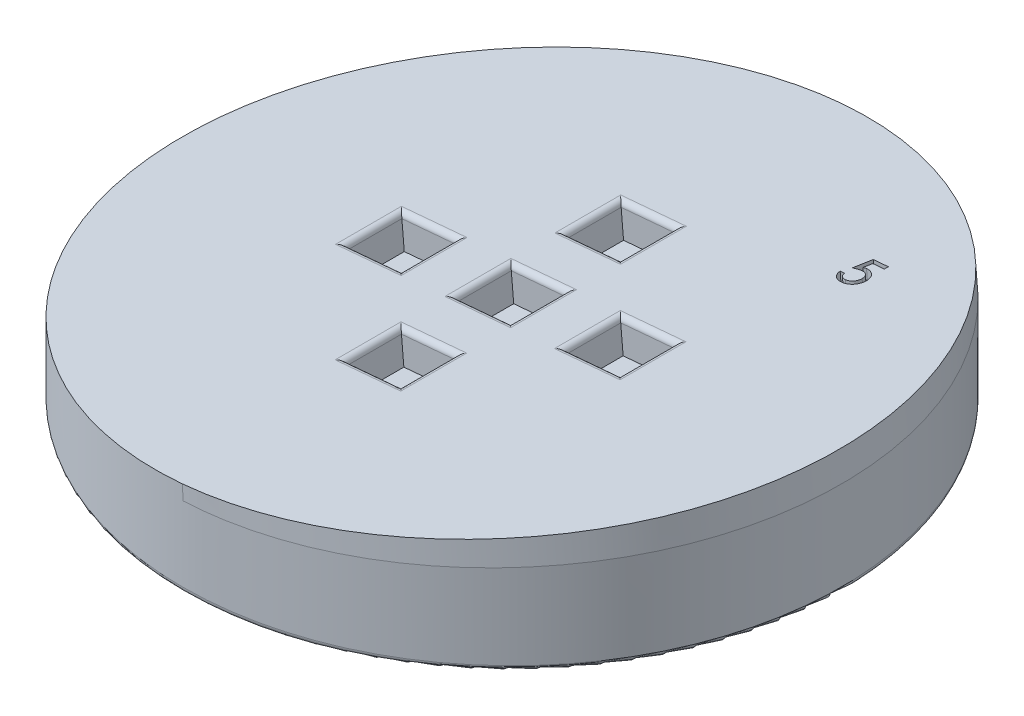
ISO-10303-21;
HEADER;
FILE_DESCRIPTION(('STEP AP214'),'2;1');
FILE_NAME('part.step','',(''),(''),'','','');
FILE_SCHEMA(('AUTOMOTIVE_DESIGN { 1 0 10303 214 1 1 1 1 }'));
ENDSEC;
DATA;
#1=APPLICATION_CONTEXT('core data for automotive mechanical design processes');
#2=APPLICATION_PROTOCOL_DEFINITION('international standard','automotive_design',2000,#1);
#3=PRODUCT_CONTEXT('',#1,'mechanical');
#4=PRODUCT('Part','Part','',(#3));
#5=PRODUCT_RELATED_PRODUCT_CATEGORY('part','',(#4));
#6=PRODUCT_DEFINITION_FORMATION('','',#4);
#7=PRODUCT_DEFINITION_CONTEXT('part definition',#1,'design');
#8=PRODUCT_DEFINITION('design','',#6,#7);
#9=PRODUCT_DEFINITION_SHAPE('','',#8);
#10=(LENGTH_UNIT() NAMED_UNIT(*) SI_UNIT(.MILLI.,.METRE.));
#11=(NAMED_UNIT(*) PLANE_ANGLE_UNIT() SI_UNIT($,.RADIAN.));
#12=(NAMED_UNIT(*) SI_UNIT($,.STERADIAN.) SOLID_ANGLE_UNIT());
#13=UNCERTAINTY_MEASURE_WITH_UNIT(LENGTH_MEASURE(1.E-05),#10,'distance_accuracy_value','');
#14=(GEOMETRIC_REPRESENTATION_CONTEXT(3) GLOBAL_UNCERTAINTY_ASSIGNED_CONTEXT((#13)) GLOBAL_UNIT_ASSIGNED_CONTEXT((#10,
#11,#12)) REPRESENTATION_CONTEXT('',''));
#15=CARTESIAN_POINT('',(0.,0.,0.));
#16=DIRECTION('',(0.,0.,1.));
#17=DIRECTION('',(1.,0.,0.));
#18=AXIS2_PLACEMENT_3D('',#15,#16,#17);
#19=CARTESIAN_POINT('',(-30.,6.,-41.5));
#20=DIRECTION('',(0.0871557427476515,-0.996194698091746,0.));
#21=DIRECTION('',(0.996194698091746,0.0871557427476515,0.));
#22=AXIS2_PLACEMENT_3D('',#19,#20,#21);
#23=PLANE('',#22);
#24=CARTESIAN_POINT('',(-0.114159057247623,8.61467228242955,0.));
#25=DIRECTION('',(-0.0871557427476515,0.996194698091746,0.));
#26=DIRECTION('',(-0.996194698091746,-0.0871557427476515,0.));
#27=AXIS2_PLACEMENT_3D('',#24,#25,#26);
#28=CIRCLE('',#27,30.);
#29=CARTESIAN_POINT('',(-0.0571883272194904,8.61965657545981,29.9999454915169));
#30=VERTEX_POINT('',#29);
#31=CARTESIAN_POINT('',(-0.0571883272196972,8.61965657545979,-29.9999454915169));
#32=VERTEX_POINT('',#31);
#33=EDGE_CURVE('E545',#30,#32,#28,.T.);
#34=ORIENTED_EDGE('',*,*,#33,.T.);
#35=CARTESIAN_POINT('',(0.,8.62465990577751,0.));
#36=DIRECTION('',(0.0871557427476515,-0.996194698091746,0.));
#37=DIRECTION('',(-0.996194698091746,-0.0871557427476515,0.));
#38=AXIS2_PLACEMENT_3D('',#35,#36,#37);
#39=ELLIPSE('',#38,30.1145951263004,30.);
#40=EDGE_CURVE('E939',#30,#32,#39,.T.);
#41=ORIENTED_EDGE('',*,*,#40,.F.);
#42=EDGE_LOOP('',(#34,#41));
#43=FACE_BOUND('',#42,.T.);
#44=DIRECTION('',(-0.996194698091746,-0.0871557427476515,0.));
#45=VECTOR('',#44,1.);
#46=CARTESIAN_POINT('',(-30.,6.,-13.));
#47=LINE('',#46,#45);
#48=CARTESIAN_POINT('',(-3.10274315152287,8.35320505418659,-13.));
#49=VERTEX_POINT('',#48);
#50=CARTESIAN_POINT('',(2.87442503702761,8.8761395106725,-13.));
#51=VERTEX_POINT('',#50);
#52=EDGE_CURVE('E946',#49,#51,#47,.F.);
#53=ORIENTED_EDGE('',*,*,#52,.T.);
#54=DIRECTION('',(0.,0.,-1.));
#55=VECTOR('',#54,1.);
#56=CARTESIAN_POINT('',(2.87442503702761,8.8761395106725,-41.5));
#57=LINE('',#56,#55);
#58=CARTESIAN_POINT('',(2.87442503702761,8.8761395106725,-7.));
#59=VERTEX_POINT('',#58);
#60=EDGE_CURVE('E948',#51,#59,#57,.F.);
#61=ORIENTED_EDGE('',*,*,#60,.T.);
#62=DIRECTION('',(0.996194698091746,0.0871557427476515,0.));
#63=VECTOR('',#62,1.);
#64=CARTESIAN_POINT('',(-30.,6.,-6.99999999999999));
#65=LINE('',#64,#63);
#66=CARTESIAN_POINT('',(-3.10274315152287,8.35320505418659,-7.));
#67=VERTEX_POINT('',#66);
#68=EDGE_CURVE('E942',#59,#67,#65,.F.);
#69=ORIENTED_EDGE('',*,*,#68,.T.);
#70=DIRECTION('',(0.,0.,1.));
#71=VECTOR('',#70,1.);
#72=CARTESIAN_POINT('',(-3.10274315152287,8.35320505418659,-41.5));
#73=LINE('',#72,#71);
#74=EDGE_CURVE('E944',#67,#49,#73,.F.);
#75=ORIENTED_EDGE('',*,*,#74,.T.);
#76=EDGE_LOOP('',(#53,#61,#69,#75));
#77=FACE_BOUND('',#76,.T.);
#78=DIRECTION('',(-0.996194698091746,-0.0871557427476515,0.));
#79=VECTOR('',#78,1.);
#80=CARTESIAN_POINT('',(-30.,6.,-3.));
#81=LINE('',#80,#79);
#82=CARTESIAN_POINT('',(6.8592038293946,9.2247624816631,-3.));
#83=VERTEX_POINT('',#82);
#84=CARTESIAN_POINT('',(12.8363720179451,9.74769693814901,-3.));
#85=VERTEX_POINT('',#84);
#86=EDGE_CURVE('E975',#83,#85,#81,.F.);
#87=ORIENTED_EDGE('',*,*,#86,.T.);
#88=DIRECTION('',(0.,0.,-1.));
#89=VECTOR('',#88,1.);
#90=CARTESIAN_POINT('',(12.8363720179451,9.74769693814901,-41.5));
#91=LINE('',#90,#89);
#92=CARTESIAN_POINT('',(12.8363720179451,9.74769693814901,3.));
#93=VERTEX_POINT('',#92);
#94=EDGE_CURVE('E977',#85,#93,#91,.F.);
#95=ORIENTED_EDGE('',*,*,#94,.T.);
#96=DIRECTION('',(0.996194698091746,0.0871557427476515,0.));
#97=VECTOR('',#96,1.);
#98=CARTESIAN_POINT('',(-30.,6.,3.00000000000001));
#99=LINE('',#98,#97);
#100=CARTESIAN_POINT('',(6.8592038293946,9.2247624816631,3.));
#101=VERTEX_POINT('',#100);
#102=EDGE_CURVE('E971',#93,#101,#99,.F.);
#103=ORIENTED_EDGE('',*,*,#102,.T.);
#104=DIRECTION('',(0.,0.,1.));
#105=VECTOR('',#104,1.);
#106=CARTESIAN_POINT('',(6.8592038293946,9.22476248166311,-41.5));
#107=LINE('',#106,#105);
#108=EDGE_CURVE('E973',#101,#83,#107,.F.);
#109=ORIENTED_EDGE('',*,*,#108,.T.);
#110=EDGE_LOOP('',(#87,#95,#103,#109));
#111=FACE_BOUND('',#110,.T.);
#112=DIRECTION('',(-0.996194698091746,-0.0871557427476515,0.));
#113=VECTOR('',#112,1.);
#114=CARTESIAN_POINT('',(-30.,6.,-3.));
#115=LINE('',#114,#113);
#116=CARTESIAN_POINT('',(-13.0646901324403,7.48164762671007,-3.));
#117=VERTEX_POINT('',#116);
#118=CARTESIAN_POINT('',(-7.08752194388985,8.00458208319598,-3.));
#119=VERTEX_POINT('',#118);
#120=EDGE_CURVE('E1003',#117,#119,#115,.F.);
#121=ORIENTED_EDGE('',*,*,#120,.T.);
#122=DIRECTION('',(0.,0.,-1.));
#123=VECTOR('',#122,1.);
#124=CARTESIAN_POINT('',(-7.08752194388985,8.00458208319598,-41.5));
#125=LINE('',#124,#123);
#126=CARTESIAN_POINT('',(-7.08752194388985,8.00458208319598,3.));
#127=VERTEX_POINT('',#126);
#128=EDGE_CURVE('E1005',#119,#127,#125,.F.);
#129=ORIENTED_EDGE('',*,*,#128,.T.);
#130=DIRECTION('',(0.996194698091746,0.0871557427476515,0.));
#131=VECTOR('',#130,1.);
#132=CARTESIAN_POINT('',(-30.,6.,3.));
#133=LINE('',#132,#131);
#134=CARTESIAN_POINT('',(-13.0646901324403,7.48164762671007,3.));
#135=VERTEX_POINT('',#134);
#136=EDGE_CURVE('E999',#127,#135,#133,.F.);
#137=ORIENTED_EDGE('',*,*,#136,.T.);
#138=DIRECTION('',(0.,0.,1.));
#139=VECTOR('',#138,1.);
#140=CARTESIAN_POINT('',(-13.0646901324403,7.48164762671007,-41.5));
#141=LINE('',#140,#139);
#142=EDGE_CURVE('E1001',#135,#117,#141,.F.);
#143=ORIENTED_EDGE('',*,*,#142,.T.);
#144=EDGE_LOOP('',(#121,#129,#137,#143));
#145=FACE_BOUND('',#144,.T.);
#146=DIRECTION('',(-0.996194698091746,-0.0871557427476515,0.));
#147=VECTOR('',#146,1.);
#148=CARTESIAN_POINT('',(-30.,6.,7.00000000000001));
#149=LINE('',#148,#147);
#150=CARTESIAN_POINT('',(-3.10274315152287,8.35320505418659,7.));
#151=VERTEX_POINT('',#150);
#152=CARTESIAN_POINT('',(2.87442503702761,8.8761395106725,7.));
#153=VERTEX_POINT('',#152);
#154=EDGE_CURVE('E1031',#151,#153,#149,.F.);
#155=ORIENTED_EDGE('',*,*,#154,.T.);
#156=DIRECTION('',(0.,0.,-1.));
#157=VECTOR('',#156,1.);
#158=CARTESIAN_POINT('',(2.87442503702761,8.8761395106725,-41.5));
#159=LINE('',#158,#157);
#160=CARTESIAN_POINT('',(2.87442503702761,8.8761395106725,13.));
#161=VERTEX_POINT('',#160);
#162=EDGE_CURVE('E1033',#153,#161,#159,.F.);
#163=ORIENTED_EDGE('',*,*,#162,.T.);
#164=DIRECTION('',(0.996194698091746,0.0871557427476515,0.));
#165=VECTOR('',#164,1.);
#166=CARTESIAN_POINT('',(-30.,6.,13.));
#167=LINE('',#166,#165);
#168=CARTESIAN_POINT('',(-3.10274315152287,8.35320505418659,13.));
#169=VERTEX_POINT('',#168);
#170=EDGE_CURVE('E1027',#161,#169,#167,.F.);
#171=ORIENTED_EDGE('',*,*,#170,.T.);
#172=DIRECTION('',(0.,0.,1.));
#173=VECTOR('',#172,1.);
#174=CARTESIAN_POINT('',(-3.10274315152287,8.35320505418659,-41.5));
#175=LINE('',#174,#173);
#176=EDGE_CURVE('E1029',#169,#151,#175,.F.);
#177=ORIENTED_EDGE('',*,*,#176,.T.);
#178=EDGE_LOOP('',(#155,#163,#171,#177));
#179=FACE_BOUND('',#178,.T.);
#180=DIRECTION('',(-0.996194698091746,-0.0871557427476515,0.));
#181=VECTOR('',#180,1.);
#182=CARTESIAN_POINT('',(-30.,6.,-3.));
#183=LINE('',#182,#181);
#184=CARTESIAN_POINT('',(-3.10274315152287,8.35320505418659,-3.));
#185=VERTEX_POINT('',#184);
#186=CARTESIAN_POINT('',(2.87442503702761,8.8761395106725,-3.));
#187=VERTEX_POINT('',#186);
#188=EDGE_CURVE('E1058',#185,#187,#183,.F.);
#189=ORIENTED_EDGE('',*,*,#188,.T.);
#190=DIRECTION('',(0.,0.,-1.));
#191=VECTOR('',#190,1.);
#192=CARTESIAN_POINT('',(2.87442503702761,8.8761395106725,-41.5));
#193=LINE('',#192,#191);
#194=CARTESIAN_POINT('',(2.87442503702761,8.8761395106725,3.));
#195=VERTEX_POINT('',#194);
#196=EDGE_CURVE('E1060',#187,#195,#193,.F.);
#197=ORIENTED_EDGE('',*,*,#196,.T.);
#198=DIRECTION('',(0.996194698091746,0.0871557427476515,0.));
#199=VECTOR('',#198,1.);
#200=CARTESIAN_POINT('',(-30.,6.,3.00000000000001));
#201=LINE('',#200,#199);
#202=CARTESIAN_POINT('',(-3.10274315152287,8.35320505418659,3.));
#203=VERTEX_POINT('',#202);
#204=EDGE_CURVE('E1054',#195,#203,#201,.F.);
#205=ORIENTED_EDGE('',*,*,#204,.T.);
#206=DIRECTION('',(0.,0.,1.));
#207=VECTOR('',#206,1.);
#208=CARTESIAN_POINT('',(-3.10274315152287,8.35320505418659,-41.5));
#209=LINE('',#208,#207);
#210=EDGE_CURVE('E1056',#203,#185,#209,.F.);
#211=ORIENTED_EDGE('',*,*,#210,.T.);
#212=EDGE_LOOP('',(#189,#197,#205,#211));
#213=FACE_BOUND('',#212,.T.);
#214=DIRECTION('',(0.996194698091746,0.0871557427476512,0.));
#215=VECTOR('',#214,1.);
#216=CARTESIAN_POINT('',(15.0755748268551,9.94360179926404,-17.8153424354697));
#217=LINE('',#216,#215);
#218=CARTESIAN_POINT('',(15.0755748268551,9.94360179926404,-17.8153424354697));
#219=VERTEX_POINT('',#218);
#220=CARTESIAN_POINT('',(16.446679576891,10.0635579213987,-17.8153424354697));
#221=VERTEX_POINT('',#220);
#222=EDGE_CURVE('E50',#219,#221,#217,.T.);
#223=ORIENTED_EDGE('',*,*,#222,.T.);
#224=DIRECTION('',(0.,0.,1.));
#225=VECTOR('',#224,1.);
#226=CARTESIAN_POINT('',(16.446679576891,10.0635579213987,-17.8153424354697));
#227=LINE('',#226,#225);
#228=CARTESIAN_POINT('',(16.446679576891,10.0635579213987,-17.4489962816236));
#229=VERTEX_POINT('',#228);
#230=EDGE_CURVE('E533',#221,#229,#227,.T.);
#231=ORIENTED_EDGE('',*,*,#230,.T.);
#232=DIRECTION('',(-0.996194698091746,-0.0871557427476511,0.));
#233=VECTOR('',#232,1.);
#234=CARTESIAN_POINT('',(16.446679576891,10.0635579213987,-17.4489962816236));
#235=LINE('',#234,#233);
#236=CARTESIAN_POINT('',(15.4075798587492,9.97264847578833,-17.4489962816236));
#237=VERTEX_POINT('',#236);
#238=EDGE_CURVE('E1872',#229,#237,#235,.T.);
#239=ORIENTED_EDGE('',*,*,#238,.T.);
#240=DIRECTION('',(-0.22010326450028,-0.0192565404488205,0.975286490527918));
#241=VECTOR('',#240,1.);
#242=CARTESIAN_POINT('',(15.4075798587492,9.97264847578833,-17.4489962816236));
#243=LINE('',#242,#241);
#244=CARTESIAN_POINT('',(15.2377757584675,9.95779254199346,-16.6965874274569));
#245=VERTEX_POINT('',#244);
#246=EDGE_CURVE('E1875',#237,#245,#243,.T.);
#247=ORIENTED_EDGE('',*,*,#246,.T.);
#248=CARTESIAN_POINT('',(15.2377757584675,9.95779254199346,-16.6965874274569));
#249=CARTESIAN_POINT('',(15.2575855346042,9.95952567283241,-16.7061708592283));
#250=CARTESIAN_POINT('',(15.2983542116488,9.96309246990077,-16.7258936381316));
#251=CARTESIAN_POINT('',(15.366513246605,9.96905561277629,-16.7430781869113));
#252=CARTESIAN_POINT('',(15.4405145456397,9.97552988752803,-16.7551692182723));
#253=CARTESIAN_POINT('',(15.4922128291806,9.9800529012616,-16.7563797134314));
#254=CARTESIAN_POINT('',(15.5190929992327,9.98240461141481,-16.7570091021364));
#255=B_SPLINE_CURVE_WITH_KNOTS('',3,(#248,#249,#250,#251,#252,#253,#254),.UNSPECIFIED.,.F.,.F.,
(4,1,1,1,4),(0.,0.226644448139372,0.466436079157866,0.722577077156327,1.),.UNSPECIFIED.);
#256=CARTESIAN_POINT('',(15.5190929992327,9.98240461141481,-16.7570091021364));
#257=VERTEX_POINT('',#256);
#258=EDGE_CURVE('E1878',#245,#257,#255,.T.);
#259=ORIENTED_EDGE('',*,*,#258,.T.);
#260=CARTESIAN_POINT('',(15.5190929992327,9.98240461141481,-16.7570091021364));
#261=CARTESIAN_POINT('',(15.5571635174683,9.98573535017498,-16.7563094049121));
#262=CARTESIAN_POINT('',(15.6319086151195,9.9922746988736,-16.7549356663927));
#263=CARTESIAN_POINT('',(15.7408436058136,10.0018052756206,-16.7395846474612));
#264=CARTESIAN_POINT('',(15.8446483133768,10.010887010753,-16.7165867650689));
#265=CARTESIAN_POINT('',(15.9424687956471,10.0194451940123,-16.6822781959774));
#266=CARTESIAN_POINT('',(16.0354221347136,10.0275775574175,-16.6400427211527));
#267=CARTESIAN_POINT('',(16.1224998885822,10.0351958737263,-16.5871911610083));
#268=CARTESIAN_POINT('',(16.2036116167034,10.0422922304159,-16.5246200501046));
#269=CARTESIAN_POINT('',(16.2786488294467,10.0488571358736,-16.4533948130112));
#270=CARTESIAN_POINT('',(16.3470386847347,10.0548404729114,-16.3758134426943));
#271=CARTESIAN_POINT('',(16.4057762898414,10.0599793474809,-16.2920331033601));
#272=CARTESIAN_POINT('',(16.4566917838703,10.0644338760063,-16.2045013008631));
#273=CARTESIAN_POINT('',(16.4970501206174,10.0679647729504,-16.1117053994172));
#274=CARTESIAN_POINT('',(16.528937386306,10.070754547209,-16.0146052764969));
#275=CARTESIAN_POINT('',(16.5516148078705,10.0727385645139,-15.9127951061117));
#276=CARTESIAN_POINT('',(16.566031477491,10.0739998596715,-15.8065799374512));
#277=CARTESIAN_POINT('',(16.5675570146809,10.0741333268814,-15.7341280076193));
#278=CARTESIAN_POINT('',(16.5683302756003,10.0742009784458,-15.6974037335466));
#279=B_SPLINE_CURVE_WITH_KNOTS('',3,(#260,#261,#262,#263,#264,#265,#266,#267,#268,#269,#270,
#271,#272,#273,#274,#275,#276,#277,#278),.UNSPECIFIED.,.F.,.F.,(4,1,1,1,1,1,1,1,1,1,1,1,1,1,1,1,
4),(0.,0.0684308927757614,0.134352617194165,0.197478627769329,0.259348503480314,
0.320372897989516,0.380701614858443,0.441942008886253,0.504021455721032,0.566203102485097,
0.627233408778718,0.687310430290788,0.747520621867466,0.808306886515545,0.870237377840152,
0.934226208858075,1.),.UNSPECIFIED.);
#280=CARTESIAN_POINT('',(16.5683302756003,10.0742009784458,-15.6974037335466));
#281=VERTEX_POINT('',#280);
#282=EDGE_CURVE('E1883',#257,#281,#279,.T.);
#283=ORIENTED_EDGE('',*,*,#282,.T.);
#284=CARTESIAN_POINT('',(16.5683302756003,10.0742009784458,-15.6974037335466));
#285=CARTESIAN_POINT('',(16.5677356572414,10.0741489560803,-15.6717416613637));
#286=CARTESIAN_POINT('',(16.5665594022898,10.0740460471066,-15.6209777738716));
#287=CARTESIAN_POINT('',(16.5604300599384,10.073509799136,-15.5454951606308));
#288=CARTESIAN_POINT('',(16.5487302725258,10.0724862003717,-15.471640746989));
#289=CARTESIAN_POINT('',(16.5331960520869,10.0711271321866,-15.3988440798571));
#290=CARTESIAN_POINT('',(16.5117911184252,10.0692544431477,-15.3277292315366));
#291=CARTESIAN_POINT('',(16.4874243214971,10.06712262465,-15.2573507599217));
#292=CARTESIAN_POINT('',(16.4574877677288,10.0645035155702,-15.1888306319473));
#293=CARTESIAN_POINT('',(16.4233103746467,10.0615133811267,-15.1221974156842));
#294=CARTESIAN_POINT('',(16.3853908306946,10.0581958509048,-15.0579387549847));
#295=CARTESIAN_POINT('',(16.3436396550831,10.0545430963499,-14.9968341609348));
#296=CARTESIAN_POINT('',(16.2979614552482,10.0505467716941,-14.9393721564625));
#297=CARTESIAN_POINT('',(16.2481941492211,10.0461926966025,-14.8860336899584));
#298=CARTESIAN_POINT('',(16.1956981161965,10.0415998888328,-14.8354469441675));
#299=CARTESIAN_POINT('',(16.1391039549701,10.0366485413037,-14.7889321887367));
#300=CARTESIAN_POINT('',(16.0785724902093,10.0313527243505,-14.7462940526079));
#301=CARTESIAN_POINT('',(16.014967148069,10.0257879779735,-14.7070664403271));
#302=CARTESIAN_POINT('',(15.9483183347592,10.0199569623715,-14.6716272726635));
#303=CARTESIAN_POINT('',(15.8782343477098,10.01382540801,-14.6422843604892));
#304=CARTESIAN_POINT('',(15.8064550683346,10.0075455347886,-14.6156236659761));
#305=CARTESIAN_POINT('',(15.7312052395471,10.0009620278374,-14.5956609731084));
#306=CARTESIAN_POINT('',(15.6539037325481,9.99419902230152,-14.5788631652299));
#307=CARTESIAN_POINT('',(15.5736228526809,9.98717535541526,-14.5677156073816));
#308=CARTESIAN_POINT('',(15.4909253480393,9.97994026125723,-14.5604476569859));
#309=CARTESIAN_POINT('',(15.4348403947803,9.97503346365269,-14.5594431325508));
#310=CARTESIAN_POINT('',(15.406312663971,9.97253761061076,-14.5589321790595));
#311=B_SPLINE_CURVE_WITH_KNOTS('',3,(#284,#285,#286,#287,#288,#289,#290,#291,#292,#293,#294,
#295,#296,#297,#298,#299,#300,#301,#302,#303,#304,#305,#306,#307,#308,#309,#310),.UNSPECIFIED.,
.F.,.F.,(4,1,1,1,1,1,1,1,1,1,1,1,1,1,1,1,1,1,1,1,1,1,1,1,4),(0.,0.0421781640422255,
0.0834354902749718,0.124332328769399,0.164992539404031,0.205670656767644,0.246330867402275,
0.287365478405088,0.328500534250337,0.369428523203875,0.41001553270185,0.450169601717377,
0.490105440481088,0.530026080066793,0.570128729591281,0.610628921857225,0.651917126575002,
0.693212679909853,0.734887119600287,0.77709405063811,0.819352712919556,0.863151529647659,
0.907494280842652,0.952946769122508,1.),.UNSPECIFIED.);
#312=CARTESIAN_POINT('',(15.406312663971,9.97253761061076,-14.5589321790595));
#313=VERTEX_POINT('',#312);
#314=EDGE_CURVE('E1891',#281,#313,#311,.T.);
#315=ORIENTED_EDGE('',*,*,#314,.T.);
#316=CARTESIAN_POINT('',(15.406312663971,9.97253761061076,-14.5589321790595));
#317=CARTESIAN_POINT('',(15.3741820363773,9.96972654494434,-14.5597065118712));
#318=CARTESIAN_POINT('',(15.3107949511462,9.96418089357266,-14.5612341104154));
#319=CARTESIAN_POINT('',(15.2176980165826,9.95603596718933,-14.5720690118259));
#320=CARTESIAN_POINT('',(15.1283867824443,9.94822224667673,-14.5904526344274));
#321=CARTESIAN_POINT('',(15.0432397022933,9.94077284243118,-14.616768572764));
#322=CARTESIAN_POINT('',(14.9616232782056,9.93363233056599,-14.6497760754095));
#323=CARTESIAN_POINT('',(14.8842333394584,9.92686158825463,-14.6906082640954));
#324=CARTESIAN_POINT('',(14.8107691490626,9.9204343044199,-14.7388986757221));
#325=CARTESIAN_POINT('',(14.7411361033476,9.91434220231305,-14.7937267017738));
#326=CARTESIAN_POINT('',(14.6776280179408,9.90878596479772,-14.8562708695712));
#327=CARTESIAN_POINT('',(14.6190875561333,9.90366433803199,-14.9236016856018));
#328=CARTESIAN_POINT('',(14.5692105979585,9.89930066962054,-14.9981980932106));
#329=CARTESIAN_POINT('',(14.5253339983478,9.89546196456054,-15.0780015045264));
#330=CARTESIAN_POINT('',(14.4876343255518,9.89216367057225,-15.1636609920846));
#331=CARTESIAN_POINT('',(14.4576423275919,9.88953971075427,-15.2553389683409));
#332=CARTESIAN_POINT('',(14.4336601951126,9.88744154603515,-15.3526882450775));
#333=CARTESIAN_POINT('',(14.424074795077,9.88660293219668,-15.419991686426));
#334=CARTESIAN_POINT('',(14.4191679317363,9.8861736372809,-15.4544449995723));
#335=B_SPLINE_CURVE_WITH_KNOTS('',3,(#316,#317,#318,#319,#320,#321,#322,#323,#324,#325,#326,
#327,#328,#329,#330,#331,#332,#333,#334),.UNSPECIFIED.,.F.,.F.,(4,1,1,1,1,1,1,1,1,1,1,1,1,1,1,1,
4),(0.,0.0655981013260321,0.129411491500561,0.191065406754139,0.251494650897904,
0.311073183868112,0.370482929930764,0.429688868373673,0.490167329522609,0.550854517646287,
0.611098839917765,0.671620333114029,0.733191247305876,0.796329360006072,0.861785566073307,
0.929246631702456,1.),.UNSPECIFIED.);
#336=CARTESIAN_POINT('',(14.4191679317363,9.8861736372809,-15.4544449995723));
#337=VERTEX_POINT('',#336);
#338=EDGE_CURVE('E1899',#313,#337,#335,.T.);
#339=ORIENTED_EDGE('',*,*,#338,.T.);
#340=DIRECTION('',(0.996194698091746,0.0871557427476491,0.));
#341=VECTOR('',#340,1.);
#342=CARTESIAN_POINT('',(14.4191679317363,9.8861736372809,-15.4544449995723));
#343=LINE('',#342,#341);
#344=CARTESIAN_POINT('',(14.8151662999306,9.92081900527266,-15.4544449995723));
#345=VERTEX_POINT('',#344);
#346=EDGE_CURVE('E1907',#337,#345,#343,.T.);
#347=ORIENTED_EDGE('',*,*,#346,.T.);
#348=CARTESIAN_POINT('',(14.8151662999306,9.92081900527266,-15.4544449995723));
#349=CARTESIAN_POINT('',(14.8227030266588,9.92147838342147,-15.4211713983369));
#350=CARTESIAN_POINT('',(14.8368512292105,9.92271619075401,-15.3587090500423));
#351=CARTESIAN_POINT('',(14.8672456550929,9.9253753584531,-15.2735998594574));
#352=CARTESIAN_POINT('',(14.8998218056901,9.92822540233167,-15.2012137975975));
#353=CARTESIAN_POINT('',(14.9396653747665,9.93171126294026,-15.1420145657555));
#354=CARTESIAN_POINT('',(14.9853956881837,9.93571214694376,-15.0934211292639));
#355=CARTESIAN_POINT('',(15.0361530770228,9.94015284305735,-15.0512406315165));
#356=CARTESIAN_POINT('',(15.0919163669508,9.94503149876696,-15.0134037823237));
#357=CARTESIAN_POINT('',(15.1533060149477,9.95040239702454,-14.9819959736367));
#358=CARTESIAN_POINT('',(15.2179868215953,9.95606123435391,-14.9565505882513));
#359=CARTESIAN_POINT('',(15.2851923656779,9.96194095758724,-14.9387914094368));
#360=CARTESIAN_POINT('',(15.3535654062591,9.96792282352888,-14.9276245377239));
#361=CARTESIAN_POINT('',(15.3997242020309,9.97196119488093,-14.9260600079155));
#362=CARTESIAN_POINT('',(15.4227861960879,9.97397885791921,-14.9252783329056));
#363=B_SPLINE_CURVE_WITH_KNOTS('',3,(#348,#349,#350,#351,#352,#353,#354,#355,#356,#357,#358,
#359,#360,#361,#362),.UNSPECIFIED.,.F.,.F.,(4,1,1,1,1,1,1,1,1,1,1,1,4),(0.,0.115454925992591,
0.216735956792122,0.305701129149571,0.383765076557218,0.45742554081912,0.53133752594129,
0.607408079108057,0.685762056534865,0.765096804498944,0.84312111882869,0.92161970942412,1.),.UNSPECIFIED.);
#364=CARTESIAN_POINT('',(15.4227861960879,9.97397885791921,-14.9252783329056));
#365=VERTEX_POINT('',#364);
#366=EDGE_CURVE('E1913',#345,#365,#363,.T.);
#367=ORIENTED_EDGE('',*,*,#366,.T.);
#368=CARTESIAN_POINT('',(15.4227861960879,9.97397885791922,-14.9252783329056));
#369=CARTESIAN_POINT('',(15.4477340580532,9.97616151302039,-14.9261190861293));
#370=CARTESIAN_POINT('',(15.4969889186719,9.98047075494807,-14.9277789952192));
#371=CARTESIAN_POINT('',(15.5695493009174,9.98681896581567,-14.9377160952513));
#372=CARTESIAN_POINT('',(15.6389439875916,9.99289021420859,-14.9560970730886));
#373=CARTESIAN_POINT('',(15.7061749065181,9.99877215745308,-14.9799221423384));
#374=CARTESIAN_POINT('',(15.7700677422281,10.0043620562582,-15.0123728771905));
#375=CARTESIAN_POINT('',(15.8321907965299,10.0097971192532,-15.0502632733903));
#376=CARTESIAN_POINT('',(15.8902787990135,10.0148791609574,-15.0967916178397));
#377=CARTESIAN_POINT('',(15.9459552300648,10.0197502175,-15.1485256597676));
#378=CARTESIAN_POINT('',(15.9969492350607,10.0242116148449,-15.2058292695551));
#379=CARTESIAN_POINT('',(16.0413523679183,10.028096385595,-15.2677432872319));
#380=CARTESIAN_POINT('',(16.0792301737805,10.0314102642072,-15.333024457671));
#381=CARTESIAN_POINT('',(16.1094155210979,10.034051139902,-15.4021069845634));
#382=CARTESIAN_POINT('',(16.1339135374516,10.0361944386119,-15.4743578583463));
#383=CARTESIAN_POINT('',(16.1507524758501,10.0376676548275,-15.5502705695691));
#384=CARTESIAN_POINT('',(16.1612582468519,10.0385867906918,-15.6296865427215));
#385=CARTESIAN_POINT('',(16.1622978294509,10.038677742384,-15.6838012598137));
#386=CARTESIAN_POINT('',(16.1628279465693,10.0387241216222,-15.7113961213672));
#387=B_SPLINE_CURVE_WITH_KNOTS('',3,(#368,#369,#370,#371,#372,#373,#374,#375,#376,#377,#378,
#379,#380,#381,#382,#383,#384,#385,#386),.UNSPECIFIED.,.F.,.F.,(4,1,1,1,1,1,1,1,1,1,1,1,1,1,1,1,
4),(0.,0.0623438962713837,0.12308629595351,0.182468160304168,0.241388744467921,
0.300854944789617,0.361037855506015,0.422681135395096,0.486149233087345,0.550432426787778,
0.613550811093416,0.675727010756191,0.738088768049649,0.800995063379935,0.865382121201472,
0.931353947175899,1.),.UNSPECIFIED.);
#388=CARTESIAN_POINT('',(16.1628279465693,10.0387241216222,-15.7113961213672));
#389=VERTEX_POINT('',#388);
#390=EDGE_CURVE('E1918',#365,#389,#387,.T.);
#391=ORIENTED_EDGE('',*,*,#390,.T.);
#392=CARTESIAN_POINT('',(16.1628279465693,10.0387241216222,-15.7113961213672));
#393=CARTESIAN_POINT('',(16.1621976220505,10.0386689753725,-15.7360170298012));
#394=CARTESIAN_POINT('',(16.1609599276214,10.038560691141,-15.7843622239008));
#395=CARTESIAN_POINT('',(16.1518935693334,10.0377674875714,-15.8550203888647));
#396=CARTESIAN_POINT('',(16.1375124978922,10.0365093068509,-15.922419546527));
#397=CARTESIAN_POINT('',(16.1166155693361,10.0346810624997,-15.9859261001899));
#398=CARTESIAN_POINT('',(16.0897533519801,10.0323309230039,-16.0458914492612));
#399=CARTESIAN_POINT('',(16.0567211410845,10.0294409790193,-16.1019319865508));
#400=CARTESIAN_POINT('',(16.0176196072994,10.0260200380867,-16.1543597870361));
#401=CARTESIAN_POINT('',(15.9736460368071,10.0221728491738,-16.2033447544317));
#402=CARTESIAN_POINT('',(15.9238669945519,10.0178177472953,-16.2471131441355));
#403=CARTESIAN_POINT('',(15.8704189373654,10.013141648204,-16.2862850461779));
#404=CARTESIAN_POINT('',(15.8116789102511,10.0080025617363,-16.3179662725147));
#405=CARTESIAN_POINT('',(15.7497653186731,10.0025858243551,-16.3450772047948));
#406=CARTESIAN_POINT('',(15.683246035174,9.99676614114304,-16.3648908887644));
#407=CARTESIAN_POINT('',(15.6133126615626,9.99064776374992,-16.380856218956));
#408=CARTESIAN_POINT('',(15.5386910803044,9.98411922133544,-16.3885266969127));
#409=CARTESIAN_POINT('',(15.487636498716,9.9796525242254,-16.3899384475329));
#410=CARTESIAN_POINT('',(15.4614356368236,9.97736024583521,-16.3906629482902));
#411=B_SPLINE_CURVE_WITH_KNOTS('',3,(#392,#393,#394,#395,#396,#397,#398,#399,#400,#401,#402,
#403,#404,#405,#406,#407,#408,#409,#410),.UNSPECIFIED.,.F.,.F.,(4,1,1,1,1,1,1,1,1,1,1,1,1,1,1,1,
4),(0.,0.0669695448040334,0.131500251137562,0.193498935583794,0.254237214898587,
0.313095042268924,0.372051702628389,0.430999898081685,0.491021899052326,0.551088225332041,
0.611433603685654,0.671322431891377,0.732820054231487,0.795581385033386,0.860520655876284,
0.928420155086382,1.),.UNSPECIFIED.);
#412=CARTESIAN_POINT('',(15.4614356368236,9.97736024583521,-16.3906629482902));
#413=VERTEX_POINT('',#412);
#414=EDGE_CURVE('E1926',#389,#413,#411,.T.);
#415=ORIENTED_EDGE('',*,*,#414,.T.);
#416=CARTESIAN_POINT('',(15.4614356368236,9.97736024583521,-16.3906629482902));
#417=CARTESIAN_POINT('',(15.4390303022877,9.97540003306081,-16.3901231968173));
#418=CARTESIAN_POINT('',(15.3919926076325,9.97128476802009,-16.3889900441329));
#419=CARTESIAN_POINT('',(15.3183869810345,9.96484511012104,-16.3807965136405));
#420=CARTESIAN_POINT('',(15.2382894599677,9.95783748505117,-16.3679092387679));
#421=CARTESIAN_POINT('',(15.1518267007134,9.95027297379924,-16.3500854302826));
#422=CARTESIAN_POINT('',(15.0589156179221,9.94214430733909,-16.3268646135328));
#423=CARTESIAN_POINT('',(14.9594433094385,9.93344160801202,-16.298726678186));
#424=CARTESIAN_POINT('',(14.8532997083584,9.92415524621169,-16.2658930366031));
#425=CARTESIAN_POINT('',(14.7808803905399,9.91781937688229,-16.2407804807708));
#426=CARTESIAN_POINT('',(14.7435697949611,9.91455512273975,-16.2278424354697));
#427=B_SPLINE_CURVE_WITH_KNOTS('',3,(#416,#417,#418,#419,#420,#421,#422,#423,#424,#425,#426),
.UNSPECIFIED.,.F.,.F.,(4,1,1,1,1,1,1,1,4),(0.,0.0909517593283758,0.190943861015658,
0.300331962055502,0.420227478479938,0.549160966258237,0.688963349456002,0.839753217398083,1.),.UNSPECIFIED.);
#428=CARTESIAN_POINT('',(14.7435697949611,9.91455512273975,-16.2278424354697));
#429=VERTEX_POINT('',#428);
#430=EDGE_CURVE('E1934',#413,#429,#427,.T.);
#431=ORIENTED_EDGE('',*,*,#430,.T.);
#432=DIRECTION('',(0.204675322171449,0.0179067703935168,-0.978666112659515));
#433=VECTOR('',#432,1.);
#434=CARTESIAN_POINT('',(14.7435697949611,9.91455512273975,-16.2278424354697));
#435=LINE('',#434,#433);
#436=EDGE_CURVE('E529',#429,#219,#435,.T.);
#437=ORIENTED_EDGE('',*,*,#436,.T.);
#438=EDGE_LOOP('',(#223,#231,#239,#247,#259,#283,#315,#339,#347,#367,#391,#415,#431,#437));
#439=FACE_BOUND('',#438,.T.);
#440=ADVANCED_FACE('F33',(#43,#77,#111,#145,#179,#213,#439),#23,.F.);
#441=CARTESIAN_POINT('',(0.,50.,0.));
#442=DIRECTION('',(0.,-1.,0.));
#443=DIRECTION('',(0.,0.,-1.));
#444=AXIS2_PLACEMENT_3D('',#441,#442,#443);
#445=CYLINDRICAL_SURFACE('',#444,30.);
#446=CARTESIAN_POINT('',(0.,8.62465990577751,-30.));
#447=VERTEX_POINT('',#446);
#448=EDGE_CURVE('E935',#32,#447,#39,.T.);
#449=ORIENTED_EDGE('',*,*,#448,.T.);
#450=CARTESIAN_POINT('',(0.,8.62465990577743,-30.));
#451=CARTESIAN_POINT('',(0.00174379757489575,8.58464394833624,-29.9999999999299));
#452=CARTESIAN_POINT('',(0.00348759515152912,8.54462799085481,-29.999999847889));
#453=CARTESIAN_POINT('',(0.438958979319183,-1.44839220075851,-29.9999239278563));
#454=CARTESIAN_POINT('',(0.872686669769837,-11.4013988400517,-29.9904465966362));
#455=CARTESIAN_POINT('',(1.74009858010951,-31.3064145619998,-29.9526376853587));
#456=CARTESIAN_POINT('',(2.17378280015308,-41.2584236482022,-29.9243079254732));
#457=CARTESIAN_POINT('',(2.95425709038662,-59.1684302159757,-29.8562141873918));
#458=CARTESIAN_POINT('',(3.30104773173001,-67.1264408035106,-29.8198783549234));
#459=CARTESIAN_POINT('',(3.99462613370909,-83.0423958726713,-29.734912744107));
#460=CARTESIAN_POINT('',(4.34141389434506,-91.0003403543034,-29.6862829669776));
#461=CARTESIAN_POINT('',(5.03498632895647,-106.916158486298,-29.5765478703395));
#462=CARTESIAN_POINT('',(5.38177100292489,-114.8740321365,-29.5154425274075));
#463=CARTESIAN_POINT('',(6.07533704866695,-130.789703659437,-29.3805223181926));
#464=CARTESIAN_POINT('',(6.42211842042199,-138.747501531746,-29.3067074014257));
#465=CARTESIAN_POINT('',(7.11567762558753,-154.663016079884,-29.1460776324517));
#466=CARTESIAN_POINT('',(7.46245545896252,-162.620732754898,-29.0592626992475));
#467=CARTESIAN_POINT('',(8.15637575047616,-178.544533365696,-28.8721805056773));
#468=CARTESIAN_POINT('',(8.50351820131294,-186.510617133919,-28.7718989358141));
#469=CARTESIAN_POINT('',(9.19779521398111,-202.442603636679,-28.5575307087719));
#470=CARTESIAN_POINT('',(9.54492977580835,-210.40850637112,-28.4434440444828));
#471=CARTESIAN_POINT('',(10.2391869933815,-226.340038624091,-28.200961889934));
#472=CARTESIAN_POINT('',(10.5863096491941,-234.305668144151,-28.0725665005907));
#473=CARTESIAN_POINT('',(11.2805389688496,-250.236560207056,-27.8008702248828));
#474=CARTESIAN_POINT('',(11.62764563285,-258.201822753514,-27.6575695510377));
#475=CARTESIAN_POINT('',(12.3218388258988,-274.131885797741,-27.3553579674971));
#476=CARTESIAN_POINT('',(12.6689253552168,-282.096686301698,-27.1964473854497));
#477=CARTESIAN_POINT('',(13.3057504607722,-296.710289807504,-26.8897825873));
#478=CARTESIAN_POINT('',(13.5954913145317,-303.359145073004,-26.7445216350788));
#479=CARTESIAN_POINT('',(14.1749597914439,-316.65655199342,-26.44196203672));
#480=CARTESIAN_POINT('',(14.4646874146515,-323.305103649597,-26.2846634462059));
#481=CARTESIAN_POINT('',(15.0441329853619,-336.601984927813,-25.9573648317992));
#482=CARTESIAN_POINT('',(15.3338509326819,-343.250314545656,-25.7873646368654));
#483=CARTESIAN_POINT('',(15.9132805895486,-356.546830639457,-25.4338884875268));
#484=CARTESIAN_POINT('',(16.2029922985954,-363.195017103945,-25.2504121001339));
#485=CARTESIAN_POINT('',(16.7824127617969,-376.491322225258,-24.8690756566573));
#486=CARTESIAN_POINT('',(17.0721215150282,-383.139440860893,-24.6712148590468));
#487=CARTESIAN_POINT('',(17.6515391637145,-396.435681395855,-24.260036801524));
#488=CARTESIAN_POINT('',(17.9412480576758,-403.083803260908,-24.0467184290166));
#489=CARTESIAN_POINT('',(18.5193630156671,-416.350150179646,-23.6043449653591));
#490=CARTESIAN_POINT('',(18.8077691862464,-422.968377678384,-23.3753634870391));
#491=CARTESIAN_POINT('',(19.3845586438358,-436.204307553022,-22.8993174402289));
#492=CARTESIAN_POINT('',(19.6729419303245,-442.822009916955,-22.6522525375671));
#493=CARTESIAN_POINT('',(20.2496608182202,-456.056320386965,-22.1382128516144));
#494=CARTESIAN_POINT('',(20.5379964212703,-462.672928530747,-21.871239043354));
#495=CARTESIAN_POINT('',(21.1145943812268,-475.904463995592,-21.3151208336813));
#496=CARTESIAN_POINT('',(21.4028567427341,-482.519391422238,-21.025978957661));
#497=CARTESIAN_POINT('',(21.9792815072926,-495.746952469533,-20.4226649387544));
#498=CARTESIAN_POINT('',(22.2674439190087,-502.359586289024,-20.1084971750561));
#499=CARTESIAN_POINT('',(22.8436409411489,-515.581921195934,-19.4514576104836));
#500=CARTESIAN_POINT('',(23.1316755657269,-522.191622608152,-19.1085924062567));
#501=CARTESIAN_POINT('',(23.563097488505,-532.091717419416,-18.56967770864));
#502=CARTESIAN_POINT('',(23.70651494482,-535.382802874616,-18.386325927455));
#503=CARTESIAN_POINT('',(23.9933287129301,-541.964488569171,-18.0104447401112));
#504=CARTESIAN_POINT('',(24.1367250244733,-545.255088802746,-17.8179152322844));
#505=CARTESIAN_POINT('',(24.4235138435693,-551.836201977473,-17.4227317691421));
#506=CARTESIAN_POINT('',(24.5669063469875,-555.126714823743,-17.2200762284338));
#507=CARTESIAN_POINT('',(24.8537043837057,-561.708039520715,-16.8034925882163));
#508=CARTESIAN_POINT('',(24.9971099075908,-564.998851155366,-16.5895610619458));
#509=CARTESIAN_POINT('',(25.2839501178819,-571.581143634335,-16.1490247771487));
#510=CARTESIAN_POINT('',(25.4273847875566,-574.872624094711,-15.9224142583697));
#511=CARTESIAN_POINT('',(25.7142985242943,-581.456603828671,-15.4547785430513));
#512=CARTESIAN_POINT('',(25.8577775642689,-584.749102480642,-15.2137445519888));
#513=CARTESIAN_POINT('',(26.1466127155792,-591.377174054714,-14.7118867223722));
#514=CARTESIAN_POINT('',(26.2919680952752,-594.712730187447,-14.450840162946));
#515=CARTESIAN_POINT('',(26.5826297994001,-601.382716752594,-13.9089358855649));
#516=CARTESIAN_POINT('',(26.7279361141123,-604.717146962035,-13.6280753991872));
#517=CARTESIAN_POINT('',(26.9457975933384,-609.716543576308,-13.1890318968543));
#518=CARTESIAN_POINT('',(27.0183868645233,-611.382292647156,-13.0397577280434));
#519=CARTESIAN_POINT('',(27.1635391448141,-614.713188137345,-12.7346267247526));
#520=CARTESIAN_POINT('',(27.2361021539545,-616.378334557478,-12.5787698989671));
#521=CARTESIAN_POINT('',(27.3811296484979,-619.706366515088,-12.2598691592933));
#522=CARTESIAN_POINT('',(27.4535941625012,-621.369252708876,-12.0968321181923));
#523=CARTESIAN_POINT('',(27.5984871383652,-624.694197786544,-11.7625128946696));
#524=CARTESIAN_POINT('',(27.6709156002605,-626.356256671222,-11.5912307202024));
#525=CARTESIAN_POINT('',(27.8156272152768,-629.677039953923,-11.2395284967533));
#526=CARTESIAN_POINT('',(27.8879104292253,-631.335765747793,-11.0591216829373));
#527=CARTESIAN_POINT('',(28.0324247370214,-634.652021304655,-10.6875128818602));
#528=CARTESIAN_POINT('',(28.1046558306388,-636.309551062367,-10.4963108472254));
#529=CARTESIAN_POINT('',(28.248926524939,-639.620216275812,-10.1015957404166));
#530=CARTESIAN_POINT('',(28.3209662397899,-641.273354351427,-9.89810474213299));
#531=CARTESIAN_POINT('',(28.4649616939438,-644.577703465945,-9.47606333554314));
#532=CARTESIAN_POINT('',(28.5369174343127,-646.228914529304,-9.25751312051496));
#533=CARTESIAN_POINT('',(28.6450256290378,-648.709737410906,-8.91498226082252));
#534=CARTESIAN_POINT('',(28.6812196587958,-649.540303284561,-8.79791208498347));
#535=CARTESIAN_POINT('',(28.7535860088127,-651.200936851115,-8.55844404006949));
#536=CARTESIAN_POINT('',(28.7897583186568,-652.031004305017,-8.43604450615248));
#537=CARTESIAN_POINT('',(28.8621034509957,-653.691150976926,-8.18511172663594));
#538=CARTESIAN_POINT('',(28.8982762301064,-654.521229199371,-8.05657186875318));
#539=CARTESIAN_POINT('',(28.9706431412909,-656.18187564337,-7.79234515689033));
#540=CARTESIAN_POINT('',(29.0068371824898,-657.012441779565,-7.65664513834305));
#541=CARTESIAN_POINT('',(29.0792655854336,-658.674499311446,-7.37680641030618));
#542=CARTESIAN_POINT('',(29.1154997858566,-659.505987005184,-7.23264559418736));
#543=CARTESIAN_POINT('',(29.1880246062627,-661.170257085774,-6.93418340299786));
#544=CARTESIAN_POINT('',(29.2243149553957,-662.003033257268,-6.77984719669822));
#545=CARTESIAN_POINT('',(29.2961186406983,-663.650755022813,-6.46246600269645));
#546=CARTESIAN_POINT('',(29.3316337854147,-664.465742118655,-6.29963861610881));
#547=CARTESIAN_POINT('',(29.3848207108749,-665.686254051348,-6.04481644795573));
#548=CARTESIAN_POINT('',(29.402540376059,-666.092877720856,-5.95808623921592));
#549=CARTESIAN_POINT('',(29.4379417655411,-666.905254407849,-5.78063862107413));
#550=CARTESIAN_POINT('',(29.4556234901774,-667.311007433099,-5.68992124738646));
#551=CARTESIAN_POINT('',(29.4909061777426,-668.120660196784,-5.50412360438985));
#552=CARTESIAN_POINT('',(29.5085072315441,-668.524562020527,-5.40905246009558));
#553=CARTESIAN_POINT('',(29.5436539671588,-669.331095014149,-5.21367119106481));
#554=CARTESIAN_POINT('',(29.5611996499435,-669.733726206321,-5.11336115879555));
#555=CARTESIAN_POINT('',(29.5961489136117,-670.535727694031,-4.90702361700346));
#556=CARTESIAN_POINT('',(29.6135527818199,-670.935104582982,-4.80102188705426));
#557=CARTESIAN_POINT('',(29.648272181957,-671.731831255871,-4.5817336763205));
#558=CARTESIAN_POINT('',(29.6655877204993,-672.129181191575,-4.4684477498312));
#559=CARTESIAN_POINT('',(29.7000092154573,-672.919071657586,-4.23361524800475));
#560=CARTESIAN_POINT('',(29.7171158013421,-673.31162663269,-4.11211782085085));
#561=CARTESIAN_POINT('',(29.7426606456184,-673.897819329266,-3.92150783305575));
#562=CARTESIAN_POINT('',(29.7511579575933,-674.092812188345,-3.85656461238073));
#563=CARTESIAN_POINT('',(29.76810513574,-674.481709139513,-3.72349612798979));
#564=CARTESIAN_POINT('',(29.7765550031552,-674.675613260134,-3.65537094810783));
#565=CARTESIAN_POINT('',(29.7933810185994,-675.061729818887,-3.51559289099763));
#566=CARTESIAN_POINT('',(29.8017572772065,-675.25394479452,-3.44394705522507));
#567=CARTESIAN_POINT('',(29.8184382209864,-675.636732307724,-3.29640076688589));
#568=CARTESIAN_POINT('',(29.8267429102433,-675.827304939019,-3.22050055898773));
#569=CARTESIAN_POINT('',(29.8432570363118,-676.206264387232,-3.06369440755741));
#570=CARTESIAN_POINT('',(29.8514665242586,-676.394652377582,-2.98279131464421));
#571=CARTESIAN_POINT('',(29.8677662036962,-676.76869079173,-2.81490153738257));
#572=CARTESIAN_POINT('',(29.8758564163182,-676.954341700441,-2.72791594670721));
#573=CARTESIAN_POINT('',(29.886926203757,-677.208366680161,-2.60246936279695));
#574=CARTESIAN_POINT('',(29.8899752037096,-677.278333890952,-2.56723122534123));
#575=CARTESIAN_POINT('',(29.8960460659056,-677.417645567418,-2.49554081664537));
#576=CARTESIAN_POINT('',(29.8990679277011,-677.486990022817,-2.45908852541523));
#577=CARTESIAN_POINT('',(29.9080900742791,-677.694026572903,-2.34770413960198));
#578=CARTESIAN_POINT('',(29.914044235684,-677.830660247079,-2.27077468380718));
#579=CARTESIAN_POINT('',(29.9257597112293,-678.099502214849,-2.1107619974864));
#580=CARTESIAN_POINT('',(29.9315217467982,-678.231727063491,-2.0277067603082));
#581=CARTESIAN_POINT('',(29.9428108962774,-678.490785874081,-1.8535675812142));
#582=CARTESIAN_POINT('',(29.9483381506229,-678.617623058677,-1.76248854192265));
#583=CARTESIAN_POINT('',(29.955933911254,-678.791927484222,-1.62592756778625));
#584=CARTESIAN_POINT('',(29.9581470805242,-678.842714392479,-1.58467983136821));
#585=CARTESIAN_POINT('',(29.9624988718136,-678.942577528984,-1.50015219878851));
#586=CARTESIAN_POINT('',(29.9646374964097,-678.99165381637,-1.45687237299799));
#587=CARTESIAN_POINT('',(29.968831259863,-679.08789059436,-1.36789715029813));
#588=CARTESIAN_POINT('',(29.9708860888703,-679.135043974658,-1.32219401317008));
#589=CARTESIAN_POINT('',(29.9748832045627,-679.226768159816,-1.22824591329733));
#590=CARTESIAN_POINT('',(29.976825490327,-679.271338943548,-1.18000092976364));
#591=CARTESIAN_POINT('',(29.9805993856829,-679.357940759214,-1.07991120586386));
#592=CARTESIAN_POINT('',(29.9824287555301,-679.399920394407,-1.02802155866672));
#593=CARTESIAN_POINT('',(29.9859051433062,-679.479695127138,-0.92106268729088));
#594=CARTESIAN_POINT('',(29.9875521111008,-679.517489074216,-0.865992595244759));
#595=CARTESIAN_POINT('',(29.9906066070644,-679.587582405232,-0.752796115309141));
#596=CARTESIAN_POINT('',(29.9920152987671,-679.619908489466,-0.694686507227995));
#597=CARTESIAN_POINT('',(29.9945431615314,-679.677916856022,-0.575275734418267));
#598=CARTESIAN_POINT('',(29.9956626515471,-679.703606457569,-0.513978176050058));
#599=CARTESIAN_POINT('',(29.9976963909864,-679.750275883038,-0.378748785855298));
#600=CARTESIAN_POINT('',(29.9985516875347,-679.769902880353,-0.304334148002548));
#601=CARTESIAN_POINT('',(29.9997033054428,-679.796329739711,-0.153265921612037));
#602=CARTESIAN_POINT('',(30.000000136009,-679.803141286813,-0.0766144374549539));
#603=CARTESIAN_POINT('',(29.9999998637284,-679.803135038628,0.076811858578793));
#604=CARTESIAN_POINT('',(29.9997018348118,-679.796295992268,0.153586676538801));
#605=CARTESIAN_POINT('',(29.9985464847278,-679.769783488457,0.30488756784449));
#606=CARTESIAN_POINT('',(29.9976885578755,-679.750096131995,0.379411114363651));
#607=CARTESIAN_POINT('',(29.9951253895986,-679.691277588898,0.549510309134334));
#608=CARTESIAN_POINT('',(29.9932306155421,-679.647797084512,0.643557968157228));
#609=CARTESIAN_POINT('',(29.9888230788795,-679.546654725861,0.823832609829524));
#610=CARTESIAN_POINT('',(29.9863078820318,-679.488937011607,0.910026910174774));
#611=CARTESIAN_POINT('',(29.9810956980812,-679.369329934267,1.06748767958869));
#612=CARTESIAN_POINT('',(29.9784348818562,-679.308270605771,1.13939993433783));
#613=CARTESIAN_POINT('',(29.9728621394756,-679.180389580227,1.27762002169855));
#614=CARTESIAN_POINT('',(29.9699506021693,-679.113576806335,1.34393622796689));
#615=CARTESIAN_POINT('',(29.9639297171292,-678.975411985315,1.47208754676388));
#616=CARTESIAN_POINT('',(29.9608197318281,-678.904045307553,1.53390669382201));
#617=CARTESIAN_POINT('',(29.9544560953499,-678.75801516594,1.6535252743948));
#618=CARTESIAN_POINT('',(29.9512024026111,-678.683350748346,1.71132353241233));
#619=CARTESIAN_POINT('',(29.9441452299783,-678.521405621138,1.8309056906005));
#620=CARTESIAN_POINT('',(29.9403261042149,-678.433765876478,1.8922001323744));
#621=CARTESIAN_POINT('',(29.9325784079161,-678.255974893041,2.01104278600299));
#622=CARTESIAN_POINT('',(29.928649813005,-678.165823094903,2.06859015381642));
#623=CARTESIAN_POINT('',(29.920700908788,-677.983414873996,2.18055307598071));
#624=CARTESIAN_POINT('',(29.9166804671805,-677.891155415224,2.23496365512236));
#625=CARTESIAN_POINT('',(29.9085702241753,-677.705044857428,2.34099304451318));
#626=CARTESIAN_POINT('',(29.9044804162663,-677.611193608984,2.39261159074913));
#627=CARTESIAN_POINT('',(29.8921200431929,-677.327552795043,2.54390294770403));
#628=CARTESIAN_POINT('',(29.8837647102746,-677.135818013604,2.63992618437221));
#629=CARTESIAN_POINT('',(29.8668507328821,-676.74768293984,2.82486604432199));
#630=CARTESIAN_POINT('',(29.8582912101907,-676.551262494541,2.91373973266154));
#631=CARTESIAN_POINT('',(29.8410663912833,-676.155994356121,3.08515199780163));
#632=CARTESIAN_POINT('',(29.8324012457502,-675.957150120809,3.16769859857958));
#633=CARTESIAN_POINT('',(29.8149863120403,-675.557519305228,3.32761952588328));
#634=CARTESIAN_POINT('',(29.8062365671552,-675.356733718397,3.4049963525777));
#635=CARTESIAN_POINT('',(29.7896225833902,-674.975482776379,3.5472436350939));
#636=CARTESIAN_POINT('',(29.7817655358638,-674.795182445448,3.61255901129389));
#637=CARTESIAN_POINT('',(29.7660053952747,-674.433525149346,3.74019401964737));
#638=CARTESIAN_POINT('',(29.7581023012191,-674.252168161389,3.80251358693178));
#639=CARTESIAN_POINT('',(29.7343337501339,-673.706737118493,3.98554674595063));
#640=CARTESIAN_POINT('',(29.718410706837,-673.341341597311,4.10232058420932));
#641=CARTESIAN_POINT('',(29.6864327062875,-672.607523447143,4.32766037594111));
#642=CARTESIAN_POINT('',(29.6703776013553,-672.239097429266,4.43621516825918));
#643=CARTESIAN_POINT('',(29.6381820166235,-671.500286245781,4.64644722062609));
#644=CARTESIAN_POINT('',(29.6220415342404,-671.129901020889,4.7481242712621));
#645=CARTESIAN_POINT('',(29.5896710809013,-670.387077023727,4.94584752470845));
#646=CARTESIAN_POINT('',(29.5734410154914,-670.014636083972,5.04188553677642));
#647=CARTESIAN_POINT('',(29.5409269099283,-669.268515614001,5.22902020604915));
#648=CARTESIAN_POINT('',(29.5246428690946,-668.894836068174,5.3201168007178));
#649=CARTESIAN_POINT('',(29.4920267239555,-668.146374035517,5.49804894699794));
#650=CARTESIAN_POINT('',(29.4756946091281,-667.771591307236,5.58488347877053));
#651=CARTESIAN_POINT('',(29.4429932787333,-667.021174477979,5.75479101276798));
#652=CARTESIAN_POINT('',(29.4266240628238,-666.645540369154,5.83786398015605));
#653=CARTESIAN_POINT('',(29.3775018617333,-665.518304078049,6.08193958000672));
#654=CARTESIAN_POINT('',(29.3447020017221,-664.76562623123,6.23797327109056));
#655=CARTESIAN_POINT('',(29.2790462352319,-663.258984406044,6.53919945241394));
#656=CARTESIAN_POINT('',(29.2461904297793,-662.505022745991,6.68440365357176));
#657=CARTESIAN_POINT('',(29.1804278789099,-660.995930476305,6.96588106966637));
#658=CARTESIAN_POINT('',(29.1475211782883,-660.240800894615,7.10215982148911));
#659=CARTESIAN_POINT('',(29.0816585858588,-658.729412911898,7.36720865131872));
#660=CARTESIAN_POINT('',(29.0487027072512,-657.973154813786,7.49598046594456));
#661=CARTESIAN_POINT('',(28.9829726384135,-656.464807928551,7.74621942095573));
#662=CARTESIAN_POINT('',(28.9501987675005,-655.712726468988,7.86773091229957));
#663=CARTESIAN_POINT('',(28.8846128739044,-654.207688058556,8.10520126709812));
#664=CARTESIAN_POINT('',(28.8518008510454,-653.454731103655,8.2211601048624));
#665=CARTESIAN_POINT('',(28.7533152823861,-651.194724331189,8.56170957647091));
#666=CARTESIAN_POINT('',(28.6875936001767,-649.686569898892,8.77896803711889));
#667=CARTESIAN_POINT('',(28.5560138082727,-646.667130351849,9.19794523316));
#668=CARTESIAN_POINT('',(28.4901556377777,-645.155843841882,9.39965381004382));
#669=CARTESIAN_POINT('',(28.35836611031,-642.131591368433,9.79007196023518));
#670=CARTESIAN_POINT('',(28.2924347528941,-640.618625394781,9.97878145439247));
#671=CARTESIAN_POINT('',(28.1604820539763,-637.590628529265,10.3452974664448));
#672=CARTESIAN_POINT('',(28.0944606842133,-636.075596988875,10.5230985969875));
#673=CARTESIAN_POINT('',(27.9623708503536,-633.044453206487,10.869228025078));
#674=CARTESIAN_POINT('',(27.8963023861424,-631.528340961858,11.0375562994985));
#675=CARTESIAN_POINT('',(27.7641214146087,-628.495105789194,11.3659528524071));
#676=CARTESIAN_POINT('',(27.6980089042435,-626.977982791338,11.5260204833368));
#677=CARTESIAN_POINT('',(27.5657510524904,-623.94298340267,11.8388427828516));
#678=CARTESIAN_POINT('',(27.4996057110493,-622.425107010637,11.9915974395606));
#679=CARTESIAN_POINT('',(27.3673322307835,-619.389748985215,12.2904766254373));
#680=CARTESIAN_POINT('',(27.3012041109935,-617.872267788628,12.43660560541));
#681=CARTESIAN_POINT('',(27.1689237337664,-614.836751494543,12.7229884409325));
#682=CARTESIAN_POINT('',(27.1027714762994,-613.318716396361,12.8632422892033));
#683=CARTESIAN_POINT('',(26.9043275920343,-608.764906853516,13.2759371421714));
#684=CARTESIAN_POINT('',(26.7720044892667,-605.728410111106,13.5404109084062));
#685=CARTESIAN_POINT('',(26.5073191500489,-599.654518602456,14.0515022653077));
#686=CARTESIAN_POINT('',(26.3749569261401,-596.617124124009,14.2981233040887));
#687=CARTESIAN_POINT('',(26.1101899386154,-590.54135898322,14.7760810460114));
#688=CARTESIAN_POINT('',(25.97778517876,-587.502988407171,15.0074188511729));
#689=CARTESIAN_POINT('',(25.6690160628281,-580.417480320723,15.5313345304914));
#690=CARTESIAN_POINT('',(25.4926352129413,-576.369964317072,15.8187789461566));
#691=CARTESIAN_POINT('',(25.1398137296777,-568.273560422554,16.3736908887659));
#692=CARTESIAN_POINT('',(24.9633730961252,-564.224672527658,16.6411583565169));
#693=CARTESIAN_POINT('',(24.6104208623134,-556.125268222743,17.1588261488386));
#694=CARTESIAN_POINT('',(24.4339092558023,-552.074751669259,17.4090242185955));
#695=CARTESIAN_POINT('',(24.0808467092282,-543.972815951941,17.8942115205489));
#696=CARTESIAN_POINT('',(23.9042957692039,-539.921396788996,18.1292007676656));
#697=CARTESIAN_POINT('',(23.5511373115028,-531.817260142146,18.5856718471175));
#698=CARTESIAN_POINT('',(23.3745297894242,-527.764542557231,18.8071518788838));
#699=CARTESIAN_POINT('',(23.0212866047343,-519.658461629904,19.2379295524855));
#700=CARTESIAN_POINT('',(22.8446509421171,-515.605098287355,19.4472271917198));
#701=CARTESIAN_POINT('',(22.4913383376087,-507.497424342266,19.8547839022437));
#702=CARTESIAN_POINT('',(22.3146613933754,-503.44311368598,20.0530419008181));
#703=CARTESIAN_POINT('',(21.9612864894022,-495.334010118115,20.4394319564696));
#704=CARTESIAN_POINT('',(21.7845885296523,-491.279217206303,20.6275640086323));
#705=CARTESIAN_POINT('',(21.2544515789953,-479.113850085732,21.1780135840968));
#706=CARTESIAN_POINT('',(20.9009850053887,-471.002642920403,21.5263668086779));
#707=CARTESIAN_POINT('',(20.1940010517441,-454.779062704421,22.1909309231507));
#708=CARTESIAN_POINT('',(19.8404836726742,-446.666689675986,22.5071423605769));
#709=CARTESIAN_POINT('',(19.1333331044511,-430.439286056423,23.1112925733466));
#710=CARTESIAN_POINT('',(18.7796999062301,-422.324255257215,23.3992257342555));
#711=CARTESIAN_POINT('',(18.0724230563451,-406.093953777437,23.9497027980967));
#712=CARTESIAN_POINT('',(17.7187794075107,-397.978683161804,24.212248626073));
#713=CARTESIAN_POINT('',(17.0114799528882,-381.747862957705,24.7143196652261));
#714=CARTESIAN_POINT('',(16.6578241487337,-373.632313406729,24.9538460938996));
#715=CARTESIAN_POINT('',(15.9504981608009,-357.400884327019,25.411790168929));
#716=CARTESIAN_POINT('',(15.5968279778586,-349.285004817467,25.6302084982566));
#717=CARTESIAN_POINT('',(14.8894705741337,-333.052854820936,26.0475004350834));
#718=CARTESIAN_POINT('',(14.5357833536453,-324.936584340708,26.2463743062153));
#719=CARTESIAN_POINT('',(13.828388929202,-308.70358480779,26.6258653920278));
#720=CARTESIAN_POINT('',(13.4746817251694,-300.586855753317,26.8064825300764));
#721=CARTESIAN_POINT('',(12.5768516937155,-279.983817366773,27.2431483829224));
#722=CARTESIAN_POINT('',(12.032718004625,-267.497258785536,27.4874667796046));
#723=CARTESIAN_POINT('',(10.9444076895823,-242.523156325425,27.93862540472));
#724=CARTESIAN_POINT('',(10.4002310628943,-230.035612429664,28.1454646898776));
#725=CARTESIAN_POINT('',(9.31184694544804,-205.059816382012,28.5240507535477));
#726=CARTESIAN_POINT('',(8.76763945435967,-192.571564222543,28.6957970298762));
#727=CARTESIAN_POINT('',(7.67920548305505,-167.594624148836,29.0060338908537));
#728=CARTESIAN_POINT('',(7.13497900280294,-155.105936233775,29.1445244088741));
#729=CARTESIAN_POINT('',(6.04657503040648,-130.129684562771,29.3896248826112));
#730=CARTESIAN_POINT('',(5.50239753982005,-117.642120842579,29.4962385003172));
#731=CARTESIAN_POINT('',(4.41403711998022,-92.6668685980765,29.6786237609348));
#732=CARTESIAN_POINT('',(3.86985419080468,-80.1791800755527,29.7543956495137));
#733=CARTESIAN_POINT('',(2.78148429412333,-55.2037103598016,29.8757954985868));
#734=CARTESIAN_POINT('',(2.23729732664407,-42.7159291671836,29.921423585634));
#735=CARTESIAN_POINT('',(1.14892051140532,-17.7403006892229,29.9829462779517));
#736=CARTESIAN_POINT('',(0.60473066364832,-5.25245340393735,29.9988409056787));
#737=CARTESIAN_POINT('',(0.0421044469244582,7.65846418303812,29.9999761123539));
#738=CARTESIAN_POINT('',(0.0236679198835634,8.08153810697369,29.9999963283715));
#739=CARTESIAN_POINT('',(0.00348759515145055,8.5446279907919,29.9999998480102));
#740=CARTESIAN_POINT('',(0.00174379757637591,8.58464394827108,30.0000000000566));
#741=CARTESIAN_POINT('',(0.,8.62465990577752,30.));
#742=B_SPLINE_CURVE_WITH_KNOTS('',3,(#450,#451,#452,#453,#454,#455,#456,#457,#458,#459,#460,
#461,#462,#463,#464,#465,#466,#467,#468,#469,#470,#471,#472,#473,#474,#475,#476,#477,#478,#479,
#480,#481,#482,#483,#484,#485,#486,#487,#488,#489,#490,#491,#492,#493,#494,#495,#496,#497,#498,
#499,#500,#501,#502,#503,#504,#505,#506,#507,#508,#509,#510,#511,#512,#513,#514,#515,#516,#517,
#518,#519,#520,#521,#522,#523,#524,#525,#526,#527,#528,#529,#530,#531,#532,#533,#534,#535,#536,
#537,#538,#539,#540,#541,#542,#543,#544,#545,#546,#547,#548,#549,#550,#551,#552,#553,#554,#555,
#556,#557,#558,#559,#560,#561,#562,#563,#564,#565,#566,#567,#568,#569,#570,#571,#572,#573,#574,
#575,#576,#577,#578,#579,#580,#581,#582,#583,#584,#585,#586,#587,#588,#589,#590,#591,#592,#593,
#594,#595,#596,#597,#598,#599,#600,#601,#602,#603,#604,#605,#606,#607,#608,#609,#610,#611,#612,
#613,#614,#615,#616,#617,#618,#619,#620,#621,#622,#623,#624,#625,#626,#627,#628,#629,#630,#631,
#632,#633,#634,#635,#636,#637,#638,#639,#640,#641,#642,#643,#644,#645,#646,#647,#648,#649,#650,
#651,#652,#653,#654,#655,#656,#657,#658,#659,#660,#661,#662,#663,#664,#665,#666,#667,#668,#669,
#670,#671,#672,#673,#674,#675,#676,#677,#678,#679,#680,#681,#682,#683,#684,#685,#686,#687,#688,
#689,#690,#691,#692,#693,#694,#695,#696,#697,#698,#699,#700,#701,#702,#703,#704,#705,#706,#707,
#708,#709,#710,#711,#712,#713,#714,#715,#716,#717,#718,#719,#720,#721,#722,#723,#724,#725,#726,
#727,#728,#729,#730,#731,#732,#733,#734,#735,#736,#737,#738,#739,#740,#741),.UNSPECIFIED.,.F.,
.F.,(4,2,2,2,2,2,2,2,2,2,2,2,2,2,2,2,2,2,2,2,2,2,2,2,2,2,2,2,2,2,2,2,2,2,2,2,2,2,2,2,2,2,2,2,2,
2,2,2,2,2,2,2,2,2,2,2,2,2,2,2,2,2,2,2,2,2,2,2,2,2,2,2,2,2,2,2,2,2,2,2,2,2,2,2,2,2,2,2,2,2,2,2,2,
2,2,2,2,2,2,2,2,2,2,2,2,2,2,2,2,2,2,2,2,2,2,2,2,2,2,2,2,2,2,2,2,2,2,2,2,2,2,2,2,2,2,2,2,2,2,2,2,
2,2,2,2,4),(0.,0.12016180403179,30.0075122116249,59.8919774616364,83.7889064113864,
107.685832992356,131.582804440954,155.479870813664,179.377086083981,203.299898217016,
227.222722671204,251.145378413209,275.067693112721,298.98950579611,318.959747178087,
338.929896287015,358.900314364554,378.871374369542,398.843464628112,418.816993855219,
438.702365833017,458.588105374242,478.472871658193,498.355376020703,518.234408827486,
538.108884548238,548.006796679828,557.904818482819,567.804394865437,577.706997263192,
587.614135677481,597.527377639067,607.574065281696,617.622159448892,622.644145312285,
627.666124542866,632.683397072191,637.700664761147,642.710852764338,647.721062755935,
652.72252648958,657.7239260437,660.242581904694,662.762030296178,665.284255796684,
667.811292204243,670.345253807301,672.888391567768,675.383836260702,676.632263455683,
677.880679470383,679.126589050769,680.372476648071,681.613132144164,682.853693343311,
684.087393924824,684.704468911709,685.321527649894,685.937398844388,686.553234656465,
687.168722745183,687.784100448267,688.019287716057,688.254478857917,688.725066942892,
689.193623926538,689.661896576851,689.858247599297,690.054591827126,690.251606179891,
690.448622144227,690.648758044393,690.848948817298,691.048131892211,691.247094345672,
691.476984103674,691.706664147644,691.9367020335,692.166989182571,692.47612093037,
692.786485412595,693.069193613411,693.351470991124,693.634706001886,693.91802347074,
694.238951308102,694.559951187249,694.881446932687,695.202973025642,695.846521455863,
696.493683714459,697.140011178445,697.786023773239,698.361775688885,698.937540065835,
700.089192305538,701.242381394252,702.395605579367,703.550465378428,704.705339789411,
705.860489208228,707.015649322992,709.323682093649,711.629181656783,713.933237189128,
716.236757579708,718.524350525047,720.811954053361,725.387256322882,729.965522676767,
734.543816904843,739.124354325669,743.704902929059,748.285810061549,752.866724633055,
757.444514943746,762.022310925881,771.174831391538,780.32557937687,789.475666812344,
801.660230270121,813.844829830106,826.031017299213,838.217192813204,850.404989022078,
862.592787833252,874.781768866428,886.970755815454,911.349798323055,935.728425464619,
960.111883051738,984.493490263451,1008.87380722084,1033.25333506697,1057.63253401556,
1082.0118352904,1119.51415997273,1157.01742838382,1194.52123343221,1232.0251136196,
1269.52468373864,1307.0239551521,1344.52306913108,1382.02215478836,1383.29258112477,
1383.4127429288),.UNSPECIFIED.);
#743=CARTESIAN_POINT('',(0.0571883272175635,7.31232543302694,-29.9999454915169));
#744=VERTEX_POINT('',#743);
#745=EDGE_CURVE('E567',#447,#744,#742,.T.);
#746=ORIENTED_EDGE('',*,*,#745,.T.);
#747=CARTESIAN_POINT('',(-2.8796409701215E-13,7.30982828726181,0.));
#748=DIRECTION('',(0.0436193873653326,-0.999048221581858,0.));
#749=DIRECTION('',(-0.999048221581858,-0.0436193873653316,0.));
#750=AXIS2_PLACEMENT_3D('',#747,#748,#749);
#751=ELLIPSE('',#750,30.0285805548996,30.);
#752=CARTESIAN_POINT('',(0.0571883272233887,7.31232543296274,29.9999454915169));
#753=VERTEX_POINT('',#752);
#754=EDGE_CURVE('E571',#753,#744,#751,.F.);
#755=ORIENTED_EDGE('',*,*,#754,.F.);
#756=CARTESIAN_POINT('',(0.,8.62465990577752,30.));
#757=VERTEX_POINT('',#756);
#758=EDGE_CURVE('E559',#753,#757,#742,.T.);
#759=ORIENTED_EDGE('',*,*,#758,.T.);
#760=CARTESIAN_POINT('',(0.,8.62465990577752,0.));
#761=DIRECTION('',(-0.0871557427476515,0.996194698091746,0.));
#762=DIRECTION('',(-0.996194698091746,-0.0871557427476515,0.));
#763=AXIS2_PLACEMENT_3D('',#760,#761,#762);
#764=ELLIPSE('',#763,30.1145951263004,30.);
#765=EDGE_CURVE('E1405',#30,#757,#764,.T.);
#766=ORIENTED_EDGE('',*,*,#765,.F.);
#767=ORIENTED_EDGE('',*,*,#40,.T.);
#768=EDGE_LOOP('',(#449,#746,#755,#759,#766,#767));
#769=FACE_BOUND('',#768,.T.);
#770=CARTESIAN_POINT('',(0.,0.5,0.));
#771=DIRECTION('',(0.,1.,0.));
#772=DIRECTION('',(0.,0.,1.));
#773=AXIS2_PLACEMENT_3D('',#770,#771,#772);
#774=CIRCLE('',#773,30.);
#775=CARTESIAN_POINT('',(0.,0.5,30.));
#776=VERTEX_POINT('',#775);
#777=EDGE_CURVE('E867',#776,#776,#774,.T.);
#778=ORIENTED_EDGE('',*,*,#777,.T.);
#779=EDGE_LOOP('',(#778));
#780=FACE_BOUND('',#779,.T.);
#781=ADVANCED_FACE('F573',(#769,#780),#445,.T.);
#782=CARTESIAN_POINT('',(0.,0.,0.));
#783=DIRECTION('',(0.,1.,0.));
#784=DIRECTION('',(0.,0.,1.));
#785=AXIS2_PLACEMENT_3D('',#782,#783,#784);
#786=PLANE('',#785);
#787=CARTESIAN_POINT('',(0.,0.,0.));
#788=DIRECTION('',(0.,1.,0.));
#789=DIRECTION('',(0.,0.,1.));
#790=AXIS2_PLACEMENT_3D('',#787,#788,#789);
#791=CIRCLE('',#790,29.5);
#792=CARTESIAN_POINT('',(0.,0.,29.5));
#793=VERTEX_POINT('',#792);
#794=EDGE_CURVE('E1282',#793,#793,#791,.F.);
#795=ORIENTED_EDGE('',*,*,#794,.T.);
#796=EDGE_LOOP('',(#795));
#797=FACE_BOUND('',#796,.T.);
#798=DIRECTION('',(-1.,0.,0.));
#799=VECTOR('',#798,1.);
#800=CARTESIAN_POINT('',(0.,0.,3.));
#801=LINE('',#800,#799);
#802=CARTESIAN_POINT('',(-3.,0.,3.));
#803=VERTEX_POINT('',#802);
#804=CARTESIAN_POINT('',(3.,0.,3.));
#805=VERTEX_POINT('',#804);
#806=EDGE_CURVE('E885',#803,#805,#801,.F.);
#807=ORIENTED_EDGE('',*,*,#806,.T.);
#808=DIRECTION('',(0.,0.,1.));
#809=VECTOR('',#808,1.);
#810=CARTESIAN_POINT('',(3.,0.,0.));
#811=LINE('',#810,#809);
#812=CARTESIAN_POINT('',(3.,0.,-3.));
#813=VERTEX_POINT('',#812);
#814=EDGE_CURVE('E1279',#805,#813,#811,.F.);
#815=ORIENTED_EDGE('',*,*,#814,.T.);
#816=DIRECTION('',(1.,0.,0.));
#817=VECTOR('',#816,1.);
#818=CARTESIAN_POINT('',(0.,0.,-3.));
#819=LINE('',#818,#817);
#820=CARTESIAN_POINT('',(-3.,0.,-3.));
#821=VERTEX_POINT('',#820);
#822=EDGE_CURVE('E1274',#813,#821,#819,.F.);
#823=ORIENTED_EDGE('',*,*,#822,.T.);
#824=DIRECTION('',(0.,0.,-1.));
#825=VECTOR('',#824,1.);
#826=CARTESIAN_POINT('',(-3.,0.,0.));
#827=LINE('',#826,#825);
#828=EDGE_CURVE('E1276',#821,#803,#827,.F.);
#829=ORIENTED_EDGE('',*,*,#828,.T.);
#830=EDGE_LOOP('',(#807,#815,#823,#829));
#831=FACE_BOUND('',#830,.T.);
#832=DIRECTION('',(-1.,0.,0.));
#833=VECTOR('',#832,1.);
#834=CARTESIAN_POINT('',(0.,0.,13.));
#835=LINE('',#834,#833);
#836=CARTESIAN_POINT('',(-3.,0.,13.));
#837=VERTEX_POINT('',#836);
#838=CARTESIAN_POINT('',(3.,0.,13.));
#839=VERTEX_POINT('',#838);
#840=EDGE_CURVE('E1269',#837,#839,#835,.F.);
#841=ORIENTED_EDGE('',*,*,#840,.T.);
#842=DIRECTION('',(0.,0.,1.));
#843=VECTOR('',#842,1.);
#844=CARTESIAN_POINT('',(3.,0.,0.));
#845=LINE('',#844,#843);
#846=CARTESIAN_POINT('',(3.,0.,7.));
#847=VERTEX_POINT('',#846);
#848=EDGE_CURVE('E1271',#839,#847,#845,.F.);
#849=ORIENTED_EDGE('',*,*,#848,.T.);
#850=DIRECTION('',(1.,0.,0.));
#851=VECTOR('',#850,1.);
#852=CARTESIAN_POINT('',(0.,0.,7.));
#853=LINE('',#852,#851);
#854=CARTESIAN_POINT('',(-3.,0.,7.));
#855=VERTEX_POINT('',#854);
#856=EDGE_CURVE('E1265',#847,#855,#853,.F.);
#857=ORIENTED_EDGE('',*,*,#856,.T.);
#858=DIRECTION('',(0.,0.,-1.));
#859=VECTOR('',#858,1.);
#860=CARTESIAN_POINT('',(-3.,0.,0.));
#861=LINE('',#860,#859);
#862=EDGE_CURVE('E1267',#855,#837,#861,.F.);
#863=ORIENTED_EDGE('',*,*,#862,.T.);
#864=EDGE_LOOP('',(#841,#849,#857,#863));
#865=FACE_BOUND('',#864,.T.);
#866=DIRECTION('',(-1.,0.,0.));
#867=VECTOR('',#866,1.);
#868=CARTESIAN_POINT('',(0.,0.,3.));
#869=LINE('',#868,#867);
#870=CARTESIAN_POINT('',(-13.,0.,3.));
#871=VERTEX_POINT('',#870);
#872=CARTESIAN_POINT('',(-7.,0.,3.));
#873=VERTEX_POINT('',#872);
#874=EDGE_CURVE('E1260',#871,#873,#869,.F.);
#875=ORIENTED_EDGE('',*,*,#874,.T.);
#876=DIRECTION('',(0.,0.,1.));
#877=VECTOR('',#876,1.);
#878=CARTESIAN_POINT('',(-7.,0.,0.));
#879=LINE('',#878,#877);
#880=CARTESIAN_POINT('',(-7.,0.,-3.));
#881=VERTEX_POINT('',#880);
#882=EDGE_CURVE('E1262',#873,#881,#879,.F.);
#883=ORIENTED_EDGE('',*,*,#882,.T.);
#884=DIRECTION('',(1.,0.,0.));
#885=VECTOR('',#884,1.);
#886=CARTESIAN_POINT('',(0.,0.,-3.));
#887=LINE('',#886,#885);
#888=CARTESIAN_POINT('',(-13.,0.,-3.));
#889=VERTEX_POINT('',#888);
#890=EDGE_CURVE('E1256',#881,#889,#887,.F.);
#891=ORIENTED_EDGE('',*,*,#890,.T.);
#892=DIRECTION('',(0.,0.,-1.));
#893=VECTOR('',#892,1.);
#894=CARTESIAN_POINT('',(-13.,0.,0.));
#895=LINE('',#894,#893);
#896=EDGE_CURVE('E1258',#889,#871,#895,.F.);
#897=ORIENTED_EDGE('',*,*,#896,.T.);
#898=EDGE_LOOP('',(#875,#883,#891,#897));
#899=FACE_BOUND('',#898,.T.);
#900=DIRECTION('',(-1.,0.,0.));
#901=VECTOR('',#900,1.);
#902=CARTESIAN_POINT('',(0.,0.,3.));
#903=LINE('',#902,#901);
#904=CARTESIAN_POINT('',(7.,0.,3.));
#905=VERTEX_POINT('',#904);
#906=CARTESIAN_POINT('',(13.,0.,3.));
#907=VERTEX_POINT('',#906);
#908=EDGE_CURVE('E1251',#905,#907,#903,.F.);
#909=ORIENTED_EDGE('',*,*,#908,.T.);
#910=DIRECTION('',(0.,0.,1.));
#911=VECTOR('',#910,1.);
#912=CARTESIAN_POINT('',(13.,0.,0.));
#913=LINE('',#912,#911);
#914=CARTESIAN_POINT('',(13.,0.,-2.99999999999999));
#915=VERTEX_POINT('',#914);
#916=EDGE_CURVE('E1253',#907,#915,#913,.F.);
#917=ORIENTED_EDGE('',*,*,#916,.T.);
#918=DIRECTION('',(1.,0.,0.));
#919=VECTOR('',#918,1.);
#920=CARTESIAN_POINT('',(0.,0.,-2.99999999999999));
#921=LINE('',#920,#919);
#922=CARTESIAN_POINT('',(7.,0.,-2.99999999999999));
#923=VERTEX_POINT('',#922);
#924=EDGE_CURVE('E1247',#915,#923,#921,.F.);
#925=ORIENTED_EDGE('',*,*,#924,.T.);
#926=DIRECTION('',(0.,0.,-1.));
#927=VECTOR('',#926,1.);
#928=CARTESIAN_POINT('',(7.,0.,0.));
#929=LINE('',#928,#927);
#930=EDGE_CURVE('E1249',#923,#905,#929,.F.);
#931=ORIENTED_EDGE('',*,*,#930,.T.);
#932=EDGE_LOOP('',(#909,#917,#925,#931));
#933=FACE_BOUND('',#932,.T.);
#934=DIRECTION('',(1.,0.,0.));
#935=VECTOR('',#934,1.);
#936=CARTESIAN_POINT('',(0.,0.,-13.));
#937=LINE('',#936,#935);
#938=CARTESIAN_POINT('',(3.,0.,-13.));
#939=VERTEX_POINT('',#938);
#940=CARTESIAN_POINT('',(-3.,0.,-13.));
#941=VERTEX_POINT('',#940);
#942=EDGE_CURVE('E1242',#939,#941,#937,.F.);
#943=ORIENTED_EDGE('',*,*,#942,.T.);
#944=DIRECTION('',(0.,0.,-1.));
#945=VECTOR('',#944,1.);
#946=CARTESIAN_POINT('',(-3.,0.,0.));
#947=LINE('',#946,#945);
#948=CARTESIAN_POINT('',(-3.,0.,-7.));
#949=VERTEX_POINT('',#948);
#950=EDGE_CURVE('E1244',#941,#949,#947,.F.);
#951=ORIENTED_EDGE('',*,*,#950,.T.);
#952=DIRECTION('',(-1.,0.,0.));
#953=VECTOR('',#952,1.);
#954=CARTESIAN_POINT('',(0.,0.,-7.));
#955=LINE('',#954,#953);
#956=CARTESIAN_POINT('',(3.,0.,-7.));
#957=VERTEX_POINT('',#956);
#958=EDGE_CURVE('E1238',#949,#957,#955,.F.);
#959=ORIENTED_EDGE('',*,*,#958,.T.);
#960=DIRECTION('',(0.,0.,1.));
#961=VECTOR('',#960,1.);
#962=CARTESIAN_POINT('',(3.,0.,0.));
#963=LINE('',#962,#961);
#964=EDGE_CURVE('E1240',#957,#939,#963,.F.);
#965=ORIENTED_EDGE('',*,*,#964,.T.);
#966=EDGE_LOOP('',(#943,#951,#959,#965));
#967=FACE_BOUND('',#966,.T.);
#968=ADVANCED_FACE('F578',(#797,#831,#865,#899,#933,#967),#786,.F.);
#969=CARTESIAN_POINT('',(-2.5,3.,-2.5));
#970=DIRECTION('',(-1.,0.,0.));
#971=DIRECTION('',(0.,0.,1.));
#972=AXIS2_PLACEMENT_3D('',#969,#970,#971);
#973=PLANE('',#972);
#974=DIRECTION('',(0.,-1.,0.));
#975=VECTOR('',#974,1.);
#976=CARTESIAN_POINT('',(-2.5,3.,2.5));
#977=LINE('',#976,#975);
#978=CARTESIAN_POINT('',(-2.5,3.,2.5));
#979=VERTEX_POINT('',#978);
#980=CARTESIAN_POINT('',(-2.5,0.5,2.5));
#981=VERTEX_POINT('',#980);
#982=EDGE_CURVE('E859',#979,#981,#977,.T.);
#983=ORIENTED_EDGE('',*,*,#982,.T.);
#984=DIRECTION('',(0.,0.,-1.));
#985=VECTOR('',#984,1.);
#986=CARTESIAN_POINT('',(-2.5,0.5,-2.5));
#987=LINE('',#986,#985);
#988=CARTESIAN_POINT('',(-2.5,0.5,-2.5));
#989=VERTEX_POINT('',#988);
#990=EDGE_CURVE('E861',#981,#989,#987,.T.);
#991=ORIENTED_EDGE('',*,*,#990,.T.);
#992=DIRECTION('',(0.,-1.,0.));
#993=VECTOR('',#992,1.);
#994=CARTESIAN_POINT('',(-2.5,3.,-2.5));
#995=LINE('',#994,#993);
#996=CARTESIAN_POINT('',(-2.5,3.,-2.5));
#997=VERTEX_POINT('',#996);
#998=EDGE_CURVE('E1228',#997,#989,#995,.T.);
#999=ORIENTED_EDGE('',*,*,#998,.F.);
#1000=DIRECTION('',(0.,0.,-1.));
#1001=VECTOR('',#1000,1.);
#1002=CARTESIAN_POINT('',(-2.5,3.,-2.5));
#1003=LINE('',#1002,#1001);
#1004=EDGE_CURVE('E864',#979,#997,#1003,.T.);
#1005=ORIENTED_EDGE('',*,*,#1004,.F.);
#1006=EDGE_LOOP('',(#983,#991,#999,#1005));
#1007=FACE_BOUND('',#1006,.T.);
#1008=ADVANCED_FACE('F844',(#1007),#973,.F.);
#1009=CARTESIAN_POINT('',(2.5,3.,2.5));
#1010=DIRECTION('',(0.,0.,1.));
#1011=DIRECTION('',(1.,0.,0.));
#1012=AXIS2_PLACEMENT_3D('',#1009,#1010,#1011);
#1013=PLANE('',#1012);
#1014=DIRECTION('',(0.,-1.,0.));
#1015=VECTOR('',#1014,1.);
#1016=CARTESIAN_POINT('',(2.5,3.,2.5));
#1017=LINE('',#1016,#1015);
#1018=CARTESIAN_POINT('',(2.5,3.,2.5));
#1019=VERTEX_POINT('',#1018);
#1020=CARTESIAN_POINT('',(2.5,0.5,2.5));
#1021=VERTEX_POINT('',#1020);
#1022=EDGE_CURVE('E868',#1019,#1021,#1017,.T.);
#1023=ORIENTED_EDGE('',*,*,#1022,.T.);
#1024=DIRECTION('',(-1.,0.,0.));
#1025=VECTOR('',#1024,1.);
#1026=CARTESIAN_POINT('',(2.5,0.5,2.5));
#1027=LINE('',#1026,#1025);
#1028=EDGE_CURVE('E880',#1021,#981,#1027,.T.);
#1029=ORIENTED_EDGE('',*,*,#1028,.T.);
#1030=ORIENTED_EDGE('',*,*,#982,.F.);
#1031=DIRECTION('',(-1.,0.,0.));
#1032=VECTOR('',#1031,1.);
#1033=CARTESIAN_POINT('',(2.5,3.,2.5));
#1034=LINE('',#1033,#1032);
#1035=EDGE_CURVE('E1227',#1019,#979,#1034,.T.);
#1036=ORIENTED_EDGE('',*,*,#1035,.F.);
#1037=EDGE_LOOP('',(#1023,#1029,#1030,#1036));
#1038=FACE_BOUND('',#1037,.T.);
#1039=ADVANCED_FACE('F840',(#1038),#1013,.F.);
#1040=CARTESIAN_POINT('',(2.5,3.,-2.5));
#1041=DIRECTION('',(1.,0.,0.));
#1042=DIRECTION('',(0.,0.,-1.));
#1043=AXIS2_PLACEMENT_3D('',#1040,#1041,#1042);
#1044=PLANE('',#1043);
#1045=DIRECTION('',(0.,-1.,0.));
#1046=VECTOR('',#1045,1.);
#1047=CARTESIAN_POINT('',(2.5,3.,-2.5));
#1048=LINE('',#1047,#1046);
#1049=CARTESIAN_POINT('',(2.5,3.,-2.5));
#1050=VERTEX_POINT('',#1049);
#1051=CARTESIAN_POINT('',(2.5,0.5,-2.5));
#1052=VERTEX_POINT('',#1051);
#1053=EDGE_CURVE('E1232',#1050,#1052,#1048,.T.);
#1054=ORIENTED_EDGE('',*,*,#1053,.T.);
#1055=DIRECTION('',(0.,0.,1.));
#1056=VECTOR('',#1055,1.);
#1057=CARTESIAN_POINT('',(2.5,0.5,-2.5));
#1058=LINE('',#1057,#1056);
#1059=EDGE_CURVE('E1285',#1052,#1021,#1058,.T.);
#1060=ORIENTED_EDGE('',*,*,#1059,.T.);
#1061=ORIENTED_EDGE('',*,*,#1022,.F.);
#1062=DIRECTION('',(0.,0.,1.));
#1063=VECTOR('',#1062,1.);
#1064=CARTESIAN_POINT('',(2.5,3.,-2.5));
#1065=LINE('',#1064,#1063);
#1066=EDGE_CURVE('E1224',#1050,#1019,#1065,.T.);
#1067=ORIENTED_EDGE('',*,*,#1066,.F.);
#1068=EDGE_LOOP('',(#1054,#1060,#1061,#1067));
#1069=FACE_BOUND('',#1068,.T.);
#1070=ADVANCED_FACE('F843',(#1069),#1044,.F.);
#1071=CARTESIAN_POINT('',(2.5,3.,-2.5));
#1072=DIRECTION('',(0.,0.,-1.));
#1073=DIRECTION('',(-1.,0.,0.));
#1074=AXIS2_PLACEMENT_3D('',#1071,#1072,#1073);
#1075=PLANE('',#1074);
#1076=ORIENTED_EDGE('',*,*,#998,.T.);
#1077=DIRECTION('',(1.,0.,0.));
#1078=VECTOR('',#1077,1.);
#1079=CARTESIAN_POINT('',(2.5,0.5,-2.5));
#1080=LINE('',#1079,#1078);
#1081=EDGE_CURVE('E879',#989,#1052,#1080,.T.);
#1082=ORIENTED_EDGE('',*,*,#1081,.T.);
#1083=ORIENTED_EDGE('',*,*,#1053,.F.);
#1084=DIRECTION('',(1.,0.,0.));
#1085=VECTOR('',#1084,1.);
#1086=CARTESIAN_POINT('',(2.5,3.,-2.5));
#1087=LINE('',#1086,#1085);
#1088=EDGE_CURVE('E1221',#997,#1050,#1087,.T.);
#1089=ORIENTED_EDGE('',*,*,#1088,.F.);
#1090=EDGE_LOOP('',(#1076,#1082,#1083,#1089));
#1091=FACE_BOUND('',#1090,.T.);
#1092=ADVANCED_FACE('F838',(#1091),#1075,.F.);
#1093=CARTESIAN_POINT('',(0.,3.,0.));
#1094=DIRECTION('',(0.,-1.,0.));
#1095=DIRECTION('',(0.,0.,-1.));
#1096=AXIS2_PLACEMENT_3D('',#1093,#1094,#1095);
#1097=PLANE('',#1096);
#1098=ORIENTED_EDGE('',*,*,#1004,.T.);
#1099=ORIENTED_EDGE('',*,*,#1088,.T.);
#1100=ORIENTED_EDGE('',*,*,#1066,.T.);
#1101=ORIENTED_EDGE('',*,*,#1035,.T.);
#1102=EDGE_LOOP('',(#1098,#1099,#1100,#1101));
#1103=FACE_BOUND('',#1102,.T.);
#1104=ADVANCED_FACE('F834',(#1103),#1097,.T.);
#1105=CARTESIAN_POINT('',(-2.5,3.,7.5));
#1106=DIRECTION('',(-1.,0.,0.));
#1107=DIRECTION('',(0.,0.,1.));
#1108=AXIS2_PLACEMENT_3D('',#1105,#1106,#1107);
#1109=PLANE('',#1108);
#1110=DIRECTION('',(0.,-1.,0.));
#1111=VECTOR('',#1110,1.);
#1112=CARTESIAN_POINT('',(-2.5,3.,12.5));
#1113=LINE('',#1112,#1111);
#1114=CARTESIAN_POINT('',(-2.5,3.,12.5));
#1115=VERTEX_POINT('',#1114);
#1116=CARTESIAN_POINT('',(-2.5,0.5,12.5));
#1117=VERTEX_POINT('',#1116);
#1118=EDGE_CURVE('E1209',#1115,#1117,#1113,.T.);
#1119=ORIENTED_EDGE('',*,*,#1118,.T.);
#1120=DIRECTION('',(0.,0.,-1.));
#1121=VECTOR('',#1120,1.);
#1122=CARTESIAN_POINT('',(-2.5,0.5,7.5));
#1123=LINE('',#1122,#1121);
#1124=CARTESIAN_POINT('',(-2.5,0.5,7.5));
#1125=VERTEX_POINT('',#1124);
#1126=EDGE_CURVE('E1294',#1117,#1125,#1123,.T.);
#1127=ORIENTED_EDGE('',*,*,#1126,.T.);
#1128=DIRECTION('',(0.,-1.,0.));
#1129=VECTOR('',#1128,1.);
#1130=CARTESIAN_POINT('',(-2.5,3.,7.5));
#1131=LINE('',#1130,#1129);
#1132=CARTESIAN_POINT('',(-2.5,3.,7.5));
#1133=VERTEX_POINT('',#1132);
#1134=EDGE_CURVE('E1208',#1133,#1125,#1131,.T.);
#1135=ORIENTED_EDGE('',*,*,#1134,.F.);
#1136=DIRECTION('',(0.,0.,-1.));
#1137=VECTOR('',#1136,1.);
#1138=CARTESIAN_POINT('',(-2.5,3.,7.5));
#1139=LINE('',#1138,#1137);
#1140=EDGE_CURVE('E1188',#1115,#1133,#1139,.T.);
#1141=ORIENTED_EDGE('',*,*,#1140,.F.);
#1142=EDGE_LOOP('',(#1119,#1127,#1135,#1141));
#1143=FACE_BOUND('',#1142,.T.);
#1144=ADVANCED_FACE('F824',(#1143),#1109,.F.);
#1145=CARTESIAN_POINT('',(2.5,3.,12.5));
#1146=DIRECTION('',(0.,0.,1.));
#1147=DIRECTION('',(1.,0.,0.));
#1148=AXIS2_PLACEMENT_3D('',#1145,#1146,#1147);
#1149=PLANE('',#1148);
#1150=DIRECTION('',(0.,-1.,0.));
#1151=VECTOR('',#1150,1.);
#1152=CARTESIAN_POINT('',(2.5,3.,12.5));
#1153=LINE('',#1152,#1151);
#1154=CARTESIAN_POINT('',(2.5,3.,12.5));
#1155=VERTEX_POINT('',#1154);
#1156=CARTESIAN_POINT('',(2.5,0.5,12.5));
#1157=VERTEX_POINT('',#1156);
#1158=EDGE_CURVE('E1212',#1155,#1157,#1153,.T.);
#1159=ORIENTED_EDGE('',*,*,#1158,.T.);
#1160=DIRECTION('',(-1.,0.,0.));
#1161=VECTOR('',#1160,1.);
#1162=CARTESIAN_POINT('',(2.5,0.5,12.5));
#1163=LINE('',#1162,#1161);
#1164=EDGE_CURVE('E1292',#1157,#1117,#1163,.T.);
#1165=ORIENTED_EDGE('',*,*,#1164,.T.);
#1166=ORIENTED_EDGE('',*,*,#1118,.F.);
#1167=DIRECTION('',(-1.,0.,0.));
#1168=VECTOR('',#1167,1.);
#1169=CARTESIAN_POINT('',(2.5,3.,12.5));
#1170=LINE('',#1169,#1168);
#1171=EDGE_CURVE('E1205',#1155,#1115,#1170,.T.);
#1172=ORIENTED_EDGE('',*,*,#1171,.F.);
#1173=EDGE_LOOP('',(#1159,#1165,#1166,#1172));
#1174=FACE_BOUND('',#1173,.T.);
#1175=ADVANCED_FACE('F820',(#1174),#1149,.F.);
#1176=CARTESIAN_POINT('',(2.5,3.,7.5));
#1177=DIRECTION('',(1.,0.,0.));
#1178=DIRECTION('',(0.,0.,-1.));
#1179=AXIS2_PLACEMENT_3D('',#1176,#1177,#1178);
#1180=PLANE('',#1179);
#1181=DIRECTION('',(0.,-1.,0.));
#1182=VECTOR('',#1181,1.);
#1183=CARTESIAN_POINT('',(2.5,3.,7.5));
#1184=LINE('',#1183,#1182);
#1185=CARTESIAN_POINT('',(2.5,3.,7.5));
#1186=VERTEX_POINT('',#1185);
#1187=CARTESIAN_POINT('',(2.5,0.5,7.5));
#1188=VERTEX_POINT('',#1187);
#1189=EDGE_CURVE('E1215',#1186,#1188,#1184,.T.);
#1190=ORIENTED_EDGE('',*,*,#1189,.T.);
#1191=DIRECTION('',(0.,0.,1.));
#1192=VECTOR('',#1191,1.);
#1193=CARTESIAN_POINT('',(2.5,0.5,7.5));
#1194=LINE('',#1193,#1192);
#1195=EDGE_CURVE('E1289',#1188,#1157,#1194,.T.);
#1196=ORIENTED_EDGE('',*,*,#1195,.T.);
#1197=ORIENTED_EDGE('',*,*,#1158,.F.);
#1198=DIRECTION('',(0.,0.,1.));
#1199=VECTOR('',#1198,1.);
#1200=CARTESIAN_POINT('',(2.5,3.,7.5));
#1201=LINE('',#1200,#1199);
#1202=EDGE_CURVE('E1202',#1186,#1155,#1201,.T.);
#1203=ORIENTED_EDGE('',*,*,#1202,.F.);
#1204=EDGE_LOOP('',(#1190,#1196,#1197,#1203));
#1205=FACE_BOUND('',#1204,.T.);
#1206=ADVANCED_FACE('F823',(#1205),#1180,.F.);
#1207=CARTESIAN_POINT('',(2.5,3.,7.5));
#1208=DIRECTION('',(0.,0.,-1.));
#1209=DIRECTION('',(-1.,0.,0.));
#1210=AXIS2_PLACEMENT_3D('',#1207,#1208,#1209);
#1211=PLANE('',#1210);
#1212=ORIENTED_EDGE('',*,*,#1134,.T.);
#1213=DIRECTION('',(1.,0.,0.));
#1214=VECTOR('',#1213,1.);
#1215=CARTESIAN_POINT('',(2.5,0.5,7.5));
#1216=LINE('',#1215,#1214);
#1217=EDGE_CURVE('E1296',#1125,#1188,#1216,.T.);
#1218=ORIENTED_EDGE('',*,*,#1217,.T.);
#1219=ORIENTED_EDGE('',*,*,#1189,.F.);
#1220=DIRECTION('',(1.,0.,0.));
#1221=VECTOR('',#1220,1.);
#1222=CARTESIAN_POINT('',(2.5,3.,7.5));
#1223=LINE('',#1222,#1221);
#1224=EDGE_CURVE('E1199',#1133,#1186,#1223,.T.);
#1225=ORIENTED_EDGE('',*,*,#1224,.F.);
#1226=EDGE_LOOP('',(#1212,#1218,#1219,#1225));
#1227=FACE_BOUND('',#1226,.T.);
#1228=ADVANCED_FACE('F818',(#1227),#1211,.F.);
#1229=CARTESIAN_POINT('',(0.,3.,0.));
#1230=DIRECTION('',(0.,-1.,0.));
#1231=DIRECTION('',(0.,0.,-1.));
#1232=AXIS2_PLACEMENT_3D('',#1229,#1230,#1231);
#1233=PLANE('',#1232);
#1234=ORIENTED_EDGE('',*,*,#1140,.T.);
#1235=ORIENTED_EDGE('',*,*,#1224,.T.);
#1236=ORIENTED_EDGE('',*,*,#1202,.T.);
#1237=ORIENTED_EDGE('',*,*,#1171,.T.);
#1238=EDGE_LOOP('',(#1234,#1235,#1236,#1237));
#1239=FACE_BOUND('',#1238,.T.);
#1240=ADVANCED_FACE('F814',(#1239),#1233,.T.);
#1241=CARTESIAN_POINT('',(-12.5,3.,-2.5));
#1242=DIRECTION('',(-1.,0.,0.));
#1243=DIRECTION('',(0.,0.,1.));
#1244=AXIS2_PLACEMENT_3D('',#1241,#1242,#1243);
#1245=PLANE('',#1244);
#1246=DIRECTION('',(0.,-1.,0.));
#1247=VECTOR('',#1246,1.);
#1248=CARTESIAN_POINT('',(-12.5,3.,2.5));
#1249=LINE('',#1248,#1247);
#1250=CARTESIAN_POINT('',(-12.5,3.,2.5));
#1251=VERTEX_POINT('',#1250);
#1252=CARTESIAN_POINT('',(-12.5,0.5,2.5));
#1253=VERTEX_POINT('',#1252);
#1254=EDGE_CURVE('E1185',#1251,#1253,#1249,.T.);
#1255=ORIENTED_EDGE('',*,*,#1254,.T.);
#1256=DIRECTION('',(0.,0.,-1.));
#1257=VECTOR('',#1256,1.);
#1258=CARTESIAN_POINT('',(-12.5,0.5,-2.5));
#1259=LINE('',#1258,#1257);
#1260=CARTESIAN_POINT('',(-12.5,0.5,-2.5));
#1261=VERTEX_POINT('',#1260);
#1262=EDGE_CURVE('E1303',#1253,#1261,#1259,.T.);
#1263=ORIENTED_EDGE('',*,*,#1262,.T.);
#1264=DIRECTION('',(0.,-1.,0.));
#1265=VECTOR('',#1264,1.);
#1266=CARTESIAN_POINT('',(-12.5,3.,-2.5));
#1267=LINE('',#1266,#1265);
#1268=CARTESIAN_POINT('',(-12.5,3.,-2.5));
#1269=VERTEX_POINT('',#1268);
#1270=EDGE_CURVE('E1184',#1269,#1261,#1267,.T.);
#1271=ORIENTED_EDGE('',*,*,#1270,.F.);
#1272=DIRECTION('',(0.,0.,-1.));
#1273=VECTOR('',#1272,1.);
#1274=CARTESIAN_POINT('',(-12.5,3.,-2.5));
#1275=LINE('',#1274,#1273);
#1276=EDGE_CURVE('E1164',#1251,#1269,#1275,.T.);
#1277=ORIENTED_EDGE('',*,*,#1276,.F.);
#1278=EDGE_LOOP('',(#1255,#1263,#1271,#1277));
#1279=FACE_BOUND('',#1278,.T.);
#1280=ADVANCED_FACE('F804',(#1279),#1245,.F.);
#1281=CARTESIAN_POINT('',(-7.5,3.,2.5));
#1282=DIRECTION('',(0.,0.,1.));
#1283=DIRECTION('',(1.,0.,0.));
#1284=AXIS2_PLACEMENT_3D('',#1281,#1282,#1283);
#1285=PLANE('',#1284);
#1286=DIRECTION('',(0.,-1.,0.));
#1287=VECTOR('',#1286,1.);
#1288=CARTESIAN_POINT('',(-7.5,3.,2.5));
#1289=LINE('',#1288,#1287);
#1290=CARTESIAN_POINT('',(-7.5,3.,2.5));
#1291=VERTEX_POINT('',#1290);
#1292=CARTESIAN_POINT('',(-7.5,0.5,2.5));
#1293=VERTEX_POINT('',#1292);
#1294=EDGE_CURVE('E1189',#1291,#1293,#1289,.T.);
#1295=ORIENTED_EDGE('',*,*,#1294,.T.);
#1296=DIRECTION('',(-1.,0.,0.));
#1297=VECTOR('',#1296,1.);
#1298=CARTESIAN_POINT('',(-7.5,0.5,2.5));
#1299=LINE('',#1298,#1297);
#1300=EDGE_CURVE('E1301',#1293,#1253,#1299,.T.);
#1301=ORIENTED_EDGE('',*,*,#1300,.T.);
#1302=ORIENTED_EDGE('',*,*,#1254,.F.);
#1303=DIRECTION('',(-1.,0.,0.));
#1304=VECTOR('',#1303,1.);
#1305=CARTESIAN_POINT('',(-7.5,3.,2.5));
#1306=LINE('',#1305,#1304);
#1307=EDGE_CURVE('E1181',#1291,#1251,#1306,.T.);
#1308=ORIENTED_EDGE('',*,*,#1307,.F.);
#1309=EDGE_LOOP('',(#1295,#1301,#1302,#1308));
#1310=FACE_BOUND('',#1309,.T.);
#1311=ADVANCED_FACE('F800',(#1310),#1285,.F.);
#1312=CARTESIAN_POINT('',(-7.5,3.,-2.5));
#1313=DIRECTION('',(1.,0.,0.));
#1314=DIRECTION('',(0.,0.,-1.));
#1315=AXIS2_PLACEMENT_3D('',#1312,#1313,#1314);
#1316=PLANE('',#1315);
#1317=DIRECTION('',(0.,-1.,0.));
#1318=VECTOR('',#1317,1.);
#1319=CARTESIAN_POINT('',(-7.5,3.,-2.5));
#1320=LINE('',#1319,#1318);
#1321=CARTESIAN_POINT('',(-7.5,3.,-2.5));
#1322=VERTEX_POINT('',#1321);
#1323=CARTESIAN_POINT('',(-7.5,0.5,-2.5));
#1324=VERTEX_POINT('',#1323);
#1325=EDGE_CURVE('E1192',#1322,#1324,#1320,.T.);
#1326=ORIENTED_EDGE('',*,*,#1325,.T.);
#1327=DIRECTION('',(0.,0.,1.));
#1328=VECTOR('',#1327,1.);
#1329=CARTESIAN_POINT('',(-7.5,0.5,-2.5));
#1330=LINE('',#1329,#1328);
#1331=EDGE_CURVE('E1298',#1324,#1293,#1330,.T.);
#1332=ORIENTED_EDGE('',*,*,#1331,.T.);
#1333=ORIENTED_EDGE('',*,*,#1294,.F.);
#1334=DIRECTION('',(0.,0.,1.));
#1335=VECTOR('',#1334,1.);
#1336=CARTESIAN_POINT('',(-7.5,3.,-2.5));
#1337=LINE('',#1336,#1335);
#1338=EDGE_CURVE('E1178',#1322,#1291,#1337,.T.);
#1339=ORIENTED_EDGE('',*,*,#1338,.F.);
#1340=EDGE_LOOP('',(#1326,#1332,#1333,#1339));
#1341=FACE_BOUND('',#1340,.T.);
#1342=ADVANCED_FACE('F803',(#1341),#1316,.F.);
#1343=CARTESIAN_POINT('',(-7.5,3.,-2.5));
#1344=DIRECTION('',(0.,0.,-1.));
#1345=DIRECTION('',(-1.,0.,0.));
#1346=AXIS2_PLACEMENT_3D('',#1343,#1344,#1345);
#1347=PLANE('',#1346);
#1348=ORIENTED_EDGE('',*,*,#1270,.T.);
#1349=DIRECTION('',(1.,0.,0.));
#1350=VECTOR('',#1349,1.);
#1351=CARTESIAN_POINT('',(-7.5,0.5,-2.5));
#1352=LINE('',#1351,#1350);
#1353=EDGE_CURVE('E1305',#1261,#1324,#1352,.T.);
#1354=ORIENTED_EDGE('',*,*,#1353,.T.);
#1355=ORIENTED_EDGE('',*,*,#1325,.F.);
#1356=DIRECTION('',(1.,0.,0.));
#1357=VECTOR('',#1356,1.);
#1358=CARTESIAN_POINT('',(-7.5,3.,-2.5));
#1359=LINE('',#1358,#1357);
#1360=EDGE_CURVE('E1175',#1269,#1322,#1359,.T.);
#1361=ORIENTED_EDGE('',*,*,#1360,.F.);
#1362=EDGE_LOOP('',(#1348,#1354,#1355,#1361));
#1363=FACE_BOUND('',#1362,.T.);
#1364=ADVANCED_FACE('F798',(#1363),#1347,.F.);
#1365=CARTESIAN_POINT('',(0.,3.,0.));
#1366=DIRECTION('',(0.,-1.,0.));
#1367=DIRECTION('',(0.,0.,-1.));
#1368=AXIS2_PLACEMENT_3D('',#1365,#1366,#1367);
#1369=PLANE('',#1368);
#1370=ORIENTED_EDGE('',*,*,#1276,.T.);
#1371=ORIENTED_EDGE('',*,*,#1360,.T.);
#1372=ORIENTED_EDGE('',*,*,#1338,.T.);
#1373=ORIENTED_EDGE('',*,*,#1307,.T.);
#1374=EDGE_LOOP('',(#1370,#1371,#1372,#1373));
#1375=FACE_BOUND('',#1374,.T.);
#1376=ADVANCED_FACE('F794',(#1375),#1369,.T.);
#1377=CARTESIAN_POINT('',(7.5,3.,-2.49999999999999));
#1378=DIRECTION('',(-1.,0.,0.));
#1379=DIRECTION('',(0.,0.,1.));
#1380=AXIS2_PLACEMENT_3D('',#1377,#1378,#1379);
#1381=PLANE('',#1380);
#1382=DIRECTION('',(0.,-1.,0.));
#1383=VECTOR('',#1382,1.);
#1384=CARTESIAN_POINT('',(7.5,3.,2.5));
#1385=LINE('',#1384,#1383);
#1386=CARTESIAN_POINT('',(7.5,3.,2.5));
#1387=VERTEX_POINT('',#1386);
#1388=CARTESIAN_POINT('',(7.5,0.5,2.5));
#1389=VERTEX_POINT('',#1388);
#1390=EDGE_CURVE('E1161',#1387,#1389,#1385,.T.);
#1391=ORIENTED_EDGE('',*,*,#1390,.T.);
#1392=DIRECTION('',(0.,0.,-1.));
#1393=VECTOR('',#1392,1.);
#1394=CARTESIAN_POINT('',(7.5,0.5,-2.49999999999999));
#1395=LINE('',#1394,#1393);
#1396=CARTESIAN_POINT('',(7.5,0.5,-2.49999999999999));
#1397=VERTEX_POINT('',#1396);
#1398=EDGE_CURVE('E1312',#1389,#1397,#1395,.T.);
#1399=ORIENTED_EDGE('',*,*,#1398,.T.);
#1400=DIRECTION('',(0.,-1.,0.));
#1401=VECTOR('',#1400,1.);
#1402=CARTESIAN_POINT('',(7.5,3.,-2.49999999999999));
#1403=LINE('',#1402,#1401);
#1404=CARTESIAN_POINT('',(7.5,3.,-2.49999999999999));
#1405=VERTEX_POINT('',#1404);
#1406=EDGE_CURVE('E1160',#1405,#1397,#1403,.T.);
#1407=ORIENTED_EDGE('',*,*,#1406,.F.);
#1408=DIRECTION('',(0.,0.,-1.));
#1409=VECTOR('',#1408,1.);
#1410=CARTESIAN_POINT('',(7.5,3.,-2.49999999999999));
#1411=LINE('',#1410,#1409);
#1412=EDGE_CURVE('E1140',#1387,#1405,#1411,.T.);
#1413=ORIENTED_EDGE('',*,*,#1412,.F.);
#1414=EDGE_LOOP('',(#1391,#1399,#1407,#1413));
#1415=FACE_BOUND('',#1414,.T.);
#1416=ADVANCED_FACE('F784',(#1415),#1381,.F.);
#1417=CARTESIAN_POINT('',(12.5,3.,2.5));
#1418=DIRECTION('',(0.,0.,1.));
#1419=DIRECTION('',(1.,0.,0.));
#1420=AXIS2_PLACEMENT_3D('',#1417,#1418,#1419);
#1421=PLANE('',#1420);
#1422=DIRECTION('',(0.,-1.,0.));
#1423=VECTOR('',#1422,1.);
#1424=CARTESIAN_POINT('',(12.5,3.,2.5));
#1425=LINE('',#1424,#1423);
#1426=CARTESIAN_POINT('',(12.5,3.,2.5));
#1427=VERTEX_POINT('',#1426);
#1428=CARTESIAN_POINT('',(12.5,0.5,2.5));
#1429=VERTEX_POINT('',#1428);
#1430=EDGE_CURVE('E1165',#1427,#1429,#1425,.T.);
#1431=ORIENTED_EDGE('',*,*,#1430,.T.);
#1432=DIRECTION('',(-1.,0.,0.));
#1433=VECTOR('',#1432,1.);
#1434=CARTESIAN_POINT('',(12.5,0.5,2.5));
#1435=LINE('',#1434,#1433);
#1436=EDGE_CURVE('E1310',#1429,#1389,#1435,.T.);
#1437=ORIENTED_EDGE('',*,*,#1436,.T.);
#1438=ORIENTED_EDGE('',*,*,#1390,.F.);
#1439=DIRECTION('',(-1.,0.,0.));
#1440=VECTOR('',#1439,1.);
#1441=CARTESIAN_POINT('',(12.5,3.,2.5));
#1442=LINE('',#1441,#1440);
#1443=EDGE_CURVE('E1157',#1427,#1387,#1442,.T.);
#1444=ORIENTED_EDGE('',*,*,#1443,.F.);
#1445=EDGE_LOOP('',(#1431,#1437,#1438,#1444));
#1446=FACE_BOUND('',#1445,.T.);
#1447=ADVANCED_FACE('F780',(#1446),#1421,.F.);
#1448=CARTESIAN_POINT('',(12.5,3.,-2.49999999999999));
#1449=DIRECTION('',(1.,0.,0.));
#1450=DIRECTION('',(0.,0.,-1.));
#1451=AXIS2_PLACEMENT_3D('',#1448,#1449,#1450);
#1452=PLANE('',#1451);
#1453=DIRECTION('',(0.,-1.,0.));
#1454=VECTOR('',#1453,1.);
#1455=CARTESIAN_POINT('',(12.5,3.,-2.49999999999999));
#1456=LINE('',#1455,#1454);
#1457=CARTESIAN_POINT('',(12.5,3.,-2.49999999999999));
#1458=VERTEX_POINT('',#1457);
#1459=CARTESIAN_POINT('',(12.5,0.5,-2.49999999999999));
#1460=VERTEX_POINT('',#1459);
#1461=EDGE_CURVE('E1168',#1458,#1460,#1456,.T.);
#1462=ORIENTED_EDGE('',*,*,#1461,.T.);
#1463=DIRECTION('',(0.,0.,1.));
#1464=VECTOR('',#1463,1.);
#1465=CARTESIAN_POINT('',(12.5,0.5,-2.49999999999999));
#1466=LINE('',#1465,#1464);
#1467=EDGE_CURVE('E1307',#1460,#1429,#1466,.T.);
#1468=ORIENTED_EDGE('',*,*,#1467,.T.);
#1469=ORIENTED_EDGE('',*,*,#1430,.F.);
#1470=DIRECTION('',(0.,0.,1.));
#1471=VECTOR('',#1470,1.);
#1472=CARTESIAN_POINT('',(12.5,3.,-2.49999999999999));
#1473=LINE('',#1472,#1471);
#1474=EDGE_CURVE('E1154',#1458,#1427,#1473,.T.);
#1475=ORIENTED_EDGE('',*,*,#1474,.F.);
#1476=EDGE_LOOP('',(#1462,#1468,#1469,#1475));
#1477=FACE_BOUND('',#1476,.T.);
#1478=ADVANCED_FACE('F783',(#1477),#1452,.F.);
#1479=CARTESIAN_POINT('',(12.5,3.,-2.49999999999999));
#1480=DIRECTION('',(0.,0.,-1.));
#1481=DIRECTION('',(-1.,0.,0.));
#1482=AXIS2_PLACEMENT_3D('',#1479,#1480,#1481);
#1483=PLANE('',#1482);
#1484=ORIENTED_EDGE('',*,*,#1406,.T.);
#1485=DIRECTION('',(1.,0.,0.));
#1486=VECTOR('',#1485,1.);
#1487=CARTESIAN_POINT('',(12.5,0.5,-2.49999999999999));
#1488=LINE('',#1487,#1486);
#1489=EDGE_CURVE('E1314',#1397,#1460,#1488,.T.);
#1490=ORIENTED_EDGE('',*,*,#1489,.T.);
#1491=ORIENTED_EDGE('',*,*,#1461,.F.);
#1492=DIRECTION('',(1.,0.,0.));
#1493=VECTOR('',#1492,1.);
#1494=CARTESIAN_POINT('',(12.5,3.,-2.49999999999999));
#1495=LINE('',#1494,#1493);
#1496=EDGE_CURVE('E1151',#1405,#1458,#1495,.T.);
#1497=ORIENTED_EDGE('',*,*,#1496,.F.);
#1498=EDGE_LOOP('',(#1484,#1490,#1491,#1497));
#1499=FACE_BOUND('',#1498,.T.);
#1500=ADVANCED_FACE('F778',(#1499),#1483,.F.);
#1501=CARTESIAN_POINT('',(0.,3.,0.));
#1502=DIRECTION('',(0.,-1.,0.));
#1503=DIRECTION('',(0.,0.,-1.));
#1504=AXIS2_PLACEMENT_3D('',#1501,#1502,#1503);
#1505=PLANE('',#1504);
#1506=ORIENTED_EDGE('',*,*,#1412,.T.);
#1507=ORIENTED_EDGE('',*,*,#1496,.T.);
#1508=ORIENTED_EDGE('',*,*,#1474,.T.);
#1509=ORIENTED_EDGE('',*,*,#1443,.T.);
#1510=EDGE_LOOP('',(#1506,#1507,#1508,#1509));
#1511=FACE_BOUND('',#1510,.T.);
#1512=ADVANCED_FACE('F774',(#1511),#1505,.T.);
#1513=CARTESIAN_POINT('',(2.5,3.,-7.5));
#1514=DIRECTION('',(1.,0.,0.));
#1515=DIRECTION('',(0.,0.,-1.));
#1516=AXIS2_PLACEMENT_3D('',#1513,#1514,#1515);
#1517=PLANE('',#1516);
#1518=DIRECTION('',(0.,-1.,0.));
#1519=VECTOR('',#1518,1.);
#1520=CARTESIAN_POINT('',(2.5,3.,-12.5));
#1521=LINE('',#1520,#1519);
#1522=CARTESIAN_POINT('',(2.5,3.,-12.5));
#1523=VERTEX_POINT('',#1522);
#1524=CARTESIAN_POINT('',(2.5,0.5,-12.5));
#1525=VERTEX_POINT('',#1524);
#1526=EDGE_CURVE('E1137',#1523,#1525,#1521,.T.);
#1527=ORIENTED_EDGE('',*,*,#1526,.T.);
#1528=DIRECTION('',(0.,0.,1.));
#1529=VECTOR('',#1528,1.);
#1530=CARTESIAN_POINT('',(2.5,0.5,-7.5));
#1531=LINE('',#1530,#1529);
#1532=CARTESIAN_POINT('',(2.5,0.5,-7.5));
#1533=VERTEX_POINT('',#1532);
#1534=EDGE_CURVE('E1321',#1525,#1533,#1531,.T.);
#1535=ORIENTED_EDGE('',*,*,#1534,.T.);
#1536=DIRECTION('',(0.,-1.,0.));
#1537=VECTOR('',#1536,1.);
#1538=CARTESIAN_POINT('',(2.5,3.,-7.5));
#1539=LINE('',#1538,#1537);
#1540=CARTESIAN_POINT('',(2.5,3.,-7.5));
#1541=VERTEX_POINT('',#1540);
#1542=EDGE_CURVE('E1136',#1541,#1533,#1539,.T.);
#1543=ORIENTED_EDGE('',*,*,#1542,.F.);
#1544=DIRECTION('',(0.,0.,1.));
#1545=VECTOR('',#1544,1.);
#1546=CARTESIAN_POINT('',(2.5,3.,-7.5));
#1547=LINE('',#1546,#1545);
#1548=EDGE_CURVE('E888',#1523,#1541,#1547,.T.);
#1549=ORIENTED_EDGE('',*,*,#1548,.F.);
#1550=EDGE_LOOP('',(#1527,#1535,#1543,#1549));
#1551=FACE_BOUND('',#1550,.T.);
#1552=ADVANCED_FACE('F764',(#1551),#1517,.F.);
#1553=CARTESIAN_POINT('',(-2.5,3.,-12.5));
#1554=DIRECTION('',(0.,0.,-1.));
#1555=DIRECTION('',(-1.,0.,0.));
#1556=AXIS2_PLACEMENT_3D('',#1553,#1554,#1555);
#1557=PLANE('',#1556);
#1558=DIRECTION('',(0.,-1.,0.));
#1559=VECTOR('',#1558,1.);
#1560=CARTESIAN_POINT('',(-2.5,3.,-12.5));
#1561=LINE('',#1560,#1559);
#1562=CARTESIAN_POINT('',(-2.5,3.,-12.5));
#1563=VERTEX_POINT('',#1562);
#1564=CARTESIAN_POINT('',(-2.5,0.5,-12.5));
#1565=VERTEX_POINT('',#1564);
#1566=EDGE_CURVE('E1141',#1563,#1565,#1561,.T.);
#1567=ORIENTED_EDGE('',*,*,#1566,.T.);
#1568=DIRECTION('',(1.,0.,0.));
#1569=VECTOR('',#1568,1.);
#1570=CARTESIAN_POINT('',(-2.5,0.5,-12.5));
#1571=LINE('',#1570,#1569);
#1572=EDGE_CURVE('E1319',#1565,#1525,#1571,.T.);
#1573=ORIENTED_EDGE('',*,*,#1572,.T.);
#1574=ORIENTED_EDGE('',*,*,#1526,.F.);
#1575=DIRECTION('',(1.,0.,0.));
#1576=VECTOR('',#1575,1.);
#1577=CARTESIAN_POINT('',(-2.5,3.,-12.5));
#1578=LINE('',#1577,#1576);
#1579=EDGE_CURVE('E1133',#1563,#1523,#1578,.T.);
#1580=ORIENTED_EDGE('',*,*,#1579,.F.);
#1581=EDGE_LOOP('',(#1567,#1573,#1574,#1580));
#1582=FACE_BOUND('',#1581,.T.);
#1583=ADVANCED_FACE('F760',(#1582),#1557,.F.);
#1584=CARTESIAN_POINT('',(-2.5,3.,-7.5));
#1585=DIRECTION('',(-1.,0.,0.));
#1586=DIRECTION('',(0.,0.,1.));
#1587=AXIS2_PLACEMENT_3D('',#1584,#1585,#1586);
#1588=PLANE('',#1587);
#1589=DIRECTION('',(0.,-1.,0.));
#1590=VECTOR('',#1589,1.);
#1591=CARTESIAN_POINT('',(-2.5,3.,-7.5));
#1592=LINE('',#1591,#1590);
#1593=CARTESIAN_POINT('',(-2.5,3.,-7.5));
#1594=VERTEX_POINT('',#1593);
#1595=CARTESIAN_POINT('',(-2.5,0.5,-7.5));
#1596=VERTEX_POINT('',#1595);
#1597=EDGE_CURVE('E1144',#1594,#1596,#1592,.T.);
#1598=ORIENTED_EDGE('',*,*,#1597,.T.);
#1599=DIRECTION('',(0.,0.,-1.));
#1600=VECTOR('',#1599,1.);
#1601=CARTESIAN_POINT('',(-2.5,0.5,-7.5));
#1602=LINE('',#1601,#1600);
#1603=EDGE_CURVE('E1316',#1596,#1565,#1602,.T.);
#1604=ORIENTED_EDGE('',*,*,#1603,.T.);
#1605=ORIENTED_EDGE('',*,*,#1566,.F.);
#1606=DIRECTION('',(0.,0.,-1.));
#1607=VECTOR('',#1606,1.);
#1608=CARTESIAN_POINT('',(-2.5,3.,-7.5));
#1609=LINE('',#1608,#1607);
#1610=EDGE_CURVE('E1130',#1594,#1563,#1609,.T.);
#1611=ORIENTED_EDGE('',*,*,#1610,.F.);
#1612=EDGE_LOOP('',(#1598,#1604,#1605,#1611));
#1613=FACE_BOUND('',#1612,.T.);
#1614=ADVANCED_FACE('F763',(#1613),#1588,.F.);
#1615=CARTESIAN_POINT('',(-2.5,3.,-7.5));
#1616=DIRECTION('',(0.,0.,1.));
#1617=DIRECTION('',(1.,0.,0.));
#1618=AXIS2_PLACEMENT_3D('',#1615,#1616,#1617);
#1619=PLANE('',#1618);
#1620=ORIENTED_EDGE('',*,*,#1542,.T.);
#1621=DIRECTION('',(-1.,0.,0.));
#1622=VECTOR('',#1621,1.);
#1623=CARTESIAN_POINT('',(-2.5,0.5,-7.5));
#1624=LINE('',#1623,#1622);
#1625=EDGE_CURVE('E1323',#1533,#1596,#1624,.T.);
#1626=ORIENTED_EDGE('',*,*,#1625,.T.);
#1627=ORIENTED_EDGE('',*,*,#1597,.F.);
#1628=DIRECTION('',(-1.,0.,0.));
#1629=VECTOR('',#1628,1.);
#1630=CARTESIAN_POINT('',(-2.5,3.,-7.5));
#1631=LINE('',#1630,#1629);
#1632=EDGE_CURVE('E1127',#1541,#1594,#1631,.T.);
#1633=ORIENTED_EDGE('',*,*,#1632,.F.);
#1634=EDGE_LOOP('',(#1620,#1626,#1627,#1633));
#1635=FACE_BOUND('',#1634,.T.);
#1636=ADVANCED_FACE('F758',(#1635),#1619,.F.);
#1637=CARTESIAN_POINT('',(0.,3.,0.));
#1638=DIRECTION('',(0.,-1.,0.));
#1639=DIRECTION('',(0.,0.,-1.));
#1640=AXIS2_PLACEMENT_3D('',#1637,#1638,#1639);
#1641=PLANE('',#1640);
#1642=ORIENTED_EDGE('',*,*,#1548,.T.);
#1643=ORIENTED_EDGE('',*,*,#1632,.T.);
#1644=ORIENTED_EDGE('',*,*,#1610,.T.);
#1645=ORIENTED_EDGE('',*,*,#1579,.T.);
#1646=EDGE_LOOP('',(#1642,#1643,#1644,#1645));
#1647=FACE_BOUND('',#1646,.T.);
#1648=ADVANCED_FACE('F585',(#1647),#1641,.T.);
#1649=CARTESIAN_POINT('',(0.,0.5,0.));
#1650=DIRECTION('',(0.,1.,0.));
#1651=DIRECTION('',(0.,0.,1.));
#1652=AXIS2_PLACEMENT_3D('',#1649,#1650,#1651);
#1653=TOROIDAL_SURFACE('',#1652,29.5,0.5);
#1654=ORIENTED_EDGE('',*,*,#794,.F.);
#1655=EDGE_LOOP('',(#1654));
#1656=FACE_BOUND('',#1655,.T.);
#1657=ORIENTED_EDGE('',*,*,#777,.F.);
#1658=EDGE_LOOP('',(#1657));
#1659=FACE_BOUND('',#1658,.T.);
#1660=ADVANCED_FACE('F581',(#1656,#1659),#1653,.T.);
#1661=CARTESIAN_POINT('',(-3.,0.5,-2.5));
#1662=DIRECTION('',(0.,0.,-1.));
#1663=DIRECTION('',(-1.,0.,0.));
#1664=AXIS2_PLACEMENT_3D('',#1661,#1662,#1663);
#1665=CYLINDRICAL_SURFACE('',#1664,0.5);
#1666=CARTESIAN_POINT('',(-3.,0.5,3.));
#1667=DIRECTION('',(-0.707106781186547,0.,-0.707106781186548));
#1668=DIRECTION('',(-0.707106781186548,0.,0.707106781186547));
#1669=AXIS2_PLACEMENT_3D('',#1666,#1667,#1668);
#1670=ELLIPSE('',#1669,0.707106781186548,0.5);
#1671=EDGE_CURVE('E874',#803,#981,#1670,.F.);
#1672=ORIENTED_EDGE('',*,*,#1671,.F.);
#1673=ORIENTED_EDGE('',*,*,#828,.F.);
#1674=CARTESIAN_POINT('',(-3.,0.5,-3.));
#1675=DIRECTION('',(0.707106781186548,0.,-0.707106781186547));
#1676=DIRECTION('',(-0.707106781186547,0.,-0.707106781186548));
#1677=AXIS2_PLACEMENT_3D('',#1674,#1675,#1676);
#1678=ELLIPSE('',#1677,0.707106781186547,0.5);
#1679=EDGE_CURVE('E877',#989,#821,#1678,.T.);
#1680=ORIENTED_EDGE('',*,*,#1679,.F.);
#1681=ORIENTED_EDGE('',*,*,#990,.F.);
#1682=EDGE_LOOP('',(#1672,#1673,#1680,#1681));
#1683=FACE_BOUND('',#1682,.T.);
#1684=ADVANCED_FACE('F584',(#1683),#1665,.T.);
#1685=CARTESIAN_POINT('',(2.5,0.5,-3.));
#1686=DIRECTION('',(1.,0.,0.));
#1687=DIRECTION('',(0.,0.,-1.));
#1688=AXIS2_PLACEMENT_3D('',#1685,#1686,#1687);
#1689=CYLINDRICAL_SURFACE('',#1688,0.5);
#1690=ORIENTED_EDGE('',*,*,#1679,.T.);
#1691=ORIENTED_EDGE('',*,*,#822,.F.);
#1692=CARTESIAN_POINT('',(3.,0.5,-3.));
#1693=DIRECTION('',(0.707106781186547,0.,0.707106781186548));
#1694=DIRECTION('',(-0.707106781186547,0.,0.707106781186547));
#1695=AXIS2_PLACEMENT_3D('',#1692,#1693,#1694);
#1696=ELLIPSE('',#1695,0.707106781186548,0.5);
#1697=EDGE_CURVE('E886',#1052,#813,#1696,.T.);
#1698=ORIENTED_EDGE('',*,*,#1697,.F.);
#1699=ORIENTED_EDGE('',*,*,#1081,.F.);
#1700=EDGE_LOOP('',(#1690,#1691,#1698,#1699));
#1701=FACE_BOUND('',#1700,.T.);
#1702=ADVANCED_FACE('F595',(#1701),#1689,.T.);
#1703=CARTESIAN_POINT('',(2.5,0.5,3.));
#1704=DIRECTION('',(-1.,0.,0.));
#1705=DIRECTION('',(0.,0.,1.));
#1706=AXIS2_PLACEMENT_3D('',#1703,#1704,#1705);
#1707=CYLINDRICAL_SURFACE('',#1706,0.5);
#1708=ORIENTED_EDGE('',*,*,#1671,.T.);
#1709=ORIENTED_EDGE('',*,*,#1028,.F.);
#1710=CARTESIAN_POINT('',(3.,0.5,3.));
#1711=DIRECTION('',(-0.707106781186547,0.,0.707106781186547));
#1712=DIRECTION('',(0.707106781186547,0.,0.707106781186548));
#1713=AXIS2_PLACEMENT_3D('',#1710,#1711,#1712);
#1714=ELLIPSE('',#1713,0.707106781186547,0.5);
#1715=EDGE_CURVE('E890',#805,#1021,#1714,.F.);
#1716=ORIENTED_EDGE('',*,*,#1715,.F.);
#1717=ORIENTED_EDGE('',*,*,#806,.F.);
#1718=EDGE_LOOP('',(#1708,#1709,#1716,#1717));
#1719=FACE_BOUND('',#1718,.T.);
#1720=ADVANCED_FACE('F591',(#1719),#1707,.T.);
#1721=CARTESIAN_POINT('',(3.,0.5,-2.5));
#1722=DIRECTION('',(0.,0.,1.));
#1723=DIRECTION('',(1.,0.,0.));
#1724=AXIS2_PLACEMENT_3D('',#1721,#1722,#1723);
#1725=CYLINDRICAL_SURFACE('',#1724,0.5);
#1726=ORIENTED_EDGE('',*,*,#1697,.T.);
#1727=ORIENTED_EDGE('',*,*,#814,.F.);
#1728=ORIENTED_EDGE('',*,*,#1715,.T.);
#1729=ORIENTED_EDGE('',*,*,#1059,.F.);
#1730=EDGE_LOOP('',(#1726,#1727,#1728,#1729));
#1731=FACE_BOUND('',#1730,.T.);
#1732=ADVANCED_FACE('F587',(#1731),#1725,.T.);
#1733=CARTESIAN_POINT('',(-3.,0.5,7.5));
#1734=DIRECTION('',(0.,0.,-1.));
#1735=DIRECTION('',(-1.,0.,0.));
#1736=AXIS2_PLACEMENT_3D('',#1733,#1734,#1735);
#1737=CYLINDRICAL_SURFACE('',#1736,0.5);
#1738=CARTESIAN_POINT('',(-3.,0.5,13.));
#1739=DIRECTION('',(-0.707106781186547,0.,-0.707106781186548));
#1740=DIRECTION('',(-0.707106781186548,0.,0.707106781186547));
#1741=AXIS2_PLACEMENT_3D('',#1738,#1739,#1740);
#1742=ELLIPSE('',#1741,0.707106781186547,0.5);
#1743=EDGE_CURVE('E899',#837,#1117,#1742,.F.);
#1744=ORIENTED_EDGE('',*,*,#1743,.F.);
#1745=ORIENTED_EDGE('',*,*,#862,.F.);
#1746=CARTESIAN_POINT('',(-3.,0.5,7.));
#1747=DIRECTION('',(0.707106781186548,0.,-0.707106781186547));
#1748=DIRECTION('',(-0.707106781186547,0.,-0.707106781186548));
#1749=AXIS2_PLACEMENT_3D('',#1746,#1747,#1748);
#1750=ELLIPSE('',#1749,0.707106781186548,0.5);
#1751=EDGE_CURVE('E902',#1125,#855,#1750,.T.);
#1752=ORIENTED_EDGE('',*,*,#1751,.F.);
#1753=ORIENTED_EDGE('',*,*,#1126,.F.);
#1754=EDGE_LOOP('',(#1744,#1745,#1752,#1753));
#1755=FACE_BOUND('',#1754,.T.);
#1756=ADVANCED_FACE('F590',(#1755),#1737,.T.);
#1757=CARTESIAN_POINT('',(2.5,0.5,7.));
#1758=DIRECTION('',(1.,0.,0.));
#1759=DIRECTION('',(0.,0.,-1.));
#1760=AXIS2_PLACEMENT_3D('',#1757,#1758,#1759);
#1761=CYLINDRICAL_SURFACE('',#1760,0.5);
#1762=ORIENTED_EDGE('',*,*,#1751,.T.);
#1763=ORIENTED_EDGE('',*,*,#856,.F.);
#1764=CARTESIAN_POINT('',(3.,0.5,7.));
#1765=DIRECTION('',(0.707106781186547,0.,0.707106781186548));
#1766=DIRECTION('',(-0.707106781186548,0.,0.707106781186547));
#1767=AXIS2_PLACEMENT_3D('',#1764,#1765,#1766);
#1768=ELLIPSE('',#1767,0.707106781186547,0.5);
#1769=EDGE_CURVE('E896',#1188,#847,#1768,.T.);
#1770=ORIENTED_EDGE('',*,*,#1769,.F.);
#1771=ORIENTED_EDGE('',*,*,#1217,.F.);
#1772=EDGE_LOOP('',(#1762,#1763,#1770,#1771));
#1773=FACE_BOUND('',#1772,.T.);
#1774=ADVANCED_FACE('F611',(#1773),#1761,.T.);
#1775=CARTESIAN_POINT('',(2.5,0.5,13.));
#1776=DIRECTION('',(-1.,0.,0.));
#1777=DIRECTION('',(0.,0.,1.));
#1778=AXIS2_PLACEMENT_3D('',#1775,#1776,#1777);
#1779=CYLINDRICAL_SURFACE('',#1778,0.5);
#1780=ORIENTED_EDGE('',*,*,#1743,.T.);
#1781=ORIENTED_EDGE('',*,*,#1164,.F.);
#1782=CARTESIAN_POINT('',(3.,0.5,13.));
#1783=DIRECTION('',(-0.707106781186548,0.,0.707106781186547));
#1784=DIRECTION('',(0.707106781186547,0.,0.707106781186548));
#1785=AXIS2_PLACEMENT_3D('',#1782,#1783,#1784);
#1786=ELLIPSE('',#1785,0.707106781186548,0.5);
#1787=EDGE_CURVE('E894',#839,#1157,#1786,.F.);
#1788=ORIENTED_EDGE('',*,*,#1787,.F.);
#1789=ORIENTED_EDGE('',*,*,#840,.F.);
#1790=EDGE_LOOP('',(#1780,#1781,#1788,#1789));
#1791=FACE_BOUND('',#1790,.T.);
#1792=ADVANCED_FACE('F607',(#1791),#1779,.T.);
#1793=CARTESIAN_POINT('',(3.,0.5,7.5));
#1794=DIRECTION('',(0.,0.,1.));
#1795=DIRECTION('',(1.,0.,0.));
#1796=AXIS2_PLACEMENT_3D('',#1793,#1794,#1795);
#1797=CYLINDRICAL_SURFACE('',#1796,0.5);
#1798=ORIENTED_EDGE('',*,*,#1769,.T.);
#1799=ORIENTED_EDGE('',*,*,#848,.F.);
#1800=ORIENTED_EDGE('',*,*,#1787,.T.);
#1801=ORIENTED_EDGE('',*,*,#1195,.F.);
#1802=EDGE_LOOP('',(#1798,#1799,#1800,#1801));
#1803=FACE_BOUND('',#1802,.T.);
#1804=ADVANCED_FACE('F603',(#1803),#1797,.T.);
#1805=CARTESIAN_POINT('',(-13.,0.5,-2.5));
#1806=DIRECTION('',(0.,0.,-1.));
#1807=DIRECTION('',(-1.,0.,0.));
#1808=AXIS2_PLACEMENT_3D('',#1805,#1806,#1807);
#1809=CYLINDRICAL_SURFACE('',#1808,0.5);
#1810=CARTESIAN_POINT('',(-13.,0.5,3.));
#1811=DIRECTION('',(-0.707106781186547,0.,-0.707106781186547));
#1812=DIRECTION('',(-0.707106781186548,0.,0.707106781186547));
#1813=AXIS2_PLACEMENT_3D('',#1810,#1811,#1812);
#1814=ELLIPSE('',#1813,0.707106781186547,0.5);
#1815=EDGE_CURVE('E910',#871,#1253,#1814,.F.);
#1816=ORIENTED_EDGE('',*,*,#1815,.F.);
#1817=ORIENTED_EDGE('',*,*,#896,.F.);
#1818=CARTESIAN_POINT('',(-13.,0.5,-3.));
#1819=DIRECTION('',(0.707106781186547,0.,-0.707106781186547));
#1820=DIRECTION('',(-0.707106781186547,0.,-0.707106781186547));
#1821=AXIS2_PLACEMENT_3D('',#1818,#1819,#1820);
#1822=ELLIPSE('',#1821,0.707106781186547,0.5);
#1823=EDGE_CURVE('E897',#1261,#889,#1822,.T.);
#1824=ORIENTED_EDGE('',*,*,#1823,.F.);
#1825=ORIENTED_EDGE('',*,*,#1262,.F.);
#1826=EDGE_LOOP('',(#1816,#1817,#1824,#1825));
#1827=FACE_BOUND('',#1826,.T.);
#1828=ADVANCED_FACE('F606',(#1827),#1809,.T.);
#1829=CARTESIAN_POINT('',(-7.5,0.5,-3.));
#1830=DIRECTION('',(1.,0.,0.));
#1831=DIRECTION('',(0.,0.,-1.));
#1832=AXIS2_PLACEMENT_3D('',#1829,#1830,#1831);
#1833=CYLINDRICAL_SURFACE('',#1832,0.5);
#1834=ORIENTED_EDGE('',*,*,#1823,.T.);
#1835=ORIENTED_EDGE('',*,*,#890,.F.);
#1836=CARTESIAN_POINT('',(-7.,0.5,-3.));
#1837=DIRECTION('',(0.707106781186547,0.,0.707106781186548));
#1838=DIRECTION('',(-0.707106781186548,0.,0.707106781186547));
#1839=AXIS2_PLACEMENT_3D('',#1836,#1837,#1838);
#1840=ELLIPSE('',#1839,0.707106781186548,0.5);
#1841=EDGE_CURVE('E907',#1324,#881,#1840,.T.);
#1842=ORIENTED_EDGE('',*,*,#1841,.F.);
#1843=ORIENTED_EDGE('',*,*,#1353,.F.);
#1844=EDGE_LOOP('',(#1834,#1835,#1842,#1843));
#1845=FACE_BOUND('',#1844,.T.);
#1846=ADVANCED_FACE('F627',(#1845),#1833,.T.);
#1847=CARTESIAN_POINT('',(-7.5,0.5,3.));
#1848=DIRECTION('',(-1.,0.,0.));
#1849=DIRECTION('',(0.,0.,1.));
#1850=AXIS2_PLACEMENT_3D('',#1847,#1848,#1849);
#1851=CYLINDRICAL_SURFACE('',#1850,0.5);
#1852=ORIENTED_EDGE('',*,*,#1815,.T.);
#1853=ORIENTED_EDGE('',*,*,#1300,.F.);
#1854=CARTESIAN_POINT('',(-7.,0.5,3.));
#1855=DIRECTION('',(-0.707106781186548,0.,0.707106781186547));
#1856=DIRECTION('',(0.707106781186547,0.,0.707106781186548));
#1857=AXIS2_PLACEMENT_3D('',#1854,#1855,#1856);
#1858=ELLIPSE('',#1857,0.707106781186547,0.5);
#1859=EDGE_CURVE('E905',#873,#1293,#1858,.F.);
#1860=ORIENTED_EDGE('',*,*,#1859,.F.);
#1861=ORIENTED_EDGE('',*,*,#874,.F.);
#1862=EDGE_LOOP('',(#1852,#1853,#1860,#1861));
#1863=FACE_BOUND('',#1862,.T.);
#1864=ADVANCED_FACE('F623',(#1863),#1851,.T.);
#1865=CARTESIAN_POINT('',(-7.,0.5,-2.5));
#1866=DIRECTION('',(0.,0.,1.));
#1867=DIRECTION('',(1.,0.,0.));
#1868=AXIS2_PLACEMENT_3D('',#1865,#1866,#1867);
#1869=CYLINDRICAL_SURFACE('',#1868,0.5);
#1870=ORIENTED_EDGE('',*,*,#1841,.T.);
#1871=ORIENTED_EDGE('',*,*,#882,.F.);
#1872=ORIENTED_EDGE('',*,*,#1859,.T.);
#1873=ORIENTED_EDGE('',*,*,#1331,.F.);
#1874=EDGE_LOOP('',(#1870,#1871,#1872,#1873));
#1875=FACE_BOUND('',#1874,.T.);
#1876=ADVANCED_FACE('F619',(#1875),#1869,.T.);
#1877=CARTESIAN_POINT('',(7.,0.5,-2.49999999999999));
#1878=DIRECTION('',(0.,0.,-1.));
#1879=DIRECTION('',(-1.,0.,0.));
#1880=AXIS2_PLACEMENT_3D('',#1877,#1878,#1879);
#1881=CYLINDRICAL_SURFACE('',#1880,0.5);
#1882=CARTESIAN_POINT('',(7.,0.5,3.));
#1883=DIRECTION('',(-0.707106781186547,0.,-0.707106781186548));
#1884=DIRECTION('',(-0.707106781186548,0.,0.707106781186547));
#1885=AXIS2_PLACEMENT_3D('',#1882,#1883,#1884);
#1886=ELLIPSE('',#1885,0.707106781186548,0.5);
#1887=EDGE_CURVE('E920',#905,#1389,#1886,.F.);
#1888=ORIENTED_EDGE('',*,*,#1887,.F.);
#1889=ORIENTED_EDGE('',*,*,#930,.F.);
#1890=CARTESIAN_POINT('',(7.,0.5,-2.99999999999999));
#1891=DIRECTION('',(0.707106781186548,0.,-0.707106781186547));
#1892=DIRECTION('',(-0.707106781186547,0.,-0.707106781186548));
#1893=AXIS2_PLACEMENT_3D('',#1890,#1891,#1892);
#1894=ELLIPSE('',#1893,0.707106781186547,0.5);
#1895=EDGE_CURVE('E908',#1397,#923,#1894,.T.);
#1896=ORIENTED_EDGE('',*,*,#1895,.F.);
#1897=ORIENTED_EDGE('',*,*,#1398,.F.);
#1898=EDGE_LOOP('',(#1888,#1889,#1896,#1897));
#1899=FACE_BOUND('',#1898,.T.);
#1900=ADVANCED_FACE('F622',(#1899),#1881,.T.);
#1901=CARTESIAN_POINT('',(12.5,0.5,-2.99999999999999));
#1902=DIRECTION('',(1.,0.,0.));
#1903=DIRECTION('',(0.,0.,-1.));
#1904=AXIS2_PLACEMENT_3D('',#1901,#1902,#1903);
#1905=CYLINDRICAL_SURFACE('',#1904,0.5);
#1906=ORIENTED_EDGE('',*,*,#1895,.T.);
#1907=ORIENTED_EDGE('',*,*,#924,.F.);
#1908=CARTESIAN_POINT('',(13.,0.5,-2.99999999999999));
#1909=DIRECTION('',(0.707106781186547,0.,0.707106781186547));
#1910=DIRECTION('',(-0.707106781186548,0.,0.707106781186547));
#1911=AXIS2_PLACEMENT_3D('',#1908,#1909,#1910);
#1912=ELLIPSE('',#1911,0.707106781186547,0.5);
#1913=EDGE_CURVE('E917',#1460,#915,#1912,.T.);
#1914=ORIENTED_EDGE('',*,*,#1913,.F.);
#1915=ORIENTED_EDGE('',*,*,#1489,.F.);
#1916=EDGE_LOOP('',(#1906,#1907,#1914,#1915));
#1917=FACE_BOUND('',#1916,.T.);
#1918=ADVANCED_FACE('F643',(#1917),#1905,.T.);
#1919=CARTESIAN_POINT('',(12.5,0.5,3.));
#1920=DIRECTION('',(-1.,0.,0.));
#1921=DIRECTION('',(0.,0.,1.));
#1922=AXIS2_PLACEMENT_3D('',#1919,#1920,#1921);
#1923=CYLINDRICAL_SURFACE('',#1922,0.5);
#1924=ORIENTED_EDGE('',*,*,#1887,.T.);
#1925=ORIENTED_EDGE('',*,*,#1436,.F.);
#1926=CARTESIAN_POINT('',(13.,0.5,3.));
#1927=DIRECTION('',(-0.707106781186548,0.,0.707106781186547));
#1928=DIRECTION('',(0.707106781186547,0.,0.707106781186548));
#1929=AXIS2_PLACEMENT_3D('',#1926,#1927,#1928);
#1930=ELLIPSE('',#1929,0.707106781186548,0.5);
#1931=EDGE_CURVE('E915',#907,#1429,#1930,.F.);
#1932=ORIENTED_EDGE('',*,*,#1931,.F.);
#1933=ORIENTED_EDGE('',*,*,#908,.F.);
#1934=EDGE_LOOP('',(#1924,#1925,#1932,#1933));
#1935=FACE_BOUND('',#1934,.T.);
#1936=ADVANCED_FACE('F639',(#1935),#1923,.T.);
#1937=CARTESIAN_POINT('',(13.,0.5,-2.49999999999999));
#1938=DIRECTION('',(0.,0.,1.));
#1939=DIRECTION('',(1.,0.,0.));
#1940=AXIS2_PLACEMENT_3D('',#1937,#1938,#1939);
#1941=CYLINDRICAL_SURFACE('',#1940,0.5);
#1942=ORIENTED_EDGE('',*,*,#1913,.T.);
#1943=ORIENTED_EDGE('',*,*,#916,.F.);
#1944=ORIENTED_EDGE('',*,*,#1931,.T.);
#1945=ORIENTED_EDGE('',*,*,#1467,.F.);
#1946=EDGE_LOOP('',(#1942,#1943,#1944,#1945));
#1947=FACE_BOUND('',#1946,.T.);
#1948=ADVANCED_FACE('F635',(#1947),#1941,.T.);
#1949=CARTESIAN_POINT('',(3.,0.5,-7.5));
#1950=DIRECTION('',(0.,0.,1.));
#1951=DIRECTION('',(1.,0.,0.));
#1952=AXIS2_PLACEMENT_3D('',#1949,#1950,#1951);
#1953=CYLINDRICAL_SURFACE('',#1952,0.5);
#1954=CARTESIAN_POINT('',(3.,0.5,-13.));
#1955=DIRECTION('',(0.707106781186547,0.,0.707106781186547));
#1956=DIRECTION('',(0.707106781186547,0.,-0.707106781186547));
#1957=AXIS2_PLACEMENT_3D('',#1954,#1955,#1956);
#1958=ELLIPSE('',#1957,0.707106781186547,0.5);
#1959=EDGE_CURVE('E930',#939,#1525,#1958,.F.);
#1960=ORIENTED_EDGE('',*,*,#1959,.F.);
#1961=ORIENTED_EDGE('',*,*,#964,.F.);
#1962=CARTESIAN_POINT('',(3.,0.5,-7.));
#1963=DIRECTION('',(-0.707106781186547,0.,0.707106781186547));
#1964=DIRECTION('',(0.707106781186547,0.,0.707106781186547));
#1965=AXIS2_PLACEMENT_3D('',#1962,#1963,#1964);
#1966=ELLIPSE('',#1965,0.707106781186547,0.5);
#1967=EDGE_CURVE('E918',#1533,#957,#1966,.T.);
#1968=ORIENTED_EDGE('',*,*,#1967,.F.);
#1969=ORIENTED_EDGE('',*,*,#1534,.F.);
#1970=EDGE_LOOP('',(#1960,#1961,#1968,#1969));
#1971=FACE_BOUND('',#1970,.T.);
#1972=ADVANCED_FACE('F638',(#1971),#1953,.T.);
#1973=CARTESIAN_POINT('',(-2.5,0.5,-7.));
#1974=DIRECTION('',(-1.,0.,0.));
#1975=DIRECTION('',(0.,0.,1.));
#1976=AXIS2_PLACEMENT_3D('',#1973,#1974,#1975);
#1977=CYLINDRICAL_SURFACE('',#1976,0.5);
#1978=ORIENTED_EDGE('',*,*,#1967,.T.);
#1979=ORIENTED_EDGE('',*,*,#958,.F.);
#1980=CARTESIAN_POINT('',(-3.,0.5,-7.));
#1981=DIRECTION('',(-0.707106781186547,0.,-0.707106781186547));
#1982=DIRECTION('',(0.707106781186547,0.,-0.707106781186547));
#1983=AXIS2_PLACEMENT_3D('',#1980,#1981,#1982);
#1984=ELLIPSE('',#1983,0.707106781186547,0.5);
#1985=EDGE_CURVE('E927',#1596,#949,#1984,.T.);
#1986=ORIENTED_EDGE('',*,*,#1985,.F.);
#1987=ORIENTED_EDGE('',*,*,#1625,.F.);
#1988=EDGE_LOOP('',(#1978,#1979,#1986,#1987));
#1989=FACE_BOUND('',#1988,.T.);
#1990=ADVANCED_FACE('F659',(#1989),#1977,.T.);
#1991=CARTESIAN_POINT('',(-2.5,0.5,-13.));
#1992=DIRECTION('',(1.,0.,0.));
#1993=DIRECTION('',(0.,0.,-1.));
#1994=AXIS2_PLACEMENT_3D('',#1991,#1992,#1993);
#1995=CYLINDRICAL_SURFACE('',#1994,0.5);
#1996=ORIENTED_EDGE('',*,*,#1959,.T.);
#1997=ORIENTED_EDGE('',*,*,#1572,.F.);
#1998=CARTESIAN_POINT('',(-3.,0.5,-13.));
#1999=DIRECTION('',(0.707106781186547,0.,-0.707106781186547));
#2000=DIRECTION('',(-0.707106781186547,0.,-0.707106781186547));
#2001=AXIS2_PLACEMENT_3D('',#1998,#1999,#2000);
#2002=ELLIPSE('',#2001,0.707106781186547,0.5);
#2003=EDGE_CURVE('E925',#941,#1565,#2002,.F.);
#2004=ORIENTED_EDGE('',*,*,#2003,.F.);
#2005=ORIENTED_EDGE('',*,*,#942,.F.);
#2006=EDGE_LOOP('',(#1996,#1997,#2004,#2005));
#2007=FACE_BOUND('',#2006,.T.);
#2008=ADVANCED_FACE('F655',(#2007),#1995,.T.);
#2009=CARTESIAN_POINT('',(-3.,0.5,-7.5));
#2010=DIRECTION('',(0.,0.,-1.));
#2011=DIRECTION('',(-1.,0.,0.));
#2012=AXIS2_PLACEMENT_3D('',#2009,#2010,#2011);
#2013=CYLINDRICAL_SURFACE('',#2012,0.5);
#2014=ORIENTED_EDGE('',*,*,#1985,.T.);
#2015=ORIENTED_EDGE('',*,*,#950,.F.);
#2016=ORIENTED_EDGE('',*,*,#2003,.T.);
#2017=ORIENTED_EDGE('',*,*,#1603,.F.);
#2018=EDGE_LOOP('',(#2014,#2015,#2016,#2017));
#2019=FACE_BOUND('',#2018,.T.);
#2020=ADVANCED_FACE('F651',(#2019),#2013,.T.);
#2021=CARTESIAN_POINT('',(-12.3051255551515,4.53664140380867,2.5));
#2022=DIRECTION('',(-0.996194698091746,-0.0871557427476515,0.));
#2023=DIRECTION('',(0.0871557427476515,-0.996194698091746,0.));
#2024=AXIS2_PLACEMENT_3D('',#2021,#2022,#2023);
#2025=PLANE('',#2024);
#2026=DIRECTION('',(-0.0871557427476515,0.996194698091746,0.));
#2027=VECTOR('',#2026,1.);
#2028=CARTESIAN_POINT('',(-12.3051255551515,4.53664140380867,-2.5));
#2029=LINE('',#2028,#2027);
#2030=CARTESIAN_POINT('',(-12.3051255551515,4.53664140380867,-2.5));
#2031=VERTEX_POINT('',#2030);
#2032=CARTESIAN_POINT('',(-12.5230149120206,7.02712814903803,-2.5));
#2033=VERTEX_POINT('',#2032);
#2034=EDGE_CURVE('E928',#2031,#2033,#2029,.T.);
#2035=ORIENTED_EDGE('',*,*,#2034,.T.);
#2036=DIRECTION('',(0.,0.,1.));
#2037=VECTOR('',#2036,1.);
#2038=CARTESIAN_POINT('',(-12.5230149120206,7.02712814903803,2.5));
#2039=LINE('',#2038,#2037);
#2040=CARTESIAN_POINT('',(-12.5230149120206,7.02712814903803,2.5));
#2041=VERTEX_POINT('',#2040);
#2042=EDGE_CURVE('E1010',#2033,#2041,#2039,.T.);
#2043=ORIENTED_EDGE('',*,*,#2042,.T.);
#2044=DIRECTION('',(-0.0871557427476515,0.996194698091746,0.));
#2045=VECTOR('',#2044,1.);
#2046=CARTESIAN_POINT('',(-12.3051255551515,4.53664140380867,2.5));
#2047=LINE('',#2046,#2045);
#2048=CARTESIAN_POINT('',(-12.3051255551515,4.53664140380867,2.5));
#2049=VERTEX_POINT('',#2048);
#2050=EDGE_CURVE('E1114',#2049,#2041,#2047,.T.);
#2051=ORIENTED_EDGE('',*,*,#2050,.F.);
#2052=DIRECTION('',(0.,0.,1.));
#2053=VECTOR('',#2052,1.);
#2054=CARTESIAN_POINT('',(-12.3051255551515,4.53664140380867,2.5));
#2055=LINE('',#2054,#2053);
#2056=EDGE_CURVE('E1096',#2031,#2049,#2055,.T.);
#2057=ORIENTED_EDGE('',*,*,#2056,.F.);
#2058=EDGE_LOOP('',(#2035,#2043,#2051,#2057));
#2059=FACE_BOUND('',#2058,.T.);
#2060=ADVANCED_FACE('F654',(#2059),#2025,.F.);
#2061=CARTESIAN_POINT('',(-7.32415206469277,4.97242011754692,-2.5));
#2062=DIRECTION('',(0.,0.,-1.));
#2063=DIRECTION('',(-1.,0.,0.));
#2064=AXIS2_PLACEMENT_3D('',#2061,#2062,#2063);
#2065=PLANE('',#2064);
#2066=DIRECTION('',(-0.0871557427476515,0.996194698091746,0.));
#2067=VECTOR('',#2066,1.);
#2068=CARTESIAN_POINT('',(-7.32415206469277,4.97242011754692,-2.5));
#2069=LINE('',#2068,#2067);
#2070=CARTESIAN_POINT('',(-7.32415206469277,4.97242011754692,-2.5));
#2071=VERTEX_POINT('',#2070);
#2072=CARTESIAN_POINT('',(-7.5420414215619,7.46290686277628,-2.5));
#2073=VERTEX_POINT('',#2072);
#2074=EDGE_CURVE('E1117',#2071,#2073,#2069,.T.);
#2075=ORIENTED_EDGE('',*,*,#2074,.T.);
#2076=DIRECTION('',(-0.996194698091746,-0.0871557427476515,0.));
#2077=VECTOR('',#2076,1.);
#2078=CARTESIAN_POINT('',(-7.5420414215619,7.46290686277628,-2.5));
#2079=LINE('',#2078,#2077);
#2080=EDGE_CURVE('E1008',#2073,#2033,#2079,.T.);
#2081=ORIENTED_EDGE('',*,*,#2080,.T.);
#2082=ORIENTED_EDGE('',*,*,#2034,.F.);
#2083=DIRECTION('',(-0.996194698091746,-0.0871557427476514,0.));
#2084=VECTOR('',#2083,1.);
#2085=CARTESIAN_POINT('',(-7.32415206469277,4.97242011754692,-2.5));
#2086=LINE('',#2085,#2084);
#2087=EDGE_CURVE('E1111',#2071,#2031,#2086,.T.);
#2088=ORIENTED_EDGE('',*,*,#2087,.F.);
#2089=EDGE_LOOP('',(#2075,#2081,#2082,#2088));
#2090=FACE_BOUND('',#2089,.T.);
#2091=ADVANCED_FACE('F1514',(#2090),#2065,.F.);
#2092=CARTESIAN_POINT('',(-7.32415206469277,4.97242011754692,2.5));
#2093=DIRECTION('',(0.996194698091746,0.0871557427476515,0.));
#2094=DIRECTION('',(-0.0871557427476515,0.996194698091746,0.));
#2095=AXIS2_PLACEMENT_3D('',#2092,#2093,#2094);
#2096=PLANE('',#2095);
#2097=DIRECTION('',(-0.0871557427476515,0.996194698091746,0.));
#2098=VECTOR('',#2097,1.);
#2099=CARTESIAN_POINT('',(-7.32415206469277,4.97242011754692,2.5));
#2100=LINE('',#2099,#2098);
#2101=CARTESIAN_POINT('',(-7.32415206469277,4.97242011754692,2.5));
#2102=VERTEX_POINT('',#2101);
#2103=CARTESIAN_POINT('',(-7.5420414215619,7.46290686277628,2.5));
#2104=VERTEX_POINT('',#2103);
#2105=EDGE_CURVE('E1120',#2102,#2104,#2100,.T.);
#2106=ORIENTED_EDGE('',*,*,#2105,.T.);
#2107=DIRECTION('',(0.,0.,-1.));
#2108=VECTOR('',#2107,1.);
#2109=CARTESIAN_POINT('',(-7.5420414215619,7.46290686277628,2.5));
#2110=LINE('',#2109,#2108);
#2111=EDGE_CURVE('E986',#2104,#2073,#2110,.T.);
#2112=ORIENTED_EDGE('',*,*,#2111,.T.);
#2113=ORIENTED_EDGE('',*,*,#2074,.F.);
#2114=DIRECTION('',(0.,0.,-1.));
#2115=VECTOR('',#2114,1.);
#2116=CARTESIAN_POINT('',(-7.32415206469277,4.97242011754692,2.5));
#2117=LINE('',#2116,#2115);
#2118=EDGE_CURVE('E1108',#2102,#2071,#2117,.T.);
#2119=ORIENTED_EDGE('',*,*,#2118,.F.);
#2120=EDGE_LOOP('',(#2106,#2112,#2113,#2119));
#2121=FACE_BOUND('',#2120,.T.);
#2122=ADVANCED_FACE('F1517',(#2121),#2096,.F.);
#2123=CARTESIAN_POINT('',(-7.32415206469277,4.97242011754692,2.5));
#2124=DIRECTION('',(0.,0.,1.));
#2125=DIRECTION('',(1.,0.,0.));
#2126=AXIS2_PLACEMENT_3D('',#2123,#2124,#2125);
#2127=PLANE('',#2126);
#2128=ORIENTED_EDGE('',*,*,#2050,.T.);
#2129=DIRECTION('',(0.996194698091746,0.0871557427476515,0.));
#2130=VECTOR('',#2129,1.);
#2131=CARTESIAN_POINT('',(-7.5420414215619,7.46290686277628,2.5));
#2132=LINE('',#2131,#2130);
#2133=EDGE_CURVE('E1012',#2041,#2104,#2132,.T.);
#2134=ORIENTED_EDGE('',*,*,#2133,.T.);
#2135=ORIENTED_EDGE('',*,*,#2105,.F.);
#2136=DIRECTION('',(0.996194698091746,0.0871557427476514,0.));
#2137=VECTOR('',#2136,1.);
#2138=CARTESIAN_POINT('',(-7.32415206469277,4.97242011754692,2.5));
#2139=LINE('',#2138,#2137);
#2140=EDGE_CURVE('E1105',#2049,#2102,#2139,.T.);
#2141=ORIENTED_EDGE('',*,*,#2140,.F.);
#2142=EDGE_LOOP('',(#2128,#2134,#2135,#2141));
#2143=FACE_BOUND('',#2142,.T.);
#2144=ADVANCED_FACE('F1508',(#2143),#2127,.F.);
#2145=CARTESIAN_POINT('',(-0.487361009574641,5.57056182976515,0.));
#2146=DIRECTION('',(-0.0871557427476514,0.996194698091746,0.));
#2147=DIRECTION('',(-0.996194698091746,-0.0871557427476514,0.));
#2148=AXIS2_PLACEMENT_3D('',#2145,#2146,#2147);
#2149=PLANE('',#2148);
#2150=ORIENTED_EDGE('',*,*,#2056,.T.);
#2151=ORIENTED_EDGE('',*,*,#2140,.T.);
#2152=ORIENTED_EDGE('',*,*,#2118,.T.);
#2153=ORIENTED_EDGE('',*,*,#2087,.T.);
#2154=EDGE_LOOP('',(#2150,#2151,#2152,#2153));
#2155=FACE_BOUND('',#2154,.T.);
#2156=ADVANCED_FACE('F1501',(#2155),#2149,.T.);
#2157=CARTESIAN_POINT('',(-2.34317857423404,5.40819883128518,2.5));
#2158=DIRECTION('',(-0.996194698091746,-0.0871557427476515,0.));
#2159=DIRECTION('',(0.0871557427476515,-0.996194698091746,0.));
#2160=AXIS2_PLACEMENT_3D('',#2157,#2158,#2159);
#2161=PLANE('',#2160);
#2162=DIRECTION('',(-0.0871557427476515,0.996194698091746,0.));
#2163=VECTOR('',#2162,1.);
#2164=CARTESIAN_POINT('',(-2.34317857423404,5.40819883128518,-2.5));
#2165=LINE('',#2164,#2163);
#2166=CARTESIAN_POINT('',(-2.34317857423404,5.40819883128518,-2.5));
#2167=VERTEX_POINT('',#2166);
#2168=CARTESIAN_POINT('',(-2.56106793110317,7.89868557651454,-2.5));
#2169=VERTEX_POINT('',#2168);
#2170=EDGE_CURVE('E1094',#2167,#2169,#2165,.T.);
#2171=ORIENTED_EDGE('',*,*,#2170,.T.);
#2172=DIRECTION('',(0.,0.,1.));
#2173=VECTOR('',#2172,1.);
#2174=CARTESIAN_POINT('',(-2.56106793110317,7.89868557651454,2.5));
#2175=LINE('',#2174,#2173);
#2176=CARTESIAN_POINT('',(-2.56106793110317,7.89868557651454,2.5));
#2177=VERTEX_POINT('',#2176);
#2178=EDGE_CURVE('E42',#2169,#2177,#2175,.T.);
#2179=ORIENTED_EDGE('',*,*,#2178,.T.);
#2180=DIRECTION('',(-0.0871557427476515,0.996194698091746,0.));
#2181=VECTOR('',#2180,1.);
#2182=CARTESIAN_POINT('',(-2.34317857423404,5.40819883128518,2.5));
#2183=LINE('',#2182,#2181);
#2184=CARTESIAN_POINT('',(-2.34317857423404,5.40819883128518,2.5));
#2185=VERTEX_POINT('',#2184);
#2186=EDGE_CURVE('E1098',#2185,#2177,#2183,.T.);
#2187=ORIENTED_EDGE('',*,*,#2186,.F.);
#2188=DIRECTION('',(0.,0.,1.));
#2189=VECTOR('',#2188,1.);
#2190=CARTESIAN_POINT('',(-2.34317857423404,5.40819883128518,2.5));
#2191=LINE('',#2190,#2189);
#2192=EDGE_CURVE('E1478',#2167,#2185,#2191,.T.);
#2193=ORIENTED_EDGE('',*,*,#2192,.F.);
#2194=EDGE_LOOP('',(#2171,#2179,#2187,#2193));
#2195=FACE_BOUND('',#2194,.T.);
#2196=ADVANCED_FACE('F1499',(#2195),#2161,.F.);
#2197=CARTESIAN_POINT('',(2.63779491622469,5.84397754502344,-2.5));
#2198=DIRECTION('',(0.,0.,-1.));
#2199=DIRECTION('',(-1.,0.,0.));
#2200=AXIS2_PLACEMENT_3D('',#2197,#2198,#2199);
#2201=PLANE('',#2200);
#2202=DIRECTION('',(-0.0871557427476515,0.996194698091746,0.));
#2203=VECTOR('',#2202,1.);
#2204=CARTESIAN_POINT('',(2.63779491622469,5.84397754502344,-2.5));
#2205=LINE('',#2204,#2203);
#2206=CARTESIAN_POINT('',(2.63779491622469,5.84397754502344,-2.5));
#2207=VERTEX_POINT('',#2206);
#2208=CARTESIAN_POINT('',(2.41990555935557,8.3344642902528,-2.5));
#2209=VERTEX_POINT('',#2208);
#2210=EDGE_CURVE('E1087',#2207,#2209,#2205,.T.);
#2211=ORIENTED_EDGE('',*,*,#2210,.T.);
#2212=DIRECTION('',(-0.996194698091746,-0.0871557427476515,0.));
#2213=VECTOR('',#2212,1.);
#2214=CARTESIAN_POINT('',(2.41990555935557,8.3344642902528,-2.5));
#2215=LINE('',#2214,#2213);
#2216=EDGE_CURVE('E1063',#2209,#2169,#2215,.T.);
#2217=ORIENTED_EDGE('',*,*,#2216,.T.);
#2218=ORIENTED_EDGE('',*,*,#2170,.F.);
#2219=DIRECTION('',(-0.996194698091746,-0.0871557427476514,0.));
#2220=VECTOR('',#2219,1.);
#2221=CARTESIAN_POINT('',(2.63779491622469,5.84397754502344,-2.5));
#2222=LINE('',#2221,#2220);
#2223=EDGE_CURVE('E1093',#2207,#2167,#2222,.T.);
#2224=ORIENTED_EDGE('',*,*,#2223,.F.);
#2225=EDGE_LOOP('',(#2211,#2217,#2218,#2224));
#2226=FACE_BOUND('',#2225,.T.);
#2227=ADVANCED_FACE('F1091',(#2226),#2201,.F.);
#2228=CARTESIAN_POINT('',(2.63779491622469,5.84397754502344,2.5));
#2229=DIRECTION('',(0.996194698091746,0.0871557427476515,0.));
#2230=DIRECTION('',(-0.0871557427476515,0.996194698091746,0.));
#2231=AXIS2_PLACEMENT_3D('',#2228,#2229,#2230);
#2232=PLANE('',#2231);
#2233=DIRECTION('',(-0.0871557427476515,0.996194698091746,0.));
#2234=VECTOR('',#2233,1.);
#2235=CARTESIAN_POINT('',(2.63779491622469,5.84397754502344,2.5));
#2236=LINE('',#2235,#2234);
#2237=CARTESIAN_POINT('',(2.63779491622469,5.84397754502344,2.5));
#2238=VERTEX_POINT('',#2237);
#2239=CARTESIAN_POINT('',(2.41990555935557,8.3344642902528,2.5));
#2240=VERTEX_POINT('',#2239);
#2241=EDGE_CURVE('E1089',#2238,#2240,#2236,.T.);
#2242=ORIENTED_EDGE('',*,*,#2241,.T.);
#2243=DIRECTION('',(0.,0.,-1.));
#2244=VECTOR('',#2243,1.);
#2245=CARTESIAN_POINT('',(2.41990555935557,8.3344642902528,2.5));
#2246=LINE('',#2245,#2244);
#2247=EDGE_CURVE('E1042',#2240,#2209,#2246,.T.);
#2248=ORIENTED_EDGE('',*,*,#2247,.T.);
#2249=ORIENTED_EDGE('',*,*,#2210,.F.);
#2250=DIRECTION('',(0.,0.,-1.));
#2251=VECTOR('',#2250,1.);
#2252=CARTESIAN_POINT('',(2.63779491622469,5.84397754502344,2.5));
#2253=LINE('',#2252,#2251);
#2254=EDGE_CURVE('E1492',#2238,#2207,#2253,.T.);
#2255=ORIENTED_EDGE('',*,*,#2254,.F.);
#2256=EDGE_LOOP('',(#2242,#2248,#2249,#2255));
#2257=FACE_BOUND('',#2256,.T.);
#2258=ADVANCED_FACE('F1085',(#2257),#2232,.F.);
#2259=CARTESIAN_POINT('',(2.63779491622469,5.84397754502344,2.5));
#2260=DIRECTION('',(0.,0.,1.));
#2261=DIRECTION('',(1.,0.,0.));
#2262=AXIS2_PLACEMENT_3D('',#2259,#2260,#2261);
#2263=PLANE('',#2262);
#2264=ORIENTED_EDGE('',*,*,#2186,.T.);
#2265=DIRECTION('',(0.996194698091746,0.0871557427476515,0.));
#2266=VECTOR('',#2265,1.);
#2267=CARTESIAN_POINT('',(2.41990555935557,8.3344642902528,2.5));
#2268=LINE('',#2267,#2266);
#2269=EDGE_CURVE('E11',#2177,#2240,#2268,.T.);
#2270=ORIENTED_EDGE('',*,*,#2269,.T.);
#2271=ORIENTED_EDGE('',*,*,#2241,.F.);
#2272=DIRECTION('',(0.996194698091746,0.0871557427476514,0.));
#2273=VECTOR('',#2272,1.);
#2274=CARTESIAN_POINT('',(2.63779491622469,5.84397754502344,2.5));
#2275=LINE('',#2274,#2273);
#2276=EDGE_CURVE('E1489',#2185,#2238,#2275,.T.);
#2277=ORIENTED_EDGE('',*,*,#2276,.F.);
#2278=EDGE_LOOP('',(#2264,#2270,#2271,#2277));
#2279=FACE_BOUND('',#2278,.T.);
#2280=ADVANCED_FACE('F1498',(#2279),#2263,.F.);
#2281=CARTESIAN_POINT('',(-0.487361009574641,5.57056182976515,0.));
#2282=DIRECTION('',(-0.0871557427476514,0.996194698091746,0.));
#2283=DIRECTION('',(-0.996194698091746,-0.0871557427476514,0.));
#2284=AXIS2_PLACEMENT_3D('',#2281,#2282,#2283);
#2285=PLANE('',#2284);
#2286=ORIENTED_EDGE('',*,*,#2192,.T.);
#2287=ORIENTED_EDGE('',*,*,#2276,.T.);
#2288=ORIENTED_EDGE('',*,*,#2254,.T.);
#2289=ORIENTED_EDGE('',*,*,#2223,.T.);
#2290=EDGE_LOOP('',(#2286,#2287,#2288,#2289));
#2291=FACE_BOUND('',#2290,.T.);
#2292=ADVANCED_FACE('F1494',(#2291),#2285,.T.);
#2293=CARTESIAN_POINT('',(7.61876840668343,6.27975625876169,2.5));
#2294=DIRECTION('',(-0.996194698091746,-0.0871557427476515,0.));
#2295=DIRECTION('',(0.0871557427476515,-0.996194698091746,0.));
#2296=AXIS2_PLACEMENT_3D('',#2293,#2294,#2295);
#2297=PLANE('',#2296);
#2298=DIRECTION('',(-0.0871557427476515,0.996194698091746,0.));
#2299=VECTOR('',#2298,1.);
#2300=CARTESIAN_POINT('',(7.61876840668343,6.27975625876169,-2.5));
#2301=LINE('',#2300,#2299);
#2302=CARTESIAN_POINT('',(7.61876840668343,6.27975625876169,-2.5));
#2303=VERTEX_POINT('',#2302);
#2304=CARTESIAN_POINT('',(7.4008790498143,8.77024300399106,-2.5));
#2305=VERTEX_POINT('',#2304);
#2306=EDGE_CURVE('E1475',#2303,#2305,#2301,.T.);
#2307=ORIENTED_EDGE('',*,*,#2306,.T.);
#2308=DIRECTION('',(0.,0.,1.));
#2309=VECTOR('',#2308,1.);
#2310=CARTESIAN_POINT('',(7.4008790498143,8.77024300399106,2.5));
#2311=LINE('',#2310,#2309);
#2312=CARTESIAN_POINT('',(7.4008790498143,8.77024300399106,2.5));
#2313=VERTEX_POINT('',#2312);
#2314=EDGE_CURVE('E982',#2305,#2313,#2311,.T.);
#2315=ORIENTED_EDGE('',*,*,#2314,.T.);
#2316=DIRECTION('',(-0.0871557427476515,0.996194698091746,0.));
#2317=VECTOR('',#2316,1.);
#2318=CARTESIAN_POINT('',(7.61876840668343,6.27975625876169,2.5));
#2319=LINE('',#2318,#2317);
#2320=CARTESIAN_POINT('',(7.61876840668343,6.27975625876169,2.5));
#2321=VERTEX_POINT('',#2320);
#2322=EDGE_CURVE('E1474',#2321,#2313,#2319,.T.);
#2323=ORIENTED_EDGE('',*,*,#2322,.F.);
#2324=DIRECTION('',(0.,0.,1.));
#2325=VECTOR('',#2324,1.);
#2326=CARTESIAN_POINT('',(7.61876840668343,6.27975625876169,2.5));
#2327=LINE('',#2326,#2325);
#2328=EDGE_CURVE('E1454',#2303,#2321,#2327,.T.);
#2329=ORIENTED_EDGE('',*,*,#2328,.F.);
#2330=EDGE_LOOP('',(#2307,#2315,#2323,#2329));
#2331=FACE_BOUND('',#2330,.T.);
#2332=ADVANCED_FACE('F2057',(#2331),#2297,.F.);
#2333=CARTESIAN_POINT('',(12.5997418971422,6.71553497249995,-2.5));
#2334=DIRECTION('',(0.,0.,-1.));
#2335=DIRECTION('',(-1.,0.,0.));
#2336=AXIS2_PLACEMENT_3D('',#2333,#2334,#2335);
#2337=PLANE('',#2336);
#2338=DIRECTION('',(-0.0871557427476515,0.996194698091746,0.));
#2339=VECTOR('',#2338,1.);
#2340=CARTESIAN_POINT('',(12.5997418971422,6.71553497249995,-2.5));
#2341=LINE('',#2340,#2339);
#2342=CARTESIAN_POINT('',(12.5997418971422,6.71553497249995,-2.5));
#2343=VERTEX_POINT('',#2342);
#2344=CARTESIAN_POINT('',(12.381852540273,9.20602171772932,-2.5));
#2345=VERTEX_POINT('',#2344);
#2346=EDGE_CURVE('E1479',#2343,#2345,#2341,.T.);
#2347=ORIENTED_EDGE('',*,*,#2346,.T.);
#2348=DIRECTION('',(-0.996194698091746,-0.0871557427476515,0.));
#2349=VECTOR('',#2348,1.);
#2350=CARTESIAN_POINT('',(12.381852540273,9.20602171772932,-2.5));
#2351=LINE('',#2350,#2349);
#2352=EDGE_CURVE('E980',#2345,#2305,#2351,.T.);
#2353=ORIENTED_EDGE('',*,*,#2352,.T.);
#2354=ORIENTED_EDGE('',*,*,#2306,.F.);
#2355=DIRECTION('',(-0.996194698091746,-0.0871557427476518,0.));
#2356=VECTOR('',#2355,1.);
#2357=CARTESIAN_POINT('',(12.5997418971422,6.71553497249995,-2.5));
#2358=LINE('',#2357,#2356);
#2359=EDGE_CURVE('E1471',#2343,#2303,#2358,.T.);
#2360=ORIENTED_EDGE('',*,*,#2359,.F.);
#2361=EDGE_LOOP('',(#2347,#2353,#2354,#2360));
#2362=FACE_BOUND('',#2361,.T.);
#2363=ADVANCED_FACE('F2065',(#2362),#2337,.F.);
#2364=CARTESIAN_POINT('',(12.5997418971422,6.71553497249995,2.5));
#2365=DIRECTION('',(0.996194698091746,0.0871557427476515,0.));
#2366=DIRECTION('',(-0.0871557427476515,0.996194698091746,0.));
#2367=AXIS2_PLACEMENT_3D('',#2364,#2365,#2366);
#2368=PLANE('',#2367);
#2369=DIRECTION('',(-0.0871557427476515,0.996194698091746,0.));
#2370=VECTOR('',#2369,1.);
#2371=CARTESIAN_POINT('',(12.5997418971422,6.71553497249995,2.5));
#2372=LINE('',#2371,#2370);
#2373=CARTESIAN_POINT('',(12.5997418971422,6.71553497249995,2.5));
#2374=VERTEX_POINT('',#2373);
#2375=CARTESIAN_POINT('',(12.381852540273,9.20602171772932,2.5));
#2376=VERTEX_POINT('',#2375);
#2377=EDGE_CURVE('E1482',#2374,#2376,#2372,.T.);
#2378=ORIENTED_EDGE('',*,*,#2377,.T.);
#2379=DIRECTION('',(0.,0.,-1.));
#2380=VECTOR('',#2379,1.);
#2381=CARTESIAN_POINT('',(12.381852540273,9.20602171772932,2.5));
#2382=LINE('',#2381,#2380);
#2383=EDGE_CURVE('E957',#2376,#2345,#2382,.T.);
#2384=ORIENTED_EDGE('',*,*,#2383,.T.);
#2385=ORIENTED_EDGE('',*,*,#2346,.F.);
#2386=DIRECTION('',(0.,0.,-1.));
#2387=VECTOR('',#2386,1.);
#2388=CARTESIAN_POINT('',(12.5997418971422,6.71553497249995,2.5));
#2389=LINE('',#2388,#2387);
#2390=EDGE_CURVE('E1468',#2374,#2343,#2389,.T.);
#2391=ORIENTED_EDGE('',*,*,#2390,.F.);
#2392=EDGE_LOOP('',(#2378,#2384,#2385,#2391));
#2393=FACE_BOUND('',#2392,.T.);
#2394=ADVANCED_FACE('F2074',(#2393),#2368,.F.);
#2395=CARTESIAN_POINT('',(12.5997418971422,6.71553497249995,2.5));
#2396=DIRECTION('',(0.,0.,1.));
#2397=DIRECTION('',(1.,0.,0.));
#2398=AXIS2_PLACEMENT_3D('',#2395,#2396,#2397);
#2399=PLANE('',#2398);
#2400=ORIENTED_EDGE('',*,*,#2322,.T.);
#2401=DIRECTION('',(0.996194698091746,0.0871557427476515,0.));
#2402=VECTOR('',#2401,1.);
#2403=CARTESIAN_POINT('',(12.381852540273,9.20602171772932,2.5));
#2404=LINE('',#2403,#2402);
#2405=EDGE_CURVE('E984',#2313,#2376,#2404,.T.);
#2406=ORIENTED_EDGE('',*,*,#2405,.T.);
#2407=ORIENTED_EDGE('',*,*,#2377,.F.);
#2408=DIRECTION('',(0.996194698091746,0.0871557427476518,0.));
#2409=VECTOR('',#2408,1.);
#2410=CARTESIAN_POINT('',(12.5997418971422,6.71553497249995,2.5));
#2411=LINE('',#2410,#2409);
#2412=EDGE_CURVE('E1465',#2321,#2374,#2411,.T.);
#2413=ORIENTED_EDGE('',*,*,#2412,.F.);
#2414=EDGE_LOOP('',(#2400,#2406,#2407,#2413));
#2415=FACE_BOUND('',#2414,.T.);
#2416=ADVANCED_FACE('F2082',(#2415),#2399,.F.);
#2417=CARTESIAN_POINT('',(-0.487361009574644,5.57056182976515,0.));
#2418=DIRECTION('',(-0.0871557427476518,0.996194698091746,0.));
#2419=DIRECTION('',(-0.996194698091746,-0.0871557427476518,0.));
#2420=AXIS2_PLACEMENT_3D('',#2417,#2418,#2419);
#2421=PLANE('',#2420);
#2422=ORIENTED_EDGE('',*,*,#2328,.T.);
#2423=ORIENTED_EDGE('',*,*,#2412,.T.);
#2424=ORIENTED_EDGE('',*,*,#2390,.T.);
#2425=ORIENTED_EDGE('',*,*,#2359,.T.);
#2426=EDGE_LOOP('',(#2422,#2423,#2424,#2425));
#2427=FACE_BOUND('',#2426,.T.);
#2428=ADVANCED_FACE('F1597',(#2427),#2421,.T.);
#2429=CARTESIAN_POINT('',(-2.34317857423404,5.40819883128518,12.5));
#2430=DIRECTION('',(-0.996194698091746,-0.0871557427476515,0.));
#2431=DIRECTION('',(0.0871557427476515,-0.996194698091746,0.));
#2432=AXIS2_PLACEMENT_3D('',#2429,#2430,#2431);
#2433=PLANE('',#2432);
#2434=DIRECTION('',(-0.0871557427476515,0.996194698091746,0.));
#2435=VECTOR('',#2434,1.);
#2436=CARTESIAN_POINT('',(-2.34317857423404,5.40819883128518,7.5));
#2437=LINE('',#2436,#2435);
#2438=CARTESIAN_POINT('',(-2.34317857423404,5.40819883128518,7.5));
#2439=VERTEX_POINT('',#2438);
#2440=CARTESIAN_POINT('',(-2.56106793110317,7.89868557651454,7.5));
#2441=VERTEX_POINT('',#2440);
#2442=EDGE_CURVE('E1451',#2439,#2441,#2437,.T.);
#2443=ORIENTED_EDGE('',*,*,#2442,.T.);
#2444=DIRECTION('',(0.,0.,1.));
#2445=VECTOR('',#2444,1.);
#2446=CARTESIAN_POINT('',(-2.56106793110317,7.89868557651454,12.5));
#2447=LINE('',#2446,#2445);
#2448=CARTESIAN_POINT('',(-2.56106793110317,7.89868557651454,12.5));
#2449=VERTEX_POINT('',#2448);
#2450=EDGE_CURVE('E1038',#2441,#2449,#2447,.T.);
#2451=ORIENTED_EDGE('',*,*,#2450,.T.);
#2452=DIRECTION('',(-0.0871557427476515,0.996194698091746,0.));
#2453=VECTOR('',#2452,1.);
#2454=CARTESIAN_POINT('',(-2.34317857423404,5.40819883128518,12.5));
#2455=LINE('',#2454,#2453);
#2456=CARTESIAN_POINT('',(-2.34317857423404,5.40819883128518,12.5));
#2457=VERTEX_POINT('',#2456);
#2458=EDGE_CURVE('E1450',#2457,#2449,#2455,.T.);
#2459=ORIENTED_EDGE('',*,*,#2458,.F.);
#2460=DIRECTION('',(0.,0.,1.));
#2461=VECTOR('',#2460,1.);
#2462=CARTESIAN_POINT('',(-2.34317857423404,5.40819883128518,12.5));
#2463=LINE('',#2462,#2461);
#2464=EDGE_CURVE('E1430',#2439,#2457,#2463,.T.);
#2465=ORIENTED_EDGE('',*,*,#2464,.F.);
#2466=EDGE_LOOP('',(#2443,#2451,#2459,#2465));
#2467=FACE_BOUND('',#2466,.T.);
#2468=ADVANCED_FACE('F1591',(#2467),#2433,.F.);
#2469=CARTESIAN_POINT('',(2.63779491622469,5.84397754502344,7.5));
#2470=DIRECTION('',(0.,0.,-1.));
#2471=DIRECTION('',(-1.,0.,0.));
#2472=AXIS2_PLACEMENT_3D('',#2469,#2470,#2471);
#2473=PLANE('',#2472);
#2474=DIRECTION('',(-0.0871557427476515,0.996194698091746,0.));
#2475=VECTOR('',#2474,1.);
#2476=CARTESIAN_POINT('',(2.63779491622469,5.84397754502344,7.5));
#2477=LINE('',#2476,#2475);
#2478=CARTESIAN_POINT('',(2.63779491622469,5.84397754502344,7.5));
#2479=VERTEX_POINT('',#2478);
#2480=CARTESIAN_POINT('',(2.41990555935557,8.3344642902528,7.5));
#2481=VERTEX_POINT('',#2480);
#2482=EDGE_CURVE('E1455',#2479,#2481,#2477,.T.);
#2483=ORIENTED_EDGE('',*,*,#2482,.T.);
#2484=DIRECTION('',(-0.996194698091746,-0.0871557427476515,0.));
#2485=VECTOR('',#2484,1.);
#2486=CARTESIAN_POINT('',(2.41990555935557,8.3344642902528,7.5));
#2487=LINE('',#2486,#2485);
#2488=EDGE_CURVE('E1036',#2481,#2441,#2487,.T.);
#2489=ORIENTED_EDGE('',*,*,#2488,.T.);
#2490=ORIENTED_EDGE('',*,*,#2442,.F.);
#2491=DIRECTION('',(-0.996194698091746,-0.0871557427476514,0.));
#2492=VECTOR('',#2491,1.);
#2493=CARTESIAN_POINT('',(2.63779491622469,5.84397754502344,7.5));
#2494=LINE('',#2493,#2492);
#2495=EDGE_CURVE('E1447',#2479,#2439,#2494,.T.);
#2496=ORIENTED_EDGE('',*,*,#2495,.F.);
#2497=EDGE_LOOP('',(#2483,#2489,#2490,#2496));
#2498=FACE_BOUND('',#2497,.T.);
#2499=ADVANCED_FACE('F1596',(#2498),#2473,.F.);
#2500=CARTESIAN_POINT('',(2.63779491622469,5.84397754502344,12.5));
#2501=DIRECTION('',(0.996194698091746,0.0871557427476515,0.));
#2502=DIRECTION('',(-0.0871557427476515,0.996194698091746,0.));
#2503=AXIS2_PLACEMENT_3D('',#2500,#2501,#2502);
#2504=PLANE('',#2503);
#2505=DIRECTION('',(-0.0871557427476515,0.996194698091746,0.));
#2506=VECTOR('',#2505,1.);
#2507=CARTESIAN_POINT('',(2.63779491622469,5.84397754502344,12.5));
#2508=LINE('',#2507,#2506);
#2509=CARTESIAN_POINT('',(2.63779491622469,5.84397754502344,12.5));
#2510=VERTEX_POINT('',#2509);
#2511=CARTESIAN_POINT('',(2.41990555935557,8.3344642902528,12.5));
#2512=VERTEX_POINT('',#2511);
#2513=EDGE_CURVE('E1458',#2510,#2512,#2508,.T.);
#2514=ORIENTED_EDGE('',*,*,#2513,.T.);
#2515=DIRECTION('',(0.,0.,-1.));
#2516=VECTOR('',#2515,1.);
#2517=CARTESIAN_POINT('',(2.41990555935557,8.3344642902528,12.5));
#2518=LINE('',#2517,#2516);
#2519=EDGE_CURVE('E1014',#2512,#2481,#2518,.T.);
#2520=ORIENTED_EDGE('',*,*,#2519,.T.);
#2521=ORIENTED_EDGE('',*,*,#2482,.F.);
#2522=DIRECTION('',(0.,0.,-1.));
#2523=VECTOR('',#2522,1.);
#2524=CARTESIAN_POINT('',(2.63779491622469,5.84397754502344,12.5));
#2525=LINE('',#2524,#2523);
#2526=EDGE_CURVE('E1444',#2510,#2479,#2525,.T.);
#2527=ORIENTED_EDGE('',*,*,#2526,.F.);
#2528=EDGE_LOOP('',(#2514,#2520,#2521,#2527));
#2529=FACE_BOUND('',#2528,.T.);
#2530=ADVANCED_FACE('F1609',(#2529),#2504,.F.);
#2531=CARTESIAN_POINT('',(2.63779491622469,5.84397754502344,12.5));
#2532=DIRECTION('',(0.,0.,1.));
#2533=DIRECTION('',(1.,0.,0.));
#2534=AXIS2_PLACEMENT_3D('',#2531,#2532,#2533);
#2535=PLANE('',#2534);
#2536=ORIENTED_EDGE('',*,*,#2458,.T.);
#2537=DIRECTION('',(0.996194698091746,0.0871557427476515,0.));
#2538=VECTOR('',#2537,1.);
#2539=CARTESIAN_POINT('',(2.41990555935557,8.3344642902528,12.5));
#2540=LINE('',#2539,#2538);
#2541=EDGE_CURVE('E1040',#2449,#2512,#2540,.T.);
#2542=ORIENTED_EDGE('',*,*,#2541,.T.);
#2543=ORIENTED_EDGE('',*,*,#2513,.F.);
#2544=DIRECTION('',(0.996194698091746,0.0871557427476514,0.));
#2545=VECTOR('',#2544,1.);
#2546=CARTESIAN_POINT('',(2.63779491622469,5.84397754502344,12.5));
#2547=LINE('',#2546,#2545);
#2548=EDGE_CURVE('E1441',#2457,#2510,#2547,.T.);
#2549=ORIENTED_EDGE('',*,*,#2548,.F.);
#2550=EDGE_LOOP('',(#2536,#2542,#2543,#2549));
#2551=FACE_BOUND('',#2550,.T.);
#2552=ADVANCED_FACE('F1619',(#2551),#2535,.F.);
#2553=CARTESIAN_POINT('',(-0.487361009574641,5.57056182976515,0.));
#2554=DIRECTION('',(-0.0871557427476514,0.996194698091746,0.));
#2555=DIRECTION('',(-0.996194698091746,-0.0871557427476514,0.));
#2556=AXIS2_PLACEMENT_3D('',#2553,#2554,#2555);
#2557=PLANE('',#2556);
#2558=ORIENTED_EDGE('',*,*,#2464,.T.);
#2559=ORIENTED_EDGE('',*,*,#2548,.T.);
#2560=ORIENTED_EDGE('',*,*,#2526,.T.);
#2561=ORIENTED_EDGE('',*,*,#2495,.T.);
#2562=EDGE_LOOP('',(#2558,#2559,#2560,#2561));
#2563=FACE_BOUND('',#2562,.T.);
#2564=ADVANCED_FACE('F1629',(#2563),#2557,.T.);
#2565=CARTESIAN_POINT('',(-2.34317857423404,5.40819883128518,-7.5));
#2566=DIRECTION('',(-0.996194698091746,-0.0871557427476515,0.));
#2567=DIRECTION('',(0.0871557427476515,-0.996194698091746,0.));
#2568=AXIS2_PLACEMENT_3D('',#2565,#2566,#2567);
#2569=PLANE('',#2568);
#2570=DIRECTION('',(-0.0871557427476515,0.996194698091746,0.));
#2571=VECTOR('',#2570,1.);
#2572=CARTESIAN_POINT('',(-2.34317857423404,5.40819883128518,-12.5));
#2573=LINE('',#2572,#2571);
#2574=CARTESIAN_POINT('',(-2.34317857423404,5.40819883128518,-12.5));
#2575=VERTEX_POINT('',#2574);
#2576=CARTESIAN_POINT('',(-2.56106793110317,7.89868557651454,-12.5));
#2577=VERTEX_POINT('',#2576);
#2578=EDGE_CURVE('E1427',#2575,#2577,#2573,.T.);
#2579=ORIENTED_EDGE('',*,*,#2578,.T.);
#2580=DIRECTION('',(0.,0.,1.));
#2581=VECTOR('',#2580,1.);
#2582=CARTESIAN_POINT('',(-2.56106793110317,7.89868557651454,-7.5));
#2583=LINE('',#2582,#2581);
#2584=CARTESIAN_POINT('',(-2.56106793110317,7.89868557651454,-7.5));
#2585=VERTEX_POINT('',#2584);
#2586=EDGE_CURVE('E953',#2577,#2585,#2583,.T.);
#2587=ORIENTED_EDGE('',*,*,#2586,.T.);
#2588=DIRECTION('',(-0.0871557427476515,0.996194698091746,0.));
#2589=VECTOR('',#2588,1.);
#2590=CARTESIAN_POINT('',(-2.34317857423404,5.40819883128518,-7.5));
#2591=LINE('',#2590,#2589);
#2592=CARTESIAN_POINT('',(-2.34317857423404,5.40819883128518,-7.5));
#2593=VERTEX_POINT('',#2592);
#2594=EDGE_CURVE('E1426',#2593,#2585,#2591,.T.);
#2595=ORIENTED_EDGE('',*,*,#2594,.F.);
#2596=DIRECTION('',(0.,0.,1.));
#2597=VECTOR('',#2596,1.);
#2598=CARTESIAN_POINT('',(-2.34317857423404,5.40819883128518,-7.5));
#2599=LINE('',#2598,#2597);
#2600=EDGE_CURVE('E1412',#2575,#2593,#2599,.T.);
#2601=ORIENTED_EDGE('',*,*,#2600,.F.);
#2602=EDGE_LOOP('',(#2579,#2587,#2595,#2601));
#2603=FACE_BOUND('',#2602,.T.);
#2604=ADVANCED_FACE('F2103',(#2603),#2569,.F.);
#2605=CARTESIAN_POINT('',(2.63779491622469,5.84397754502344,-12.5));
#2606=DIRECTION('',(0.,0.,-1.));
#2607=DIRECTION('',(-1.,0.,0.));
#2608=AXIS2_PLACEMENT_3D('',#2605,#2606,#2607);
#2609=PLANE('',#2608);
#2610=DIRECTION('',(-0.0871557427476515,0.996194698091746,0.));
#2611=VECTOR('',#2610,1.);
#2612=CARTESIAN_POINT('',(2.63779491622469,5.84397754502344,-12.5));
#2613=LINE('',#2612,#2611);
#2614=CARTESIAN_POINT('',(2.63779491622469,5.84397754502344,-12.5));
#2615=VERTEX_POINT('',#2614);
#2616=CARTESIAN_POINT('',(2.41990555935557,8.3344642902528,-12.5));
#2617=VERTEX_POINT('',#2616);
#2618=EDGE_CURVE('E1431',#2615,#2617,#2613,.T.);
#2619=ORIENTED_EDGE('',*,*,#2618,.T.);
#2620=DIRECTION('',(-0.996194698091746,-0.0871557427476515,0.));
#2621=VECTOR('',#2620,1.);
#2622=CARTESIAN_POINT('',(2.41990555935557,8.3344642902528,-12.5));
#2623=LINE('',#2622,#2621);
#2624=EDGE_CURVE('E951',#2617,#2577,#2623,.T.);
#2625=ORIENTED_EDGE('',*,*,#2624,.T.);
#2626=ORIENTED_EDGE('',*,*,#2578,.F.);
#2627=DIRECTION('',(-0.996194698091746,-0.0871557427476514,0.));
#2628=VECTOR('',#2627,1.);
#2629=CARTESIAN_POINT('',(2.63779491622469,5.84397754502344,-12.5));
#2630=LINE('',#2629,#2628);
#2631=EDGE_CURVE('E1424',#2615,#2575,#2630,.T.);
#2632=ORIENTED_EDGE('',*,*,#2631,.F.);
#2633=EDGE_LOOP('',(#2619,#2625,#2626,#2632));
#2634=FACE_BOUND('',#2633,.T.);
#2635=ADVANCED_FACE('F2152',(#2634),#2609,.F.);
#2636=CARTESIAN_POINT('',(2.63779491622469,5.84397754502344,-7.5));
#2637=DIRECTION('',(0.996194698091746,0.0871557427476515,0.));
#2638=DIRECTION('',(-0.0871557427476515,0.996194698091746,0.));
#2639=AXIS2_PLACEMENT_3D('',#2636,#2637,#2638);
#2640=PLANE('',#2639);
#2641=DIRECTION('',(-0.0871557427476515,0.996194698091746,0.));
#2642=VECTOR('',#2641,1.);
#2643=CARTESIAN_POINT('',(2.63779491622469,5.84397754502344,-7.5));
#2644=LINE('',#2643,#2642);
#2645=CARTESIAN_POINT('',(2.63779491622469,5.84397754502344,-7.5));
#2646=VERTEX_POINT('',#2645);
#2647=CARTESIAN_POINT('',(2.41990555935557,8.3344642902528,-7.5));
#2648=VERTEX_POINT('',#2647);
#2649=EDGE_CURVE('E1434',#2646,#2648,#2644,.T.);
#2650=ORIENTED_EDGE('',*,*,#2649,.T.);
#2651=DIRECTION('',(0.,0.,-1.));
#2652=VECTOR('',#2651,1.);
#2653=CARTESIAN_POINT('',(2.41990555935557,8.3344642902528,-7.5));
#2654=LINE('',#2653,#2652);
#2655=EDGE_CURVE('E938',#2648,#2617,#2654,.T.);
#2656=ORIENTED_EDGE('',*,*,#2655,.T.);
#2657=ORIENTED_EDGE('',*,*,#2618,.F.);
#2658=DIRECTION('',(0.,0.,-1.));
#2659=VECTOR('',#2658,1.);
#2660=CARTESIAN_POINT('',(2.63779491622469,5.84397754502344,-7.5));
#2661=LINE('',#2660,#2659);
#2662=EDGE_CURVE('E1419',#2646,#2615,#2661,.T.);
#2663=ORIENTED_EDGE('',*,*,#2662,.F.);
#2664=EDGE_LOOP('',(#2650,#2656,#2657,#2663));
#2665=FACE_BOUND('',#2664,.T.);
#2666=ADVANCED_FACE('F2162',(#2665),#2640,.F.);
#2667=CARTESIAN_POINT('',(2.63779491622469,5.84397754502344,-7.5));
#2668=DIRECTION('',(0.,0.,1.));
#2669=DIRECTION('',(1.,0.,0.));
#2670=AXIS2_PLACEMENT_3D('',#2667,#2668,#2669);
#2671=PLANE('',#2670);
#2672=ORIENTED_EDGE('',*,*,#2594,.T.);
#2673=DIRECTION('',(0.996194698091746,0.0871557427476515,0.));
#2674=VECTOR('',#2673,1.);
#2675=CARTESIAN_POINT('',(2.41990555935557,8.3344642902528,-7.5));
#2676=LINE('',#2675,#2674);
#2677=EDGE_CURVE('E955',#2585,#2648,#2676,.T.);
#2678=ORIENTED_EDGE('',*,*,#2677,.T.);
#2679=ORIENTED_EDGE('',*,*,#2649,.F.);
#2680=DIRECTION('',(0.996194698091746,0.0871557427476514,0.));
#2681=VECTOR('',#2680,1.);
#2682=CARTESIAN_POINT('',(2.63779491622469,5.84397754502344,-7.5));
#2683=LINE('',#2682,#2681);
#2684=EDGE_CURVE('E1414',#2593,#2646,#2683,.T.);
#2685=ORIENTED_EDGE('',*,*,#2684,.F.);
#2686=EDGE_LOOP('',(#2672,#2678,#2679,#2685));
#2687=FACE_BOUND('',#2686,.T.);
#2688=ADVANCED_FACE('F2116',(#2687),#2671,.F.);
#2689=CARTESIAN_POINT('',(-0.487361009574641,5.57056182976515,0.));
#2690=DIRECTION('',(-0.0871557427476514,0.996194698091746,0.));
#2691=DIRECTION('',(-0.996194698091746,-0.0871557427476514,0.));
#2692=AXIS2_PLACEMENT_3D('',#2689,#2690,#2691);
#2693=PLANE('',#2692);
#2694=ORIENTED_EDGE('',*,*,#2600,.T.);
#2695=ORIENTED_EDGE('',*,*,#2684,.T.);
#2696=ORIENTED_EDGE('',*,*,#2662,.T.);
#2697=ORIENTED_EDGE('',*,*,#2631,.T.);
#2698=EDGE_LOOP('',(#2694,#2695,#2696,#2697));
#2699=FACE_BOUND('',#2698,.T.);
#2700=ADVANCED_FACE('F2111',(#2699),#2693,.T.);
#2701=CARTESIAN_POINT('',(8.60141521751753,-91.0047975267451,0.));
#2702=DIRECTION('',(-0.0871557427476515,0.996194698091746,0.));
#2703=DIRECTION('',(-0.996194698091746,-0.0871557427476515,0.));
#2704=AXIS2_PLACEMENT_3D('',#2701,#2702,#2703);
#2705=CYLINDRICAL_SURFACE('',#2704,30.);
#2706=ORIENTED_EDGE('',*,*,#754,.T.);
#2707=DIRECTION('',(-0.0871557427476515,0.996194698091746,0.));
#2708=VECTOR('',#2707,1.);
#2709=CARTESIAN_POINT('',(8.65838594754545,-90.9998132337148,-29.9999454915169));
#2710=LINE('',#2709,#2708);
#2711=EDGE_CURVE('E568',#744,#32,#2710,.T.);
#2712=ORIENTED_EDGE('',*,*,#2711,.T.);
#2713=ORIENTED_EDGE('',*,*,#33,.F.);
#2714=DIRECTION('',(-0.0871557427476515,0.996194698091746,0.));
#2715=VECTOR('',#2714,1.);
#2716=CARTESIAN_POINT('',(8.65838594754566,-90.9998132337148,29.9999454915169));
#2717=LINE('',#2716,#2715);
#2718=EDGE_CURVE('E569',#753,#30,#2717,.T.);
#2719=ORIENTED_EDGE('',*,*,#2718,.F.);
#2720=EDGE_LOOP('',(#2706,#2712,#2713,#2719));
#2721=FACE_BOUND('',#2720,.T.);
#2722=ADVANCED_FACE('F554',(#2721),#2705,.T.);
#2723=CARTESIAN_POINT('',(8.71557427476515,-90.9948099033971,0.));
#2724=DIRECTION('',(-0.0871557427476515,0.996194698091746,0.));
#2725=DIRECTION('',(-0.996194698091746,-0.0871557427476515,0.));
#2726=AXIS2_PLACEMENT_3D('',#2723,#2724,#2725);
#2727=ELLIPSE('',#2726,30.1145951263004,30.);
#2728=DIRECTION('',(-0.0871557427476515,0.996194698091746,0.));
#2729=VECTOR('',#2728,1.);
#2730=SURFACE_OF_LINEAR_EXTRUSION('',#2727,#2729);
#2731=ORIENTED_EDGE('',*,*,#448,.F.);
#2732=ORIENTED_EDGE('',*,*,#2711,.F.);
#2733=ORIENTED_EDGE('',*,*,#745,.F.);
#2734=EDGE_LOOP('',(#2731,#2732,#2733));
#2735=FACE_BOUND('',#2734,.T.);
#2736=ADVANCED_FACE('F548',(#2735),#2730,.F.);
#2737=ORIENTED_EDGE('',*,*,#2718,.T.);
#2738=ORIENTED_EDGE('',*,*,#765,.T.);
#2739=ORIENTED_EDGE('',*,*,#758,.F.);
#2740=EDGE_LOOP('',(#2737,#2738,#2739));
#2741=FACE_BOUND('',#2740,.T.);
#2742=ADVANCED_FACE('F553',(#2741),#2730,.F.);
#2743=CARTESIAN_POINT('',(-3.05916528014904,7.85510770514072,-7.5));
#2744=DIRECTION('',(0.,0.,1.));
#2745=DIRECTION('',(1.,0.,0.));
#2746=AXIS2_PLACEMENT_3D('',#2743,#2744,#2745);
#2747=CYLINDRICAL_SURFACE('',#2746,0.5);
#2748=CARTESIAN_POINT('',(-3.05916528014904,7.85510770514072,-13.));
#2749=DIRECTION('',(-0.704416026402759,-0.0616284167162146,0.707106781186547));
#2750=DIRECTION('',(-0.704416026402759,-0.0616284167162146,-0.707106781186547));
#2751=AXIS2_PLACEMENT_3D('',#2748,#2749,#2750);
#2752=ELLIPSE('',#2751,0.707106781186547,0.5);
#2753=EDGE_CURVE('E963',#49,#2577,#2752,.F.);
#2754=ORIENTED_EDGE('',*,*,#2753,.F.);
#2755=ORIENTED_EDGE('',*,*,#74,.F.);
#2756=CARTESIAN_POINT('',(-3.05916528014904,7.85510770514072,-7.));
#2757=DIRECTION('',(0.704416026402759,0.0616284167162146,0.707106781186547));
#2758=DIRECTION('',(-0.704416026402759,-0.0616284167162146,0.707106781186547));
#2759=AXIS2_PLACEMENT_3D('',#2756,#2757,#2758);
#2760=ELLIPSE('',#2759,0.707106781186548,0.5);
#2761=EDGE_CURVE('E966',#2585,#67,#2760,.T.);
#2762=ORIENTED_EDGE('',*,*,#2761,.F.);
#2763=ORIENTED_EDGE('',*,*,#2586,.F.);
#2764=EDGE_LOOP('',(#2754,#2755,#2762,#2763));
#2765=FACE_BOUND('',#2764,.T.);
#2766=ADVANCED_FACE('F679',(#2765),#2747,.T.);
#2767=CARTESIAN_POINT('',(2.41990555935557,8.3344642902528,-7.));
#2768=DIRECTION('',(0.996194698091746,0.0871557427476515,0.));
#2769=DIRECTION('',(-0.0871557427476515,0.996194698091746,0.));
#2770=AXIS2_PLACEMENT_3D('',#2767,#2768,#2769);
#2771=CYLINDRICAL_SURFACE('',#2770,0.5);
#2772=ORIENTED_EDGE('',*,*,#2761,.T.);
#2773=ORIENTED_EDGE('',*,*,#68,.F.);
#2774=CARTESIAN_POINT('',(2.91800290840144,8.37804216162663,-7.));
#2775=DIRECTION('',(0.704416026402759,0.0616284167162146,-0.707106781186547));
#2776=DIRECTION('',(-0.704416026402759,-0.0616284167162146,-0.707106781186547));
#2777=AXIS2_PLACEMENT_3D('',#2774,#2775,#2776);
#2778=ELLIPSE('',#2777,0.707106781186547,0.5);
#2779=EDGE_CURVE('E960',#2648,#59,#2778,.T.);
#2780=ORIENTED_EDGE('',*,*,#2779,.F.);
#2781=ORIENTED_EDGE('',*,*,#2677,.F.);
#2782=EDGE_LOOP('',(#2772,#2773,#2780,#2781));
#2783=FACE_BOUND('',#2782,.T.);
#2784=ADVANCED_FACE('F675',(#2783),#2771,.T.);
#2785=CARTESIAN_POINT('',(2.41990555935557,8.3344642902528,-13.));
#2786=DIRECTION('',(-0.996194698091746,-0.0871557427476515,0.));
#2787=DIRECTION('',(0.0871557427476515,-0.996194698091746,0.));
#2788=AXIS2_PLACEMENT_3D('',#2785,#2786,#2787);
#2789=CYLINDRICAL_SURFACE('',#2788,0.5);
#2790=ORIENTED_EDGE('',*,*,#2753,.T.);
#2791=ORIENTED_EDGE('',*,*,#2624,.F.);
#2792=CARTESIAN_POINT('',(2.91800290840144,8.37804216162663,-13.));
#2793=DIRECTION('',(-0.704416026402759,-0.0616284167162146,-0.707106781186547));
#2794=DIRECTION('',(0.704416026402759,0.0616284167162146,-0.707106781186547));
#2795=AXIS2_PLACEMENT_3D('',#2792,#2793,#2794);
#2796=ELLIPSE('',#2795,0.707106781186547,0.5);
#2797=EDGE_CURVE('E958',#51,#2617,#2796,.F.);
#2798=ORIENTED_EDGE('',*,*,#2797,.F.);
#2799=ORIENTED_EDGE('',*,*,#52,.F.);
#2800=EDGE_LOOP('',(#2790,#2791,#2798,#2799));
#2801=FACE_BOUND('',#2800,.T.);
#2802=ADVANCED_FACE('F671',(#2801),#2789,.T.);
#2803=CARTESIAN_POINT('',(2.91800290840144,8.37804216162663,-7.5));
#2804=DIRECTION('',(0.,0.,-1.));
#2805=DIRECTION('',(-1.,0.,0.));
#2806=AXIS2_PLACEMENT_3D('',#2803,#2804,#2805);
#2807=CYLINDRICAL_SURFACE('',#2806,0.5);
#2808=ORIENTED_EDGE('',*,*,#2779,.T.);
#2809=ORIENTED_EDGE('',*,*,#60,.F.);
#2810=ORIENTED_EDGE('',*,*,#2797,.T.);
#2811=ORIENTED_EDGE('',*,*,#2655,.F.);
#2812=EDGE_LOOP('',(#2808,#2809,#2810,#2811));
#2813=FACE_BOUND('',#2812,.T.);
#2814=ADVANCED_FACE('F667',(#2813),#2807,.T.);
#2815=CARTESIAN_POINT('',(6.90278170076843,8.72666513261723,2.5));
#2816=DIRECTION('',(0.,0.,1.));
#2817=DIRECTION('',(1.,0.,0.));
#2818=AXIS2_PLACEMENT_3D('',#2815,#2816,#2817);
#2819=CYLINDRICAL_SURFACE('',#2818,0.5);
#2820=CARTESIAN_POINT('',(6.90278170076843,8.72666513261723,-3.));
#2821=DIRECTION('',(-0.704416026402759,-0.0616284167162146,0.707106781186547));
#2822=DIRECTION('',(-0.704416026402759,-0.0616284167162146,-0.707106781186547));
#2823=AXIS2_PLACEMENT_3D('',#2820,#2821,#2822);
#2824=ELLIPSE('',#2823,0.707106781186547,0.5);
#2825=EDGE_CURVE('E992',#83,#2305,#2824,.F.);
#2826=ORIENTED_EDGE('',*,*,#2825,.F.);
#2827=ORIENTED_EDGE('',*,*,#108,.F.);
#2828=CARTESIAN_POINT('',(6.90278170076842,8.72666513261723,3.));
#2829=DIRECTION('',(0.704416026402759,0.0616284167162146,0.707106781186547));
#2830=DIRECTION('',(-0.704416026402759,-0.0616284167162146,0.707106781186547));
#2831=AXIS2_PLACEMENT_3D('',#2828,#2829,#2830);
#2832=ELLIPSE('',#2831,0.707106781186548,0.5);
#2833=EDGE_CURVE('E961',#2313,#101,#2832,.T.);
#2834=ORIENTED_EDGE('',*,*,#2833,.F.);
#2835=ORIENTED_EDGE('',*,*,#2314,.F.);
#2836=EDGE_LOOP('',(#2826,#2827,#2834,#2835));
#2837=FACE_BOUND('',#2836,.T.);
#2838=ADVANCED_FACE('F670',(#2837),#2819,.T.);
#2839=CARTESIAN_POINT('',(12.381852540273,9.20602171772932,3.));
#2840=DIRECTION('',(0.996194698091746,0.0871557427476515,0.));
#2841=DIRECTION('',(-0.0871557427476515,0.996194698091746,0.));
#2842=AXIS2_PLACEMENT_3D('',#2839,#2840,#2841);
#2843=CYLINDRICAL_SURFACE('',#2842,0.5);
#2844=ORIENTED_EDGE('',*,*,#2833,.T.);
#2845=ORIENTED_EDGE('',*,*,#102,.F.);
#2846=CARTESIAN_POINT('',(12.8799498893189,9.24959958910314,3.));
#2847=DIRECTION('',(0.704416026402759,0.0616284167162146,-0.707106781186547));
#2848=DIRECTION('',(-0.704416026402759,-0.0616284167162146,-0.707106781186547));
#2849=AXIS2_PLACEMENT_3D('',#2846,#2847,#2848);
#2850=ELLIPSE('',#2849,0.707106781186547,0.5);
#2851=EDGE_CURVE('E989',#2376,#93,#2850,.T.);
#2852=ORIENTED_EDGE('',*,*,#2851,.F.);
#2853=ORIENTED_EDGE('',*,*,#2405,.F.);
#2854=EDGE_LOOP('',(#2844,#2845,#2852,#2853));
#2855=FACE_BOUND('',#2854,.T.);
#2856=ADVANCED_FACE('F692',(#2855),#2843,.T.);
#2857=CARTESIAN_POINT('',(12.381852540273,9.20602171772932,-3.));
#2858=DIRECTION('',(-0.996194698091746,-0.0871557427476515,0.));
#2859=DIRECTION('',(0.0871557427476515,-0.996194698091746,0.));
#2860=AXIS2_PLACEMENT_3D('',#2857,#2858,#2859);
#2861=CYLINDRICAL_SURFACE('',#2860,0.5);
#2862=ORIENTED_EDGE('',*,*,#2825,.T.);
#2863=ORIENTED_EDGE('',*,*,#2352,.F.);
#2864=CARTESIAN_POINT('',(12.8799498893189,9.24959958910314,-3.));
#2865=DIRECTION('',(-0.704416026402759,-0.0616284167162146,-0.707106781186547));
#2866=DIRECTION('',(0.704416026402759,0.0616284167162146,-0.707106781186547));
#2867=AXIS2_PLACEMENT_3D('',#2864,#2865,#2866);
#2868=ELLIPSE('',#2867,0.707106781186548,0.5);
#2869=EDGE_CURVE('E987',#85,#2345,#2868,.F.);
#2870=ORIENTED_EDGE('',*,*,#2869,.F.);
#2871=ORIENTED_EDGE('',*,*,#86,.F.);
#2872=EDGE_LOOP('',(#2862,#2863,#2870,#2871));
#2873=FACE_BOUND('',#2872,.T.);
#2874=ADVANCED_FACE('F688',(#2873),#2861,.T.);
#2875=CARTESIAN_POINT('',(12.8799498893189,9.24959958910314,2.5));
#2876=DIRECTION('',(0.,0.,-1.));
#2877=DIRECTION('',(-1.,0.,0.));
#2878=AXIS2_PLACEMENT_3D('',#2875,#2876,#2877);
#2879=CYLINDRICAL_SURFACE('',#2878,0.5);
#2880=ORIENTED_EDGE('',*,*,#2851,.T.);
#2881=ORIENTED_EDGE('',*,*,#94,.F.);
#2882=ORIENTED_EDGE('',*,*,#2869,.T.);
#2883=ORIENTED_EDGE('',*,*,#2383,.F.);
#2884=EDGE_LOOP('',(#2880,#2881,#2882,#2883));
#2885=FACE_BOUND('',#2884,.T.);
#2886=ADVANCED_FACE('F684',(#2885),#2879,.T.);
#2887=CARTESIAN_POINT('',(-13.0211122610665,6.9835502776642,2.5));
#2888=DIRECTION('',(0.,0.,1.));
#2889=DIRECTION('',(1.,0.,0.));
#2890=AXIS2_PLACEMENT_3D('',#2887,#2888,#2889);
#2891=CYLINDRICAL_SURFACE('',#2890,0.5);
#2892=CARTESIAN_POINT('',(-13.0211122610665,6.9835502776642,-3.));
#2893=DIRECTION('',(-0.704416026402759,-0.0616284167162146,0.707106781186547));
#2894=DIRECTION('',(-0.704416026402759,-0.0616284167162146,-0.707106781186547));
#2895=AXIS2_PLACEMENT_3D('',#2892,#2893,#2894);
#2896=ELLIPSE('',#2895,0.707106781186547,0.5);
#2897=EDGE_CURVE('E1020',#117,#2033,#2896,.F.);
#2898=ORIENTED_EDGE('',*,*,#2897,.F.);
#2899=ORIENTED_EDGE('',*,*,#142,.F.);
#2900=CARTESIAN_POINT('',(-13.0211122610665,6.9835502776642,3.));
#2901=DIRECTION('',(0.704416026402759,0.0616284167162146,0.707106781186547));
#2902=DIRECTION('',(-0.704416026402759,-0.0616284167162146,0.707106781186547));
#2903=AXIS2_PLACEMENT_3D('',#2900,#2901,#2902);
#2904=ELLIPSE('',#2903,0.707106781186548,0.5);
#2905=EDGE_CURVE('E990',#2041,#135,#2904,.T.);
#2906=ORIENTED_EDGE('',*,*,#2905,.F.);
#2907=ORIENTED_EDGE('',*,*,#2042,.F.);
#2908=EDGE_LOOP('',(#2898,#2899,#2906,#2907));
#2909=FACE_BOUND('',#2908,.T.);
#2910=ADVANCED_FACE('F687',(#2909),#2891,.T.);
#2911=CARTESIAN_POINT('',(-7.5420414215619,7.46290686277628,3.));
#2912=DIRECTION('',(0.996194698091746,0.0871557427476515,0.));
#2913=DIRECTION('',(-0.0871557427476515,0.996194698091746,0.));
#2914=AXIS2_PLACEMENT_3D('',#2911,#2912,#2913);
#2915=CYLINDRICAL_SURFACE('',#2914,0.5);
#2916=ORIENTED_EDGE('',*,*,#2905,.T.);
#2917=ORIENTED_EDGE('',*,*,#136,.F.);
#2918=CARTESIAN_POINT('',(-7.04394407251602,7.50648473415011,3.));
#2919=DIRECTION('',(0.704416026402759,0.0616284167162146,-0.707106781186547));
#2920=DIRECTION('',(-0.704416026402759,-0.0616284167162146,-0.707106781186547));
#2921=AXIS2_PLACEMENT_3D('',#2918,#2919,#2920);
#2922=ELLIPSE('',#2921,0.707106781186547,0.5);
#2923=EDGE_CURVE('E1017',#2104,#127,#2922,.T.);
#2924=ORIENTED_EDGE('',*,*,#2923,.F.);
#2925=ORIENTED_EDGE('',*,*,#2133,.F.);
#2926=EDGE_LOOP('',(#2916,#2917,#2924,#2925));
#2927=FACE_BOUND('',#2926,.T.);
#2928=ADVANCED_FACE('F708',(#2927),#2915,.T.);
#2929=CARTESIAN_POINT('',(-7.5420414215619,7.46290686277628,-3.));
#2930=DIRECTION('',(-0.996194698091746,-0.0871557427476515,0.));
#2931=DIRECTION('',(0.0871557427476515,-0.996194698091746,0.));
#2932=AXIS2_PLACEMENT_3D('',#2929,#2930,#2931);
#2933=CYLINDRICAL_SURFACE('',#2932,0.5);
#2934=ORIENTED_EDGE('',*,*,#2897,.T.);
#2935=ORIENTED_EDGE('',*,*,#2080,.F.);
#2936=CARTESIAN_POINT('',(-7.04394407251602,7.50648473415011,-3.));
#2937=DIRECTION('',(-0.704416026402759,-0.0616284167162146,-0.707106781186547));
#2938=DIRECTION('',(0.704416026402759,0.0616284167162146,-0.707106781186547));
#2939=AXIS2_PLACEMENT_3D('',#2936,#2937,#2938);
#2940=ELLIPSE('',#2939,0.707106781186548,0.5);
#2941=EDGE_CURVE('E1015',#119,#2073,#2940,.F.);
#2942=ORIENTED_EDGE('',*,*,#2941,.F.);
#2943=ORIENTED_EDGE('',*,*,#120,.F.);
#2944=EDGE_LOOP('',(#2934,#2935,#2942,#2943));
#2945=FACE_BOUND('',#2944,.T.);
#2946=ADVANCED_FACE('F704',(#2945),#2933,.T.);
#2947=CARTESIAN_POINT('',(-7.04394407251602,7.50648473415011,2.5));
#2948=DIRECTION('',(0.,0.,-1.));
#2949=DIRECTION('',(-1.,0.,0.));
#2950=AXIS2_PLACEMENT_3D('',#2947,#2948,#2949);
#2951=CYLINDRICAL_SURFACE('',#2950,0.5);
#2952=ORIENTED_EDGE('',*,*,#2923,.T.);
#2953=ORIENTED_EDGE('',*,*,#128,.F.);
#2954=ORIENTED_EDGE('',*,*,#2941,.T.);
#2955=ORIENTED_EDGE('',*,*,#2111,.F.);
#2956=EDGE_LOOP('',(#2952,#2953,#2954,#2955));
#2957=FACE_BOUND('',#2956,.T.);
#2958=ADVANCED_FACE('F700',(#2957),#2951,.T.);
#2959=CARTESIAN_POINT('',(-3.05916528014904,7.85510770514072,12.5));
#2960=DIRECTION('',(0.,0.,1.));
#2961=DIRECTION('',(1.,0.,0.));
#2962=AXIS2_PLACEMENT_3D('',#2959,#2960,#2961);
#2963=CYLINDRICAL_SURFACE('',#2962,0.5);
#2964=CARTESIAN_POINT('',(-3.05916528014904,7.85510770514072,7.));
#2965=DIRECTION('',(-0.704416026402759,-0.0616284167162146,0.707106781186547));
#2966=DIRECTION('',(-0.704416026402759,-0.0616284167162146,-0.707106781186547));
#2967=AXIS2_PLACEMENT_3D('',#2964,#2965,#2966);
#2968=ELLIPSE('',#2967,0.707106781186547,0.5);
#2969=EDGE_CURVE('E1047',#151,#2441,#2968,.F.);
#2970=ORIENTED_EDGE('',*,*,#2969,.F.);
#2971=ORIENTED_EDGE('',*,*,#176,.F.);
#2972=CARTESIAN_POINT('',(-3.05916528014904,7.85510770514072,13.));
#2973=DIRECTION('',(0.704416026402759,0.0616284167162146,0.707106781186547));
#2974=DIRECTION('',(-0.704416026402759,-0.0616284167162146,0.707106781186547));
#2975=AXIS2_PLACEMENT_3D('',#2972,#2973,#2974);
#2976=ELLIPSE('',#2975,0.707106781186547,0.5);
#2977=EDGE_CURVE('E1018',#2449,#169,#2976,.T.);
#2978=ORIENTED_EDGE('',*,*,#2977,.F.);
#2979=ORIENTED_EDGE('',*,*,#2450,.F.);
#2980=EDGE_LOOP('',(#2970,#2971,#2978,#2979));
#2981=FACE_BOUND('',#2980,.T.);
#2982=ADVANCED_FACE('F703',(#2981),#2963,.T.);
#2983=CARTESIAN_POINT('',(2.41990555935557,8.3344642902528,13.));
#2984=DIRECTION('',(0.996194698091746,0.0871557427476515,0.));
#2985=DIRECTION('',(-0.0871557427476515,0.996194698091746,0.));
#2986=AXIS2_PLACEMENT_3D('',#2983,#2984,#2985);
#2987=CYLINDRICAL_SURFACE('',#2986,0.5);
#2988=ORIENTED_EDGE('',*,*,#2977,.T.);
#2989=ORIENTED_EDGE('',*,*,#170,.F.);
#2990=CARTESIAN_POINT('',(2.91800290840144,8.37804216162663,13.));
#2991=DIRECTION('',(0.704416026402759,0.0616284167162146,-0.707106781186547));
#2992=DIRECTION('',(-0.704416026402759,-0.0616284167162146,-0.707106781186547));
#2993=AXIS2_PLACEMENT_3D('',#2990,#2991,#2992);
#2994=ELLIPSE('',#2993,0.707106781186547,0.5);
#2995=EDGE_CURVE('E1045',#2512,#161,#2994,.T.);
#2996=ORIENTED_EDGE('',*,*,#2995,.F.);
#2997=ORIENTED_EDGE('',*,*,#2541,.F.);
#2998=EDGE_LOOP('',(#2988,#2989,#2996,#2997));
#2999=FACE_BOUND('',#2998,.T.);
#3000=ADVANCED_FACE('F723',(#2999),#2987,.T.);
#3001=CARTESIAN_POINT('',(2.41990555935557,8.3344642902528,7.));
#3002=DIRECTION('',(-0.996194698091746,-0.0871557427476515,0.));
#3003=DIRECTION('',(0.0871557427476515,-0.996194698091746,0.));
#3004=AXIS2_PLACEMENT_3D('',#3001,#3002,#3003);
#3005=CYLINDRICAL_SURFACE('',#3004,0.5);
#3006=ORIENTED_EDGE('',*,*,#2969,.T.);
#3007=ORIENTED_EDGE('',*,*,#2488,.F.);
#3008=CARTESIAN_POINT('',(2.91800290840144,8.37804216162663,7.));
#3009=DIRECTION('',(-0.704416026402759,-0.0616284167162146,-0.707106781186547));
#3010=DIRECTION('',(0.704416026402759,0.0616284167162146,-0.707106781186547));
#3011=AXIS2_PLACEMENT_3D('',#3008,#3009,#3010);
#3012=ELLIPSE('',#3011,0.707106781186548,0.5);
#3013=EDGE_CURVE('E1043',#153,#2481,#3012,.F.);
#3014=ORIENTED_EDGE('',*,*,#3013,.F.);
#3015=ORIENTED_EDGE('',*,*,#154,.F.);
#3016=EDGE_LOOP('',(#3006,#3007,#3014,#3015));
#3017=FACE_BOUND('',#3016,.T.);
#3018=ADVANCED_FACE('F719',(#3017),#3005,.T.);
#3019=CARTESIAN_POINT('',(2.91800290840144,8.37804216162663,12.5));
#3020=DIRECTION('',(0.,0.,-1.));
#3021=DIRECTION('',(-1.,0.,0.));
#3022=AXIS2_PLACEMENT_3D('',#3019,#3020,#3021);
#3023=CYLINDRICAL_SURFACE('',#3022,0.5);
#3024=ORIENTED_EDGE('',*,*,#2995,.T.);
#3025=ORIENTED_EDGE('',*,*,#162,.F.);
#3026=ORIENTED_EDGE('',*,*,#3013,.T.);
#3027=ORIENTED_EDGE('',*,*,#2519,.F.);
#3028=EDGE_LOOP('',(#3024,#3025,#3026,#3027));
#3029=FACE_BOUND('',#3028,.T.);
#3030=ADVANCED_FACE('F716',(#3029),#3023,.T.);
#3031=CARTESIAN_POINT('',(-3.05916528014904,7.85510770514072,2.5));
#3032=DIRECTION('',(0.,0.,1.));
#3033=DIRECTION('',(1.,0.,0.));
#3034=AXIS2_PLACEMENT_3D('',#3031,#3032,#3033);
#3035=CYLINDRICAL_SURFACE('',#3034,0.5);
#3036=CARTESIAN_POINT('',(-3.05916528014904,7.85510770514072,-3.));
#3037=DIRECTION('',(-0.704416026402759,-0.0616284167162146,0.707106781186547));
#3038=DIRECTION('',(-0.704416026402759,-0.0616284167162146,-0.707106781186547));
#3039=AXIS2_PLACEMENT_3D('',#3036,#3037,#3038);
#3040=ELLIPSE('',#3039,0.707106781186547,0.5);
#3041=EDGE_CURVE('E1066',#185,#2169,#3040,.F.);
#3042=ORIENTED_EDGE('',*,*,#3041,.F.);
#3043=ORIENTED_EDGE('',*,*,#210,.F.);
#3044=CARTESIAN_POINT('',(-3.05916528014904,7.85510770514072,3.));
#3045=DIRECTION('',(0.704416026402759,0.0616284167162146,0.707106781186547));
#3046=DIRECTION('',(-0.704416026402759,-0.0616284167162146,0.707106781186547));
#3047=AXIS2_PLACEMENT_3D('',#3044,#3045,#3046);
#3048=ELLIPSE('',#3047,0.707106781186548,0.5);
#3049=EDGE_CURVE('E37',#2177,#203,#3048,.T.);
#3050=ORIENTED_EDGE('',*,*,#3049,.F.);
#3051=ORIENTED_EDGE('',*,*,#2178,.F.);
#3052=EDGE_LOOP('',(#3042,#3043,#3050,#3051));
#3053=FACE_BOUND('',#3052,.T.);
#3054=ADVANCED_FACE('F35',(#3053),#3035,.T.);
#3055=CARTESIAN_POINT('',(2.41990555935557,8.3344642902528,3.));
#3056=DIRECTION('',(0.996194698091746,0.0871557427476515,0.));
#3057=DIRECTION('',(-0.0871557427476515,0.996194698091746,0.));
#3058=AXIS2_PLACEMENT_3D('',#3055,#3056,#3057);
#3059=CYLINDRICAL_SURFACE('',#3058,0.5);
#3060=ORIENTED_EDGE('',*,*,#3049,.T.);
#3061=ORIENTED_EDGE('',*,*,#204,.F.);
#3062=CARTESIAN_POINT('',(2.91800290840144,8.37804216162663,3.));
#3063=DIRECTION('',(0.704416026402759,0.0616284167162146,-0.707106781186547));
#3064=DIRECTION('',(-0.704416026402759,-0.0616284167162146,-0.707106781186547));
#3065=AXIS2_PLACEMENT_3D('',#3062,#3063,#3064);
#3066=ELLIPSE('',#3065,0.707106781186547,0.5);
#3067=EDGE_CURVE('E537',#2240,#195,#3066,.T.);
#3068=ORIENTED_EDGE('',*,*,#3067,.F.);
#3069=ORIENTED_EDGE('',*,*,#2269,.F.);
#3070=EDGE_LOOP('',(#3060,#3061,#3068,#3069));
#3071=FACE_BOUND('',#3070,.T.);
#3072=ADVANCED_FACE('F737',(#3071),#3059,.T.);
#3073=CARTESIAN_POINT('',(2.41990555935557,8.3344642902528,-3.));
#3074=DIRECTION('',(-0.996194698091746,-0.0871557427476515,0.));
#3075=DIRECTION('',(0.0871557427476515,-0.996194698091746,0.));
#3076=AXIS2_PLACEMENT_3D('',#3073,#3074,#3075);
#3077=CYLINDRICAL_SURFACE('',#3076,0.5);
#3078=ORIENTED_EDGE('',*,*,#3041,.T.);
#3079=ORIENTED_EDGE('',*,*,#2216,.F.);
#3080=CARTESIAN_POINT('',(2.91800290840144,8.37804216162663,-3.));
#3081=DIRECTION('',(-0.704416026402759,-0.0616284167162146,-0.707106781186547));
#3082=DIRECTION('',(0.704416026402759,0.0616284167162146,-0.707106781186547));
#3083=AXIS2_PLACEMENT_3D('',#3080,#3081,#3082);
#3084=ELLIPSE('',#3083,0.707106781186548,0.5);
#3085=EDGE_CURVE('E534',#187,#2209,#3084,.F.);
#3086=ORIENTED_EDGE('',*,*,#3085,.F.);
#3087=ORIENTED_EDGE('',*,*,#188,.F.);
#3088=EDGE_LOOP('',(#3078,#3079,#3086,#3087));
#3089=FACE_BOUND('',#3088,.T.);
#3090=ADVANCED_FACE('F734',(#3089),#3077,.T.);
#3091=CARTESIAN_POINT('',(2.91800290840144,8.37804216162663,2.5));
#3092=DIRECTION('',(0.,0.,-1.));
#3093=DIRECTION('',(-1.,0.,0.));
#3094=AXIS2_PLACEMENT_3D('',#3091,#3092,#3093);
#3095=CYLINDRICAL_SURFACE('',#3094,0.5);
#3096=ORIENTED_EDGE('',*,*,#3067,.T.);
#3097=ORIENTED_EDGE('',*,*,#196,.F.);
#3098=ORIENTED_EDGE('',*,*,#3085,.T.);
#3099=ORIENTED_EDGE('',*,*,#2247,.F.);
#3100=EDGE_LOOP('',(#3096,#3097,#3098,#3099));
#3101=FACE_BOUND('',#3100,.T.);
#3102=ADVANCED_FACE('F731',(#3101),#3095,.T.);
#3103=CARTESIAN_POINT('',(15.4241977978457,5.95882300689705,-17.8153424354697));
#3104=DIRECTION('',(0.,0.,1.));
#3105=DIRECTION('',(1.,0.,0.));
#3106=AXIS2_PLACEMENT_3D('',#3103,#3104,#3105);
#3107=PLANE('',#3106);
#3108=ORIENTED_EDGE('',*,*,#222,.F.);
#3109=DIRECTION('',(-0.0871557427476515,0.996194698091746,0.));
#3110=VECTOR('',#3109,1.);
#3111=CARTESIAN_POINT('',(15.4241977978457,5.95882300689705,-17.8153424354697));
#3112=LINE('',#3111,#3110);
#3113=CARTESIAN_POINT('',(15.4241977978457,5.95882300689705,-17.8153424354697));
#3114=VERTEX_POINT('',#3113);
#3115=EDGE_CURVE('E528',#3114,#219,#3112,.T.);
#3116=ORIENTED_EDGE('',*,*,#3115,.F.);
#3117=DIRECTION('',(0.996194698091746,0.0871557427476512,0.));
#3118=VECTOR('',#3117,1.);
#3119=CARTESIAN_POINT('',(15.4241977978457,5.95882300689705,-17.8153424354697));
#3120=LINE('',#3119,#3118);
#3121=CARTESIAN_POINT('',(16.7953025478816,6.07877912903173,-17.8153424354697));
#3122=VERTEX_POINT('',#3121);
#3123=EDGE_CURVE('E519',#3114,#3122,#3120,.T.);
#3124=ORIENTED_EDGE('',*,*,#3123,.T.);
#3125=DIRECTION('',(-0.0871557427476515,0.996194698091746,0.));
#3126=VECTOR('',#3125,1.);
#3127=CARTESIAN_POINT('',(16.7953025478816,6.07877912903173,-17.8153424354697));
#3128=LINE('',#3127,#3126);
#3129=EDGE_CURVE('E527',#3122,#221,#3128,.T.);
#3130=ORIENTED_EDGE('',*,*,#3129,.T.);
#3131=EDGE_LOOP('',(#3108,#3116,#3124,#3130));
#3132=FACE_BOUND('',#3131,.T.);
#3133=ADVANCED_FACE('F526',(#3132),#3107,.T.);
#3134=CARTESIAN_POINT('',(16.7953025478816,6.07877912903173,-17.8153424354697));
#3135=DIRECTION('',(-0.996194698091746,-0.0871557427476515,0.));
#3136=DIRECTION('',(0.0871557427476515,-0.996194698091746,0.));
#3137=AXIS2_PLACEMENT_3D('',#3134,#3135,#3136);
#3138=PLANE('',#3137);
#3139=ORIENTED_EDGE('',*,*,#230,.F.);
#3140=ORIENTED_EDGE('',*,*,#3129,.F.);
#3141=DIRECTION('',(0.,0.,1.));
#3142=VECTOR('',#3141,1.);
#3143=CARTESIAN_POINT('',(16.7953025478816,6.07877912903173,-17.8153424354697));
#3144=LINE('',#3143,#3142);
#3145=CARTESIAN_POINT('',(16.7953025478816,6.07877912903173,-17.4489962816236));
#3146=VERTEX_POINT('',#3145);
#3147=EDGE_CURVE('E515',#3122,#3146,#3144,.T.);
#3148=ORIENTED_EDGE('',*,*,#3147,.T.);
#3149=DIRECTION('',(-0.0871557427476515,0.996194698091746,0.));
#3150=VECTOR('',#3149,1.);
#3151=CARTESIAN_POINT('',(16.7953025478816,6.07877912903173,-17.4489962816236));
#3152=LINE('',#3151,#3150);
#3153=EDGE_CURVE('E535',#3146,#229,#3152,.T.);
#3154=ORIENTED_EDGE('',*,*,#3153,.T.);
#3155=EDGE_LOOP('',(#3139,#3140,#3148,#3154));
#3156=FACE_BOUND('',#3155,.T.);
#3157=ADVANCED_FACE('F531',(#3156),#3138,.T.);
#3158=CARTESIAN_POINT('',(16.7953025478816,6.07877912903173,-17.4489962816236));
#3159=DIRECTION('',(0.,0.,-1.));
#3160=DIRECTION('',(-1.,0.,0.));
#3161=AXIS2_PLACEMENT_3D('',#3158,#3159,#3160);
#3162=PLANE('',#3161);
#3163=ORIENTED_EDGE('',*,*,#238,.F.);
#3164=ORIENTED_EDGE('',*,*,#3153,.F.);
#3165=DIRECTION('',(-0.996194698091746,-0.0871557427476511,0.));
#3166=VECTOR('',#3165,1.);
#3167=CARTESIAN_POINT('',(16.7953025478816,6.07877912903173,-17.4489962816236));
#3168=LINE('',#3167,#3166);
#3169=CARTESIAN_POINT('',(15.7562028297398,5.98786968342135,-17.4489962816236));
#3170=VERTEX_POINT('',#3169);
#3171=EDGE_CURVE('E521',#3146,#3170,#3168,.T.);
#3172=ORIENTED_EDGE('',*,*,#3171,.T.);
#3173=DIRECTION('',(-0.0871557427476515,0.996194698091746,0.));
#3174=VECTOR('',#3173,1.);
#3175=CARTESIAN_POINT('',(15.7562028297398,5.98786968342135,-17.4489962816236));
#3176=LINE('',#3175,#3174);
#3177=EDGE_CURVE('E539',#3170,#237,#3176,.T.);
#3178=ORIENTED_EDGE('',*,*,#3177,.T.);
#3179=EDGE_LOOP('',(#3163,#3164,#3172,#3178));
#3180=FACE_BOUND('',#3179,.T.);
#3181=ADVANCED_FACE('F1723',(#3180),#3162,.T.);
#3182=CARTESIAN_POINT('',(15.7562028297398,5.98786968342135,-17.4489962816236));
#3183=DIRECTION('',(-0.971575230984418,-0.0850018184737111,-0.220944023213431));
#3184=DIRECTION('',(-0.22174656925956,0.,0.975104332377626));
#3185=AXIS2_PLACEMENT_3D('',#3182,#3183,#3184);
#3186=PLANE('',#3185);
#3187=ORIENTED_EDGE('',*,*,#246,.F.);
#3188=ORIENTED_EDGE('',*,*,#3177,.F.);
#3189=DIRECTION('',(-0.22010326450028,-0.0192565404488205,0.975286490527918));
#3190=VECTOR('',#3189,1.);
#3191=CARTESIAN_POINT('',(15.7562028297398,5.98786968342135,-17.4489962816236));
#3192=LINE('',#3191,#3190);
#3193=CARTESIAN_POINT('',(15.5863987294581,5.97301374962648,-16.6965874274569));
#3194=VERTEX_POINT('',#3193);
#3195=EDGE_CURVE('E2028',#3170,#3194,#3192,.T.);
#3196=ORIENTED_EDGE('',*,*,#3195,.T.);
#3197=DIRECTION('',(-0.0871557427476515,0.996194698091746,0.));
#3198=VECTOR('',#3197,1.);
#3199=CARTESIAN_POINT('',(15.5863987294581,5.97301374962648,-16.6965874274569));
#3200=LINE('',#3199,#3198);
#3201=EDGE_CURVE('E1966',#3194,#245,#3200,.T.);
#3202=ORIENTED_EDGE('',*,*,#3201,.T.);
#3203=EDGE_LOOP('',(#3187,#3188,#3196,#3202));
#3204=FACE_BOUND('',#3203,.T.);
#3205=ADVANCED_FACE('F1731',(#3204),#3186,.T.);
#3206=CARTESIAN_POINT('',(15.5863987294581,5.97301374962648,-16.6965874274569));
#3207=CARTESIAN_POINT('',(15.6062085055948,5.97474688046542,-16.7061708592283));
#3208=CARTESIAN_POINT('',(15.6469771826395,5.97831367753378,-16.7258936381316));
#3209=CARTESIAN_POINT('',(15.7151362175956,5.98427682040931,-16.7430781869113));
#3210=CARTESIAN_POINT('',(15.7891375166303,5.99075109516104,-16.7551692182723));
#3211=CARTESIAN_POINT('',(15.8408358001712,5.99527410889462,-16.7563797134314));
#3212=CARTESIAN_POINT('',(15.8677159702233,5.99762581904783,-16.7570091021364));
#3213=B_SPLINE_CURVE_WITH_KNOTS('',3,(#3206,#3207,#3208,#3209,#3210,#3211,#3212),.UNSPECIFIED.,
.F.,.F.,(4,1,1,1,4),(0.,0.226644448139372,0.466436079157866,0.722577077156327,1.),.UNSPECIFIED.);
#3214=DIRECTION('',(-0.0871557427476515,0.996194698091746,0.));
#3215=VECTOR('',#3214,1.);
#3216=SURFACE_OF_LINEAR_EXTRUSION('',#3213,#3215);
#3217=ORIENTED_EDGE('',*,*,#258,.F.);
#3218=ORIENTED_EDGE('',*,*,#3201,.F.);
#3219=CARTESIAN_POINT('',(15.8677159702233,5.99762581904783,-16.7570091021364));
#3220=VERTEX_POINT('',#3219);
#3221=EDGE_CURVE('E2026',#3194,#3220,#3213,.T.);
#3222=ORIENTED_EDGE('',*,*,#3221,.T.);
#3223=DIRECTION('',(-0.0871557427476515,0.996194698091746,0.));
#3224=VECTOR('',#3223,1.);
#3225=CARTESIAN_POINT('',(15.8677159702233,5.99762581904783,-16.7570091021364));
#3226=LINE('',#3225,#3224);
#3227=EDGE_CURVE('E1964',#3220,#257,#3226,.T.);
#3228=ORIENTED_EDGE('',*,*,#3227,.T.);
#3229=EDGE_LOOP('',(#3217,#3218,#3222,#3228));
#3230=FACE_BOUND('',#3229,.T.);
#3231=ADVANCED_FACE('F1741',(#3230),#3216,.T.);
#3232=CARTESIAN_POINT('',(15.8677159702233,5.99762581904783,-16.7570091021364));
#3233=CARTESIAN_POINT('',(15.9057864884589,6.00095655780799,-16.7563094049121));
#3234=CARTESIAN_POINT('',(15.9805315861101,6.00749590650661,-16.7549356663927));
#3235=CARTESIAN_POINT('',(16.0894665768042,6.01702648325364,-16.7395846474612));
#3236=CARTESIAN_POINT('',(16.1932712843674,6.02610821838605,-16.7165867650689));
#3237=CARTESIAN_POINT('',(16.2910917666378,6.03466640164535,-16.6822781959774));
#3238=CARTESIAN_POINT('',(16.3840451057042,6.04279876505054,-16.6400427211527));
#3239=CARTESIAN_POINT('',(16.4711228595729,6.05041708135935,-16.5871911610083));
#3240=CARTESIAN_POINT('',(16.552234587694,6.05751343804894,-16.5246200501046));
#3241=CARTESIAN_POINT('',(16.6272718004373,6.06407834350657,-16.4533948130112));
#3242=CARTESIAN_POINT('',(16.6956616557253,6.07006168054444,-16.3758134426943));
#3243=CARTESIAN_POINT('',(16.754399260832,6.07520055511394,-16.2920331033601));
#3244=CARTESIAN_POINT('',(16.8053147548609,6.07965508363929,-16.2045013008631));
#3245=CARTESIAN_POINT('',(16.845673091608,6.08318598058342,-16.1117053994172));
#3246=CARTESIAN_POINT('',(16.8775603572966,6.08597575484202,-16.0146052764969));
#3247=CARTESIAN_POINT('',(16.9002377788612,6.08795977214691,-15.9127951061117));
#3248=CARTESIAN_POINT('',(16.9146544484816,6.0892210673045,-15.8065799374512));
#3249=CARTESIAN_POINT('',(16.9161799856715,6.0893545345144,-15.7341280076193));
#3250=CARTESIAN_POINT('',(16.9169532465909,6.0894221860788,-15.6974037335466));
#3251=B_SPLINE_CURVE_WITH_KNOTS('',3,(#3232,#3233,#3234,#3235,#3236,#3237,#3238,#3239,#3240,
#3241,#3242,#3243,#3244,#3245,#3246,#3247,#3248,#3249,#3250),.UNSPECIFIED.,.F.,.F.,(4,1,1,1,1,1,
1,1,1,1,1,1,1,1,1,1,4),(0.,0.0684308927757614,0.134352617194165,0.197478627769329,
0.259348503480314,0.320372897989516,0.380701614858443,0.441942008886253,0.504021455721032,
0.566203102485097,0.627233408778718,0.687310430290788,0.747520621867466,0.808306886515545,
0.870237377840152,0.934226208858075,1.),.UNSPECIFIED.);
#3252=DIRECTION('',(-0.0871557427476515,0.996194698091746,0.));
#3253=VECTOR('',#3252,1.);
#3254=SURFACE_OF_LINEAR_EXTRUSION('',#3251,#3253);
#3255=ORIENTED_EDGE('',*,*,#282,.F.);
#3256=ORIENTED_EDGE('',*,*,#3227,.F.);
#3257=CARTESIAN_POINT('',(16.9169532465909,6.0894221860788,-15.6974037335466));
#3258=VERTEX_POINT('',#3257);
#3259=EDGE_CURVE('E2024',#3220,#3258,#3251,.T.);
#3260=ORIENTED_EDGE('',*,*,#3259,.T.);
#3261=DIRECTION('',(-0.0871557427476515,0.996194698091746,0.));
#3262=VECTOR('',#3261,1.);
#3263=CARTESIAN_POINT('',(16.9169532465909,6.0894221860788,-15.6974037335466));
#3264=LINE('',#3263,#3262);
#3265=EDGE_CURVE('E1962',#3258,#281,#3264,.T.);
#3266=ORIENTED_EDGE('',*,*,#3265,.T.);
#3267=EDGE_LOOP('',(#3255,#3256,#3260,#3266));
#3268=FACE_BOUND('',#3267,.T.);
#3269=ADVANCED_FACE('F1751',(#3268),#3254,.T.);
#3270=CARTESIAN_POINT('',(16.9169532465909,6.0894221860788,-15.6974037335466));
#3271=CARTESIAN_POINT('',(16.916358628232,6.08937016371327,-15.6717416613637));
#3272=CARTESIAN_POINT('',(16.9151823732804,6.08926725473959,-15.6209777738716));
#3273=CARTESIAN_POINT('',(16.909053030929,6.08873100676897,-15.5454951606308));
#3274=CARTESIAN_POINT('',(16.8973532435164,6.08770740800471,-15.471640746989));
#3275=CARTESIAN_POINT('',(16.8818190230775,6.08634833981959,-15.3988440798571));
#3276=CARTESIAN_POINT('',(16.8604140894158,6.08447565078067,-15.3277292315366));
#3277=CARTESIAN_POINT('',(16.8360472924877,6.08234383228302,-15.2573507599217));
#3278=CARTESIAN_POINT('',(16.8061107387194,6.07972472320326,-15.1888306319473));
#3279=CARTESIAN_POINT('',(16.7719333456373,6.07673458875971,-15.1221974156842));
#3280=CARTESIAN_POINT('',(16.7340138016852,6.07341705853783,-15.0579387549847));
#3281=CARTESIAN_POINT('',(16.6922626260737,6.06976430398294,-14.9968341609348));
#3282=CARTESIAN_POINT('',(16.6465844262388,6.06576797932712,-14.9393721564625));
#3283=CARTESIAN_POINT('',(16.5968171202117,6.06141390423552,-14.8860336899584));
#3284=CARTESIAN_POINT('',(16.5443210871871,6.05682109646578,-14.8354469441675));
#3285=CARTESIAN_POINT('',(16.4877269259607,6.05186974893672,-14.7889321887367));
#3286=CARTESIAN_POINT('',(16.4271954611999,6.04657393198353,-14.7462940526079));
#3287=CARTESIAN_POINT('',(16.3635901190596,6.04100918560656,-14.7070664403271));
#3288=CARTESIAN_POINT('',(16.2969413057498,6.0351781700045,-14.6716272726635));
#3289=CARTESIAN_POINT('',(16.2268573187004,6.02904661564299,-14.6422843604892));
#3290=CARTESIAN_POINT('',(16.1550780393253,6.02276674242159,-14.6156236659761));
#3291=CARTESIAN_POINT('',(16.0798282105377,6.01618323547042,-14.5956609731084));
#3292=CARTESIAN_POINT('',(16.0025267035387,6.00942022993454,-14.5788631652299));
#3293=CARTESIAN_POINT('',(15.9222458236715,6.00239656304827,-14.5677156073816));
#3294=CARTESIAN_POINT('',(15.8395483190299,5.99516146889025,-14.5604476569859));
#3295=CARTESIAN_POINT('',(15.783463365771,5.99025467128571,-14.5594431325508));
#3296=CARTESIAN_POINT('',(15.7549356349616,5.98775881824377,-14.5589321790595));
#3297=B_SPLINE_CURVE_WITH_KNOTS('',3,(#3270,#3271,#3272,#3273,#3274,#3275,#3276,#3277,#3278,
#3279,#3280,#3281,#3282,#3283,#3284,#3285,#3286,#3287,#3288,#3289,#3290,#3291,#3292,#3293,#3294,
#3295,#3296),.UNSPECIFIED.,.F.,.F.,(4,1,1,1,1,1,1,1,1,1,1,1,1,1,1,1,1,1,1,1,1,1,1,1,4),(0.,
0.0421781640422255,0.0834354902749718,0.124332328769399,0.164992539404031,0.205670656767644,
0.246330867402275,0.287365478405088,0.328500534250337,0.369428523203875,0.41001553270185,
0.450169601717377,0.490105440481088,0.530026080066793,0.570128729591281,0.610628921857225,
0.651917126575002,0.693212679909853,0.734887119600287,0.77709405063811,0.819352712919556,
0.863151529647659,0.907494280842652,0.952946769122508,1.),.UNSPECIFIED.);
#3298=DIRECTION('',(-0.0871557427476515,0.996194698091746,0.));
#3299=VECTOR('',#3298,1.);
#3300=SURFACE_OF_LINEAR_EXTRUSION('',#3297,#3299);
#3301=ORIENTED_EDGE('',*,*,#314,.F.);
#3302=ORIENTED_EDGE('',*,*,#3265,.F.);
#3303=CARTESIAN_POINT('',(15.7549356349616,5.98775881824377,-14.5589321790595));
#3304=VERTEX_POINT('',#3303);
#3305=EDGE_CURVE('E2002',#3258,#3304,#3297,.T.);
#3306=ORIENTED_EDGE('',*,*,#3305,.T.);
#3307=DIRECTION('',(-0.0871557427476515,0.996194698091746,0.));
#3308=VECTOR('',#3307,1.);
#3309=CARTESIAN_POINT('',(15.7549356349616,5.98775881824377,-14.5589321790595));
#3310=LINE('',#3309,#3308);
#3311=EDGE_CURVE('E1960',#3304,#313,#3310,.T.);
#3312=ORIENTED_EDGE('',*,*,#3311,.T.);
#3313=EDGE_LOOP('',(#3301,#3302,#3306,#3312));
#3314=FACE_BOUND('',#3313,.T.);
#3315=ADVANCED_FACE('F1761',(#3314),#3300,.T.);
#3316=CARTESIAN_POINT('',(15.7549356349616,5.98775881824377,-14.5589321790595));
#3317=CARTESIAN_POINT('',(15.7228050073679,5.98494775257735,-14.5597065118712));
#3318=CARTESIAN_POINT('',(15.6594179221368,5.97940210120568,-14.5612341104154));
#3319=CARTESIAN_POINT('',(15.5663209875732,5.97125717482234,-14.5720690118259));
#3320=CARTESIAN_POINT('',(15.4770097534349,5.96344345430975,-14.5904526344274));
#3321=CARTESIAN_POINT('',(15.3918626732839,5.95599405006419,-14.616768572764));
#3322=CARTESIAN_POINT('',(15.3102462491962,5.948853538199,-14.6497760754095));
#3323=CARTESIAN_POINT('',(15.232856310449,5.94208279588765,-14.6906082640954));
#3324=CARTESIAN_POINT('',(15.1593921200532,5.93565551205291,-14.7388986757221));
#3325=CARTESIAN_POINT('',(15.0897590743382,5.92956340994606,-14.7937267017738));
#3326=CARTESIAN_POINT('',(15.0262509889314,5.92400717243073,-14.8562708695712));
#3327=CARTESIAN_POINT('',(14.9677105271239,5.918885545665,-14.9236016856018));
#3328=CARTESIAN_POINT('',(14.9178335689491,5.91452187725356,-14.9981980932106));
#3329=CARTESIAN_POINT('',(14.8739569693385,5.91068317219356,-15.0780015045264));
#3330=CARTESIAN_POINT('',(14.8362572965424,5.90738487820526,-15.1636609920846));
#3331=CARTESIAN_POINT('',(14.8062652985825,5.90476091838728,-15.2553389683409));
#3332=CARTESIAN_POINT('',(14.7822831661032,5.90266275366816,-15.3526882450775));
#3333=CARTESIAN_POINT('',(14.7726977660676,5.9018241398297,-15.419991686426));
#3334=CARTESIAN_POINT('',(14.7677909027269,5.90139484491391,-15.4544449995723));
#3335=B_SPLINE_CURVE_WITH_KNOTS('',3,(#3316,#3317,#3318,#3319,#3320,#3321,#3322,#3323,#3324,
#3325,#3326,#3327,#3328,#3329,#3330,#3331,#3332,#3333,#3334),.UNSPECIFIED.,.F.,.F.,(4,1,1,1,1,1,
1,1,1,1,1,1,1,1,1,1,4),(0.,0.0655981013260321,0.129411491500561,0.191065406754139,
0.251494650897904,0.311073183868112,0.370482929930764,0.429688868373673,0.490167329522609,
0.550854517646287,0.611098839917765,0.671620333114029,0.733191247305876,0.796329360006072,
0.861785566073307,0.929246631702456,1.),.UNSPECIFIED.);
#3336=DIRECTION('',(-0.0871557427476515,0.996194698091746,0.));
#3337=VECTOR('',#3336,1.);
#3338=SURFACE_OF_LINEAR_EXTRUSION('',#3335,#3337);
#3339=ORIENTED_EDGE('',*,*,#338,.F.);
#3340=ORIENTED_EDGE('',*,*,#3311,.F.);
#3341=CARTESIAN_POINT('',(14.7677909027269,5.90139484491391,-15.4544449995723));
#3342=VERTEX_POINT('',#3341);
#3343=EDGE_CURVE('E1998',#3304,#3342,#3335,.T.);
#3344=ORIENTED_EDGE('',*,*,#3343,.T.);
#3345=DIRECTION('',(-0.0871557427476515,0.996194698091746,0.));
#3346=VECTOR('',#3345,1.);
#3347=CARTESIAN_POINT('',(14.7677909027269,5.90139484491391,-15.4544449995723));
#3348=LINE('',#3347,#3346);
#3349=EDGE_CURVE('E1958',#3342,#337,#3348,.T.);
#3350=ORIENTED_EDGE('',*,*,#3349,.T.);
#3351=EDGE_LOOP('',(#3339,#3340,#3344,#3350));
#3352=FACE_BOUND('',#3351,.T.);
#3353=ADVANCED_FACE('F1771',(#3352),#3338,.T.);
#3354=CARTESIAN_POINT('',(14.7677909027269,5.90139484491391,-15.4544449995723));
#3355=DIRECTION('',(0.,0.,1.));
#3356=DIRECTION('',(1.,0.,0.));
#3357=AXIS2_PLACEMENT_3D('',#3354,#3355,#3356);
#3358=PLANE('',#3357);
#3359=ORIENTED_EDGE('',*,*,#346,.F.);
#3360=ORIENTED_EDGE('',*,*,#3349,.F.);
#3361=DIRECTION('',(0.996194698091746,0.0871557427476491,0.));
#3362=VECTOR('',#3361,1.);
#3363=CARTESIAN_POINT('',(14.7677909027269,5.90139484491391,-15.4544449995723));
#3364=LINE('',#3363,#3362);
#3365=CARTESIAN_POINT('',(15.1637892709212,5.93604021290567,-15.4544449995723));
#3366=VERTEX_POINT('',#3365);
#3367=EDGE_CURVE('E1984',#3342,#3366,#3364,.T.);
#3368=ORIENTED_EDGE('',*,*,#3367,.T.);
#3369=DIRECTION('',(-0.0871557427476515,0.996194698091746,0.));
#3370=VECTOR('',#3369,1.);
#3371=CARTESIAN_POINT('',(15.1637892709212,5.93604021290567,-15.4544449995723));
#3372=LINE('',#3371,#3370);
#3373=EDGE_CURVE('E1956',#3366,#345,#3372,.T.);
#3374=ORIENTED_EDGE('',*,*,#3373,.T.);
#3375=EDGE_LOOP('',(#3359,#3360,#3368,#3374));
#3376=FACE_BOUND('',#3375,.T.);
#3377=ADVANCED_FACE('F1781',(#3376),#3358,.T.);
#3378=CARTESIAN_POINT('',(15.1637892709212,5.93604021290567,-15.4544449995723));
#3379=CARTESIAN_POINT('',(15.1713259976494,5.93669959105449,-15.4211713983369));
#3380=CARTESIAN_POINT('',(15.1854742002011,5.93793739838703,-15.3587090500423));
#3381=CARTESIAN_POINT('',(15.2158686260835,5.94059656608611,-15.2735998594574));
#3382=CARTESIAN_POINT('',(15.2484447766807,5.94344660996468,-15.2012137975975));
#3383=CARTESIAN_POINT('',(15.2882883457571,5.94693247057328,-15.1420145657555));
#3384=CARTESIAN_POINT('',(15.3340186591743,5.95093335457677,-15.0934211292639));
#3385=CARTESIAN_POINT('',(15.3847760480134,5.95537405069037,-15.0512406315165));
#3386=CARTESIAN_POINT('',(15.4405393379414,5.96025270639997,-15.0134037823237));
#3387=CARTESIAN_POINT('',(15.5019289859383,5.96562360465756,-14.9819959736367));
#3388=CARTESIAN_POINT('',(15.5666097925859,5.97128244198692,-14.9565505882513));
#3389=CARTESIAN_POINT('',(15.6338153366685,5.97716216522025,-14.9387914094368));
#3390=CARTESIAN_POINT('',(15.7021883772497,5.9831440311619,-14.9276245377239));
#3391=CARTESIAN_POINT('',(15.7483471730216,5.98718240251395,-14.9260600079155));
#3392=CARTESIAN_POINT('',(15.7714091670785,5.98920006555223,-14.9252783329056));
#3393=B_SPLINE_CURVE_WITH_KNOTS('',3,(#3378,#3379,#3380,#3381,#3382,#3383,#3384,#3385,#3386,
#3387,#3388,#3389,#3390,#3391,#3392),.UNSPECIFIED.,.F.,.F.,(4,1,1,1,1,1,1,1,1,1,1,1,4),(0.,
0.115454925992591,0.216735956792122,0.305701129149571,0.383765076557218,0.45742554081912,
0.53133752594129,0.607408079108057,0.685762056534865,0.765096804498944,0.84312111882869,
0.92161970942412,1.),.UNSPECIFIED.);
#3394=DIRECTION('',(-0.0871557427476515,0.996194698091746,0.));
#3395=VECTOR('',#3394,1.);
#3396=SURFACE_OF_LINEAR_EXTRUSION('',#3393,#3395);
#3397=ORIENTED_EDGE('',*,*,#366,.F.);
#3398=ORIENTED_EDGE('',*,*,#3373,.F.);
#3399=CARTESIAN_POINT('',(15.7714091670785,5.98920006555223,-14.9252783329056));
#3400=VERTEX_POINT('',#3399);
#3401=EDGE_CURVE('E1982',#3366,#3400,#3393,.T.);
#3402=ORIENTED_EDGE('',*,*,#3401,.T.);
#3403=DIRECTION('',(-0.0871557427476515,0.996194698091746,0.));
#3404=VECTOR('',#3403,1.);
#3405=CARTESIAN_POINT('',(15.7714091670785,5.98920006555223,-14.9252783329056));
#3406=LINE('',#3405,#3404);
#3407=EDGE_CURVE('E1954',#3400,#365,#3406,.T.);
#3408=ORIENTED_EDGE('',*,*,#3407,.T.);
#3409=EDGE_LOOP('',(#3397,#3398,#3402,#3408));
#3410=FACE_BOUND('',#3409,.T.);
#3411=ADVANCED_FACE('F1791',(#3410),#3396,.T.);
#3412=CARTESIAN_POINT('',(15.7714091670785,5.98920006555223,-14.9252783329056));
#3413=CARTESIAN_POINT('',(15.7963570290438,5.99138272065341,-14.9261190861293));
#3414=CARTESIAN_POINT('',(15.8456118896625,5.99569196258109,-14.9277789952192));
#3415=CARTESIAN_POINT('',(15.918172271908,6.00204017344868,-14.9377160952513));
#3416=CARTESIAN_POINT('',(15.9875669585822,6.0081114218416,-14.9560970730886));
#3417=CARTESIAN_POINT('',(16.0547978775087,6.0139933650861,-14.9799221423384));
#3418=CARTESIAN_POINT('',(16.1186907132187,6.01958326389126,-15.0123728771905));
#3419=CARTESIAN_POINT('',(16.1808137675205,6.02501832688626,-15.0502632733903));
#3420=CARTESIAN_POINT('',(16.2389017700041,6.03010036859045,-15.0967916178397));
#3421=CARTESIAN_POINT('',(16.2945782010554,6.03497142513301,-15.1485256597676));
#3422=CARTESIAN_POINT('',(16.3455722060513,6.03943282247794,-15.2058292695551));
#3423=CARTESIAN_POINT('',(16.3899753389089,6.04331759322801,-15.2677432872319));
#3424=CARTESIAN_POINT('',(16.4278531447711,6.0466314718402,-15.333024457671));
#3425=CARTESIAN_POINT('',(16.4580384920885,6.04927234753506,-15.4021069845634));
#3426=CARTESIAN_POINT('',(16.4825365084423,6.05141564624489,-15.4743578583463));
#3427=CARTESIAN_POINT('',(16.4993754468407,6.05288886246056,-15.5502705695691));
#3428=CARTESIAN_POINT('',(16.5098812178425,6.05380799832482,-15.6296865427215));
#3429=CARTESIAN_POINT('',(16.5109208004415,6.05389895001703,-15.6838012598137));
#3430=CARTESIAN_POINT('',(16.5114509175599,6.05394532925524,-15.7113961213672));
#3431=B_SPLINE_CURVE_WITH_KNOTS('',3,(#3412,#3413,#3414,#3415,#3416,#3417,#3418,#3419,#3420,
#3421,#3422,#3423,#3424,#3425,#3426,#3427,#3428,#3429,#3430),.UNSPECIFIED.,.F.,.F.,(4,1,1,1,1,1,
1,1,1,1,1,1,1,1,1,1,4),(0.,0.0623438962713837,0.12308629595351,0.182468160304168,
0.241388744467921,0.300854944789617,0.361037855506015,0.422681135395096,0.486149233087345,
0.550432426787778,0.613550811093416,0.675727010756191,0.738088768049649,0.800995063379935,
0.865382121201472,0.931353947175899,1.),.UNSPECIFIED.);
#3432=DIRECTION('',(-0.0871557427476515,0.996194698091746,0.));
#3433=VECTOR('',#3432,1.);
#3434=SURFACE_OF_LINEAR_EXTRUSION('',#3431,#3433);
#3435=ORIENTED_EDGE('',*,*,#390,.F.);
#3436=ORIENTED_EDGE('',*,*,#3407,.F.);
#3437=CARTESIAN_POINT('',(16.5114509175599,6.05394532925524,-15.7113961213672));
#3438=VERTEX_POINT('',#3437);
#3439=EDGE_CURVE('E1981',#3400,#3438,#3431,.T.);
#3440=ORIENTED_EDGE('',*,*,#3439,.T.);
#3441=DIRECTION('',(-0.0871557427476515,0.996194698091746,0.));
#3442=VECTOR('',#3441,1.);
#3443=CARTESIAN_POINT('',(16.5114509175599,6.05394532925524,-15.7113961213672));
#3444=LINE('',#3443,#3442);
#3445=EDGE_CURVE('E1952',#3438,#389,#3444,.T.);
#3446=ORIENTED_EDGE('',*,*,#3445,.T.);
#3447=EDGE_LOOP('',(#3435,#3436,#3440,#3446));
#3448=FACE_BOUND('',#3447,.T.);
#3449=ADVANCED_FACE('F1801',(#3448),#3434,.T.);
#3450=CARTESIAN_POINT('',(16.5114509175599,6.05394532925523,-15.7113961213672));
#3451=CARTESIAN_POINT('',(16.5108205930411,6.05389018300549,-15.7360170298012));
#3452=CARTESIAN_POINT('',(16.509582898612,6.05378189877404,-15.7843622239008));
#3453=CARTESIAN_POINT('',(16.500516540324,6.05298869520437,-15.8550203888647));
#3454=CARTESIAN_POINT('',(16.4861354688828,6.05173051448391,-15.922419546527));
#3455=CARTESIAN_POINT('',(16.4652385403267,6.04990227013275,-15.9859261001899));
#3456=CARTESIAN_POINT('',(16.4383763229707,6.04755213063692,-16.0458914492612));
#3457=CARTESIAN_POINT('',(16.4053441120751,6.04466218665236,-16.1019319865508));
#3458=CARTESIAN_POINT('',(16.36624257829,6.04124124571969,-16.1543597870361));
#3459=CARTESIAN_POINT('',(16.3222690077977,6.03739405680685,-16.2033447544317));
#3460=CARTESIAN_POINT('',(16.2724899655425,6.03303895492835,-16.2471131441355));
#3461=CARTESIAN_POINT('',(16.219041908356,6.02836285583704,-16.2862850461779));
#3462=CARTESIAN_POINT('',(16.1603018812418,6.02322376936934,-16.3179662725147));
#3463=CARTESIAN_POINT('',(16.0983882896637,6.01780703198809,-16.3450772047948));
#3464=CARTESIAN_POINT('',(16.0318690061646,6.01198734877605,-16.3648908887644));
#3465=CARTESIAN_POINT('',(15.9619356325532,6.00586897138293,-16.380856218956));
#3466=CARTESIAN_POINT('',(15.887314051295,5.99934042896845,-16.3885266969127));
#3467=CARTESIAN_POINT('',(15.8362594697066,5.99487373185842,-16.3899384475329));
#3468=CARTESIAN_POINT('',(15.8100586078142,5.99258145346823,-16.3906629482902));
#3469=B_SPLINE_CURVE_WITH_KNOTS('',3,(#3450,#3451,#3452,#3453,#3454,#3455,#3456,#3457,#3458,
#3459,#3460,#3461,#3462,#3463,#3464,#3465,#3466,#3467,#3468),.UNSPECIFIED.,.F.,.F.,(4,1,1,1,1,1,
1,1,1,1,1,1,1,1,1,1,4),(0.,0.0669695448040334,0.131500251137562,0.193498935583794,
0.254237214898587,0.313095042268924,0.372051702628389,0.430999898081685,0.491021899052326,
0.551088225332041,0.611433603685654,0.671322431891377,0.732820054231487,0.795581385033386,
0.860520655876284,0.928420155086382,1.),.UNSPECIFIED.);
#3470=DIRECTION('',(-0.0871557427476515,0.996194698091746,0.));
#3471=VECTOR('',#3470,1.);
#3472=SURFACE_OF_LINEAR_EXTRUSION('',#3469,#3471);
#3473=ORIENTED_EDGE('',*,*,#414,.F.);
#3474=ORIENTED_EDGE('',*,*,#3445,.F.);
#3475=CARTESIAN_POINT('',(15.8100586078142,5.99258145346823,-16.3906629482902));
#3476=VERTEX_POINT('',#3475);
#3477=EDGE_CURVE('E1861',#3438,#3476,#3469,.T.);
#3478=ORIENTED_EDGE('',*,*,#3477,.T.);
#3479=DIRECTION('',(-0.0871557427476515,0.996194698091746,0.));
#3480=VECTOR('',#3479,1.);
#3481=CARTESIAN_POINT('',(15.8100586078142,5.99258145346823,-16.3906629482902));
#3482=LINE('',#3481,#3480);
#3483=EDGE_CURVE('E1950',#3476,#413,#3482,.T.);
#3484=ORIENTED_EDGE('',*,*,#3483,.T.);
#3485=EDGE_LOOP('',(#3473,#3474,#3478,#3484));
#3486=FACE_BOUND('',#3485,.T.);
#3487=ADVANCED_FACE('F1811',(#3486),#3472,.T.);
#3488=CARTESIAN_POINT('',(15.8100586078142,5.99258145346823,-16.3906629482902));
#3489=CARTESIAN_POINT('',(15.7876532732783,5.99062124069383,-16.3901231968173));
#3490=CARTESIAN_POINT('',(15.7406155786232,5.98650597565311,-16.3889900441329));
#3491=CARTESIAN_POINT('',(15.6670099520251,5.98006631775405,-16.3807965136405));
#3492=CARTESIAN_POINT('',(15.5869124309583,5.97305869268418,-16.3679092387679));
#3493=CARTESIAN_POINT('',(15.500449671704,5.96549418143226,-16.3500854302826));
#3494=CARTESIAN_POINT('',(15.4075385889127,5.95736551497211,-16.3268646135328));
#3495=CARTESIAN_POINT('',(15.3080662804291,5.94866281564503,-16.298726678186));
#3496=CARTESIAN_POINT('',(15.201922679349,5.93937645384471,-16.2658930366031));
#3497=CARTESIAN_POINT('',(15.1295033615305,5.93304058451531,-16.2407804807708));
#3498=CARTESIAN_POINT('',(15.0921927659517,5.92977633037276,-16.2278424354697));
#3499=B_SPLINE_CURVE_WITH_KNOTS('',3,(#3488,#3489,#3490,#3491,#3492,#3493,#3494,#3495,#3496,
#3497,#3498),.UNSPECIFIED.,.F.,.F.,(4,1,1,1,1,1,1,1,4),(0.,0.0909517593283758,0.190943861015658,
0.300331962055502,0.420227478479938,0.549160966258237,0.688963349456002,0.839753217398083,1.),.UNSPECIFIED.);
#3500=DIRECTION('',(-0.0871557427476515,0.996194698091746,0.));
#3501=VECTOR('',#3500,1.);
#3502=SURFACE_OF_LINEAR_EXTRUSION('',#3499,#3501);
#3503=ORIENTED_EDGE('',*,*,#430,.F.);
#3504=ORIENTED_EDGE('',*,*,#3483,.F.);
#3505=CARTESIAN_POINT('',(15.0921927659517,5.92977633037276,-16.2278424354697));
#3506=VERTEX_POINT('',#3505);
#3507=EDGE_CURVE('E1855',#3476,#3506,#3499,.T.);
#3508=ORIENTED_EDGE('',*,*,#3507,.T.);
#3509=DIRECTION('',(-0.0871557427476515,0.996194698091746,0.));
#3510=VECTOR('',#3509,1.);
#3511=CARTESIAN_POINT('',(15.0921927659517,5.92977633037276,-16.2278424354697));
#3512=LINE('',#3511,#3510);
#3513=EDGE_CURVE('E1948',#3506,#429,#3512,.T.);
#3514=ORIENTED_EDGE('',*,*,#3513,.T.);
#3515=EDGE_LOOP('',(#3503,#3504,#3508,#3514));
#3516=FACE_BOUND('',#3515,.T.);
#3517=ADVANCED_FACE('F1821',(#3516),#3502,.T.);
#3518=CARTESIAN_POINT('',(15.0921927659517,5.92977633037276,-16.2278424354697));
#3519=DIRECTION('',(0.974941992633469,0.0852963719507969,0.205457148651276));
#3520=DIRECTION('',(0.206208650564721,0.,-0.978508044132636));
#3521=AXIS2_PLACEMENT_3D('',#3518,#3519,#3520);
#3522=PLANE('',#3521);
#3523=ORIENTED_EDGE('',*,*,#436,.F.);
#3524=ORIENTED_EDGE('',*,*,#3513,.F.);
#3525=DIRECTION('',(0.204675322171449,0.0179067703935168,-0.978666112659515));
#3526=VECTOR('',#3525,1.);
#3527=CARTESIAN_POINT('',(15.0921927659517,5.92977633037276,-16.2278424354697));
#3528=LINE('',#3527,#3526);
#3529=EDGE_CURVE('E1860',#3506,#3114,#3528,.T.);
#3530=ORIENTED_EDGE('',*,*,#3529,.T.);
#3531=ORIENTED_EDGE('',*,*,#3115,.T.);
#3532=EDGE_LOOP('',(#3523,#3524,#3530,#3531));
#3533=FACE_BOUND('',#3532,.T.);
#3534=ADVANCED_FACE('F1831',(#3533),#3522,.T.);
#3535=CARTESIAN_POINT('',(15.7233252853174,5.98499327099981,-16.7436858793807));
#3536=DIRECTION('',(-0.0871557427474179,0.996194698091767,5.3311174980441E-13));
#3537=DIRECTION('',(-0.996194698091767,-0.0871557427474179,0.));
#3538=AXIS2_PLACEMENT_3D('',#3535,#3536,#3537);
#3539=PLANE('',#3538);
#3540=ORIENTED_EDGE('',*,*,#3123,.F.);
#3541=ORIENTED_EDGE('',*,*,#3529,.F.);
#3542=ORIENTED_EDGE('',*,*,#3507,.F.);
#3543=ORIENTED_EDGE('',*,*,#3477,.F.);
#3544=ORIENTED_EDGE('',*,*,#3439,.F.);
#3545=ORIENTED_EDGE('',*,*,#3401,.F.);
#3546=ORIENTED_EDGE('',*,*,#3367,.F.);
#3547=ORIENTED_EDGE('',*,*,#3343,.F.);
#3548=ORIENTED_EDGE('',*,*,#3305,.F.);
#3549=ORIENTED_EDGE('',*,*,#3259,.F.);
#3550=ORIENTED_EDGE('',*,*,#3221,.F.);
#3551=ORIENTED_EDGE('',*,*,#3195,.F.);
#3552=ORIENTED_EDGE('',*,*,#3171,.F.);
#3553=ORIENTED_EDGE('',*,*,#3147,.F.);
#3554=EDGE_LOOP('',(#3540,#3541,#3542,#3543,#3544,#3545,#3546,#3547,#3548,#3549,#3550,#3551,
#3552,#3553));
#3555=FACE_BOUND('',#3554,.T.);
#3556=ADVANCED_FACE('F517',(#3555),#3539,.T.);
#3557=CLOSED_SHELL('',(#440,#781,#968,#1008,#1039,#1070,#1092,#1104,#1144,#1175,#1206,#1228,
#1240,#1280,#1311,#1342,#1364,#1376,#1416,#1447,#1478,#1500,#1512,#1552,#1583,#1614,#1636,#1648,
#1660,#1684,#1702,#1720,#1732,#1756,#1774,#1792,#1804,#1828,#1846,#1864,#1876,#1900,#1918,#1936,
#1948,#1972,#1990,#2008,#2020,#2060,#2091,#2122,#2144,#2156,#2196,#2227,#2258,#2280,#2292,#2332,
#2363,#2394,#2416,#2428,#2468,#2499,#2530,#2552,#2564,#2604,#2635,#2666,#2688,#2700,#2722,#2736,
#2742,#2766,#2784,#2802,#2814,#2838,#2856,#2874,#2886,#2910,#2928,#2946,#2958,#2982,#3000,#3018,
#3030,#3054,#3072,#3090,#3102,#3133,#3157,#3181,#3205,#3231,#3269,#3315,#3353,#3377,#3411,#3449,
#3487,#3517,#3534,#3556));
#3558=MANIFOLD_SOLID_BREP('B2',#3557);
#3559=ADVANCED_BREP_SHAPE_REPRESENTATION('',(#18,#3558),#14);
#3560=SHAPE_DEFINITION_REPRESENTATION(#9,#3559);
ENDSEC;
END-ISO-10303-21;
